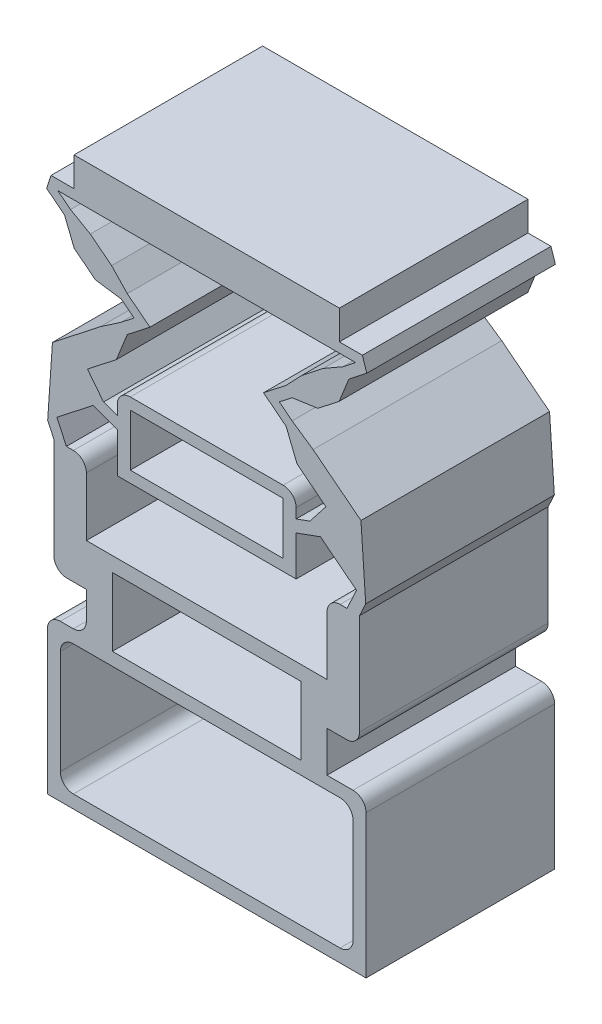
ISO-10303-21;
HEADER;
FILE_DESCRIPTION(('STEP AP214'),'2;1');
FILE_NAME('part.step','',(''),(''),'','','');
FILE_SCHEMA(('AUTOMOTIVE_DESIGN { 1 0 10303 214 1 1 1 1 }'));
ENDSEC;
DATA;
#1=APPLICATION_CONTEXT('core data for automotive mechanical design processes');
#2=APPLICATION_PROTOCOL_DEFINITION('international standard','automotive_design',2000,#1);
#3=PRODUCT_CONTEXT('',#1,'mechanical');
#4=PRODUCT('Part','Part','',(#3));
#5=PRODUCT_RELATED_PRODUCT_CATEGORY('part','',(#4));
#6=PRODUCT_DEFINITION_FORMATION('','',#4);
#7=PRODUCT_DEFINITION_CONTEXT('part definition',#1,'design');
#8=PRODUCT_DEFINITION('design','',#6,#7);
#9=PRODUCT_DEFINITION_SHAPE('','',#8);
#10=(LENGTH_UNIT() NAMED_UNIT(*) SI_UNIT(.MILLI.,.METRE.));
#11=(NAMED_UNIT(*) PLANE_ANGLE_UNIT() SI_UNIT($,.RADIAN.));
#12=(NAMED_UNIT(*) SI_UNIT($,.STERADIAN.) SOLID_ANGLE_UNIT());
#13=UNCERTAINTY_MEASURE_WITH_UNIT(LENGTH_MEASURE(1.E-05),#10,'distance_accuracy_value','');
#14=(GEOMETRIC_REPRESENTATION_CONTEXT(3) GLOBAL_UNCERTAINTY_ASSIGNED_CONTEXT((#13)) GLOBAL_UNIT_ASSIGNED_CONTEXT((#10,
#11,#12)) REPRESENTATION_CONTEXT('',''));
#15=CARTESIAN_POINT('',(0.,0.,0.));
#16=DIRECTION('',(0.,0.,1.));
#17=DIRECTION('',(1.,0.,0.));
#18=AXIS2_PLACEMENT_3D('',#15,#16,#17);
#19=CARTESIAN_POINT('',(-4.5,-5.55,-10.912378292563));
#20=DIRECTION('',(-1.,0.,0.));
#21=DIRECTION('',(0.,-1.,0.));
#22=AXIS2_PLACEMENT_3D('',#19,#20,#21);
#23=PLANE('',#22);
#24=DIRECTION('',(0.,-1.,0.));
#25=VECTOR('',#24,1.);
#26=CARTESIAN_POINT('',(-4.5,-5.55,0.3));
#27=LINE('',#26,#25);
#28=CARTESIAN_POINT('',(-4.5,-1.95,0.3));
#29=VERTEX_POINT('',#28);
#30=CARTESIAN_POINT('',(-4.5,-5.15,0.3));
#31=VERTEX_POINT('',#30);
#32=EDGE_CURVE('E53',#29,#31,#27,.T.);
#33=ORIENTED_EDGE('',*,*,#32,.F.);
#34=DIRECTION('',(0.,0.,1.));
#35=VECTOR('',#34,1.);
#36=CARTESIAN_POINT('',(-4.5,-1.95,5.8));
#37=LINE('',#36,#35);
#38=CARTESIAN_POINT('',(-4.5,-1.95,5.8));
#39=VERTEX_POINT('',#38);
#40=EDGE_CURVE('E1401',#29,#39,#37,.T.);
#41=ORIENTED_EDGE('',*,*,#40,.T.);
#42=DIRECTION('',(0.,-1.,0.));
#43=VECTOR('',#42,1.);
#44=CARTESIAN_POINT('',(-4.5,-5.55,5.8));
#45=LINE('',#44,#43);
#46=CARTESIAN_POINT('',(-4.5,-5.15,5.8));
#47=VERTEX_POINT('',#46);
#48=EDGE_CURVE('E714',#39,#47,#45,.T.);
#49=ORIENTED_EDGE('',*,*,#48,.T.);
#50=DIRECTION('',(0.,0.,1.));
#51=VECTOR('',#50,1.);
#52=CARTESIAN_POINT('',(-4.5,-5.15,0.));
#53=LINE('',#52,#51);
#54=EDGE_CURVE('E1399',#47,#31,#53,.F.);
#55=ORIENTED_EDGE('',*,*,#54,.T.);
#56=EDGE_LOOP('',(#33,#41,#49,#55));
#57=FACE_BOUND('',#56,.T.);
#58=ADVANCED_FACE('F38',(#57),#23,.F.);
#59=CARTESIAN_POINT('',(-4.5,-1.55,-10.912378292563));
#60=DIRECTION('',(0.,1.,0.));
#61=DIRECTION('',(0.,0.,1.));
#62=AXIS2_PLACEMENT_3D('',#59,#60,#61);
#63=PLANE('',#62);
#64=DIRECTION('',(-1.,0.,0.));
#65=VECTOR('',#64,1.);
#66=CARTESIAN_POINT('',(-4.5,-1.55,0.3));
#67=LINE('',#66,#65);
#68=CARTESIAN_POINT('',(4.1,-1.55,0.3));
#69=VERTEX_POINT('',#68);
#70=CARTESIAN_POINT('',(-4.1,-1.55,0.3));
#71=VERTEX_POINT('',#70);
#72=EDGE_CURVE('E691',#69,#71,#67,.T.);
#73=ORIENTED_EDGE('',*,*,#72,.F.);
#74=DIRECTION('',(0.,0.,1.));
#75=VECTOR('',#74,1.);
#76=CARTESIAN_POINT('',(4.1,-1.55,5.8));
#77=LINE('',#76,#75);
#78=CARTESIAN_POINT('',(4.1,-1.55,5.8));
#79=VERTEX_POINT('',#78);
#80=EDGE_CURVE('E1403',#69,#79,#77,.T.);
#81=ORIENTED_EDGE('',*,*,#80,.T.);
#82=DIRECTION('',(-1.,0.,0.));
#83=VECTOR('',#82,1.);
#84=CARTESIAN_POINT('',(-4.5,-1.55,5.8));
#85=LINE('',#84,#83);
#86=CARTESIAN_POINT('',(-4.1,-1.55,5.8));
#87=VERTEX_POINT('',#86);
#88=EDGE_CURVE('E710',#79,#87,#85,.T.);
#89=ORIENTED_EDGE('',*,*,#88,.T.);
#90=DIRECTION('',(0.,0.,1.));
#91=VECTOR('',#90,1.);
#92=CARTESIAN_POINT('',(-4.1,-1.55,0.));
#93=LINE('',#92,#91);
#94=EDGE_CURVE('E1405',#87,#71,#93,.F.);
#95=ORIENTED_EDGE('',*,*,#94,.T.);
#96=EDGE_LOOP('',(#73,#81,#89,#95));
#97=FACE_BOUND('',#96,.T.);
#98=ADVANCED_FACE('F1523',(#97),#63,.F.);
#99=CARTESIAN_POINT('',(4.5,-1.55,-10.912378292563));
#100=DIRECTION('',(1.,0.,0.));
#101=DIRECTION('',(0.,1.,0.));
#102=AXIS2_PLACEMENT_3D('',#99,#100,#101);
#103=PLANE('',#102);
#104=DIRECTION('',(0.,1.,0.));
#105=VECTOR('',#104,1.);
#106=CARTESIAN_POINT('',(4.5,-1.55,0.3));
#107=LINE('',#106,#105);
#108=CARTESIAN_POINT('',(4.5,-5.15,0.3));
#109=VERTEX_POINT('',#108);
#110=CARTESIAN_POINT('',(4.5,-1.95,0.3));
#111=VERTEX_POINT('',#110);
#112=EDGE_CURVE('E689',#109,#111,#107,.T.);
#113=ORIENTED_EDGE('',*,*,#112,.F.);
#114=DIRECTION('',(0.,0.,1.));
#115=VECTOR('',#114,1.);
#116=CARTESIAN_POINT('',(4.5,-5.15,5.8));
#117=LINE('',#116,#115);
#118=CARTESIAN_POINT('',(4.5,-5.15,5.8));
#119=VERTEX_POINT('',#118);
#120=EDGE_CURVE('E1407',#109,#119,#117,.T.);
#121=ORIENTED_EDGE('',*,*,#120,.T.);
#122=DIRECTION('',(0.,1.,0.));
#123=VECTOR('',#122,1.);
#124=CARTESIAN_POINT('',(4.5,-1.55,5.8));
#125=LINE('',#124,#123);
#126=CARTESIAN_POINT('',(4.5,-1.95,5.8));
#127=VERTEX_POINT('',#126);
#128=EDGE_CURVE('E713',#119,#127,#125,.T.);
#129=ORIENTED_EDGE('',*,*,#128,.T.);
#130=DIRECTION('',(0.,0.,1.));
#131=VECTOR('',#130,1.);
#132=CARTESIAN_POINT('',(4.5,-1.95,0.));
#133=LINE('',#132,#131);
#134=EDGE_CURVE('E671',#127,#111,#133,.F.);
#135=ORIENTED_EDGE('',*,*,#134,.T.);
#136=EDGE_LOOP('',(#113,#121,#129,#135));
#137=FACE_BOUND('',#136,.T.);
#138=ADVANCED_FACE('F1528',(#137),#103,.F.);
#139=CARTESIAN_POINT('',(4.5,-5.55,-10.912378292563));
#140=DIRECTION('',(0.,-1.,0.));
#141=DIRECTION('',(1.,0.,0.));
#142=AXIS2_PLACEMENT_3D('',#139,#140,#141);
#143=PLANE('',#142);
#144=DIRECTION('',(1.,0.,0.));
#145=VECTOR('',#144,1.);
#146=CARTESIAN_POINT('',(4.5,-5.55,0.3));
#147=LINE('',#146,#145);
#148=CARTESIAN_POINT('',(-4.1,-5.55,0.3));
#149=VERTEX_POINT('',#148);
#150=CARTESIAN_POINT('',(4.1,-5.55,0.3));
#151=VERTEX_POINT('',#150);
#152=EDGE_CURVE('E675',#149,#151,#147,.T.);
#153=ORIENTED_EDGE('',*,*,#152,.F.);
#154=DIRECTION('',(0.,0.,1.));
#155=VECTOR('',#154,1.);
#156=CARTESIAN_POINT('',(-4.1,-5.55,5.8));
#157=LINE('',#156,#155);
#158=CARTESIAN_POINT('',(-4.1,-5.55,5.8));
#159=VERTEX_POINT('',#158);
#160=EDGE_CURVE('E662',#149,#159,#157,.T.);
#161=ORIENTED_EDGE('',*,*,#160,.T.);
#162=DIRECTION('',(1.,0.,0.));
#163=VECTOR('',#162,1.);
#164=CARTESIAN_POINT('',(4.5,-5.55,5.8));
#165=LINE('',#164,#163);
#166=CARTESIAN_POINT('',(4.1,-5.55,5.8));
#167=VERTEX_POINT('',#166);
#168=EDGE_CURVE('E709',#159,#167,#165,.T.);
#169=ORIENTED_EDGE('',*,*,#168,.T.);
#170=DIRECTION('',(0.,0.,1.));
#171=VECTOR('',#170,1.);
#172=CARTESIAN_POINT('',(4.1,-5.55,0.));
#173=LINE('',#172,#171);
#174=EDGE_CURVE('E670',#167,#151,#173,.F.);
#175=ORIENTED_EDGE('',*,*,#174,.T.);
#176=EDGE_LOOP('',(#153,#161,#169,#175));
#177=FACE_BOUND('',#176,.T.);
#178=ADVANCED_FACE('F676',(#177),#143,.F.);
#179=CARTESIAN_POINT('',(-4.1,-1.95,-10.912378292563));
#180=DIRECTION('',(0.,0.,-1.));
#181=DIRECTION('',(-1.,0.,0.));
#182=AXIS2_PLACEMENT_3D('',#179,#180,#181);
#183=CYLINDRICAL_SURFACE('',#182,0.4);
#184=CARTESIAN_POINT('',(-4.1,-1.95,0.3));
#185=DIRECTION('',(0.,0.,-1.));
#186=DIRECTION('',(-1.,0.,0.));
#187=AXIS2_PLACEMENT_3D('',#184,#185,#186);
#188=CIRCLE('',#187,0.4);
#189=EDGE_CURVE('E60',#71,#29,#188,.F.);
#190=ORIENTED_EDGE('',*,*,#189,.F.);
#191=ORIENTED_EDGE('',*,*,#94,.F.);
#192=CARTESIAN_POINT('',(-4.1,-1.95,5.8));
#193=DIRECTION('',(0.,0.,-1.));
#194=DIRECTION('',(-1.,0.,0.));
#195=AXIS2_PLACEMENT_3D('',#192,#193,#194);
#196=CIRCLE('',#195,0.4);
#197=EDGE_CURVE('E1416',#39,#87,#196,.T.);
#198=ORIENTED_EDGE('',*,*,#197,.F.);
#199=ORIENTED_EDGE('',*,*,#40,.F.);
#200=EDGE_LOOP('',(#190,#191,#198,#199));
#201=FACE_BOUND('',#200,.T.);
#202=ADVANCED_FACE('F1898',(#201),#183,.F.);
#203=CARTESIAN_POINT('',(4.1,-1.95,-10.912378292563));
#204=DIRECTION('',(0.,0.,-1.));
#205=DIRECTION('',(-1.,0.,0.));
#206=AXIS2_PLACEMENT_3D('',#203,#204,#205);
#207=CYLINDRICAL_SURFACE('',#206,0.4);
#208=CARTESIAN_POINT('',(4.1,-1.95,0.3));
#209=DIRECTION('',(0.,0.,-1.));
#210=DIRECTION('',(-1.,0.,0.));
#211=AXIS2_PLACEMENT_3D('',#208,#209,#210);
#212=CIRCLE('',#211,0.4);
#213=EDGE_CURVE('E693',#111,#69,#212,.F.);
#214=ORIENTED_EDGE('',*,*,#213,.F.);
#215=ORIENTED_EDGE('',*,*,#134,.F.);
#216=CARTESIAN_POINT('',(4.1,-1.95,5.8));
#217=DIRECTION('',(0.,0.,-1.));
#218=DIRECTION('',(-1.,0.,0.));
#219=AXIS2_PLACEMENT_3D('',#216,#217,#218);
#220=CIRCLE('',#219,0.4);
#221=EDGE_CURVE('E1418',#79,#127,#220,.T.);
#222=ORIENTED_EDGE('',*,*,#221,.F.);
#223=ORIENTED_EDGE('',*,*,#80,.F.);
#224=EDGE_LOOP('',(#214,#215,#222,#223));
#225=FACE_BOUND('',#224,.T.);
#226=ADVANCED_FACE('F1901',(#225),#207,.F.);
#227=CARTESIAN_POINT('',(4.1,-5.15,-10.912378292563));
#228=DIRECTION('',(0.,0.,-1.));
#229=DIRECTION('',(-1.,0.,0.));
#230=AXIS2_PLACEMENT_3D('',#227,#228,#229);
#231=CYLINDRICAL_SURFACE('',#230,0.4);
#232=CARTESIAN_POINT('',(4.1,-5.15,0.3));
#233=DIRECTION('',(0.,0.,-1.));
#234=DIRECTION('',(-1.,0.,0.));
#235=AXIS2_PLACEMENT_3D('',#232,#233,#234);
#236=CIRCLE('',#235,0.4);
#237=EDGE_CURVE('E684',#151,#109,#236,.F.);
#238=ORIENTED_EDGE('',*,*,#237,.F.);
#239=ORIENTED_EDGE('',*,*,#174,.F.);
#240=CARTESIAN_POINT('',(4.1,-5.15,5.8));
#241=DIRECTION('',(0.,0.,-1.));
#242=DIRECTION('',(-1.,0.,0.));
#243=AXIS2_PLACEMENT_3D('',#240,#241,#242);
#244=CIRCLE('',#243,0.4);
#245=EDGE_CURVE('E1420',#119,#167,#244,.T.);
#246=ORIENTED_EDGE('',*,*,#245,.F.);
#247=ORIENTED_EDGE('',*,*,#120,.F.);
#248=EDGE_LOOP('',(#238,#239,#246,#247));
#249=FACE_BOUND('',#248,.T.);
#250=ADVANCED_FACE('F1904',(#249),#231,.F.);
#251=CARTESIAN_POINT('',(-4.1,-5.15,-10.912378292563));
#252=DIRECTION('',(0.,0.,-1.));
#253=DIRECTION('',(-1.,0.,0.));
#254=AXIS2_PLACEMENT_3D('',#251,#252,#253);
#255=CYLINDRICAL_SURFACE('',#254,0.4);
#256=CARTESIAN_POINT('',(-4.1,-5.15,0.3));
#257=DIRECTION('',(0.,0.,-1.));
#258=DIRECTION('',(-1.,0.,0.));
#259=AXIS2_PLACEMENT_3D('',#256,#257,#258);
#260=CIRCLE('',#259,0.4);
#261=EDGE_CURVE('E11',#31,#149,#260,.F.);
#262=ORIENTED_EDGE('',*,*,#261,.F.);
#263=ORIENTED_EDGE('',*,*,#54,.F.);
#264=CARTESIAN_POINT('',(-4.1,-5.15,5.8));
#265=DIRECTION('',(0.,0.,-1.));
#266=DIRECTION('',(-1.,0.,0.));
#267=AXIS2_PLACEMENT_3D('',#264,#265,#266);
#268=CIRCLE('',#267,0.4);
#269=EDGE_CURVE('E666',#159,#47,#268,.T.);
#270=ORIENTED_EDGE('',*,*,#269,.F.);
#271=ORIENTED_EDGE('',*,*,#160,.F.);
#272=EDGE_LOOP('',(#262,#263,#270,#271));
#273=FACE_BOUND('',#272,.T.);
#274=ADVANCED_FACE('F664',(#273),#255,.F.);
#275=CARTESIAN_POINT('',(3.7,1.4,5.8));
#276=DIRECTION('',(1.,0.,0.));
#277=DIRECTION('',(0.,0.,-1.));
#278=AXIS2_PLACEMENT_3D('',#275,#276,#277);
#279=PLANE('',#278);
#280=DIRECTION('',(0.,-1.,0.));
#281=VECTOR('',#280,1.);
#282=CARTESIAN_POINT('',(3.7,1.4,5.8));
#283=LINE('',#282,#281);
#284=CARTESIAN_POINT('',(3.7,3.2,5.8));
#285=VERTEX_POINT('',#284);
#286=CARTESIAN_POINT('',(3.7,1.4,5.8));
#287=VERTEX_POINT('',#286);
#288=EDGE_CURVE('E1224',#285,#287,#283,.T.);
#289=ORIENTED_EDGE('',*,*,#288,.F.);
#290=DIRECTION('',(0.,0.,-1.));
#291=VECTOR('',#290,1.);
#292=CARTESIAN_POINT('',(3.7,3.2,5.8));
#293=LINE('',#292,#291);
#294=CARTESIAN_POINT('',(3.7,3.2,0.));
#295=VERTEX_POINT('',#294);
#296=EDGE_CURVE('E1436',#285,#295,#293,.T.);
#297=ORIENTED_EDGE('',*,*,#296,.T.);
#298=DIRECTION('',(0.,-1.,0.));
#299=VECTOR('',#298,1.);
#300=CARTESIAN_POINT('',(3.7,1.4,0.));
#301=LINE('',#300,#299);
#302=CARTESIAN_POINT('',(3.7,1.4,0.));
#303=VERTEX_POINT('',#302);
#304=EDGE_CURVE('E1223',#295,#303,#301,.T.);
#305=ORIENTED_EDGE('',*,*,#304,.T.);
#306=DIRECTION('',(0.,0.,-1.));
#307=VECTOR('',#306,1.);
#308=CARTESIAN_POINT('',(3.7,1.4,5.8));
#309=LINE('',#308,#307);
#310=EDGE_CURVE('E1335',#287,#303,#309,.T.);
#311=ORIENTED_EDGE('',*,*,#310,.F.);
#312=EDGE_LOOP('',(#289,#297,#305,#311));
#313=FACE_BOUND('',#312,.T.);
#314=ADVANCED_FACE('F1455',(#313),#279,.F.);
#315=CARTESIAN_POINT('',(-3.7,1.4,5.8));
#316=DIRECTION('',(0.,-1.,0.));
#317=DIRECTION('',(1.,0.,0.));
#318=AXIS2_PLACEMENT_3D('',#315,#316,#317);
#319=PLANE('',#318);
#320=DIRECTION('',(-1.,0.,0.));
#321=VECTOR('',#320,1.);
#322=CARTESIAN_POINT('',(-3.7,1.4,0.));
#323=LINE('',#322,#321);
#324=CARTESIAN_POINT('',(-3.7,1.4,0.));
#325=VERTEX_POINT('',#324);
#326=EDGE_CURVE('E1264',#303,#325,#323,.T.);
#327=ORIENTED_EDGE('',*,*,#326,.T.);
#328=DIRECTION('',(0.,0.,-1.));
#329=VECTOR('',#328,1.);
#330=CARTESIAN_POINT('',(-3.7,1.4,5.8));
#331=LINE('',#330,#329);
#332=CARTESIAN_POINT('',(-3.7,1.4,5.8));
#333=VERTEX_POINT('',#332);
#334=EDGE_CURVE('E1332',#333,#325,#331,.T.);
#335=ORIENTED_EDGE('',*,*,#334,.F.);
#336=DIRECTION('',(-1.,0.,0.));
#337=VECTOR('',#336,1.);
#338=CARTESIAN_POINT('',(-3.7,1.4,5.8));
#339=LINE('',#338,#337);
#340=EDGE_CURVE('E1226',#287,#333,#339,.T.);
#341=ORIENTED_EDGE('',*,*,#340,.F.);
#342=ORIENTED_EDGE('',*,*,#310,.T.);
#343=EDGE_LOOP('',(#327,#335,#341,#342));
#344=FACE_BOUND('',#343,.T.);
#345=ADVANCED_FACE('F1464',(#344),#319,.F.);
#346=CARTESIAN_POINT('',(-3.7,-1.4,5.8));
#347=DIRECTION('',(1.,0.,0.));
#348=DIRECTION('',(0.,0.,-1.));
#349=AXIS2_PLACEMENT_3D('',#346,#347,#348);
#350=PLANE('',#349);
#351=DIRECTION('',(0.,-1.,0.));
#352=VECTOR('',#351,1.);
#353=CARTESIAN_POINT('',(-3.7,-1.4,0.));
#354=LINE('',#353,#352);
#355=CARTESIAN_POINT('',(-3.7,0.100000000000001,0.));
#356=VERTEX_POINT('',#355);
#357=CARTESIAN_POINT('',(-3.7,-0.75,0.));
#358=VERTEX_POINT('',#357);
#359=EDGE_CURVE('E1267',#356,#358,#354,.T.);
#360=ORIENTED_EDGE('',*,*,#359,.T.);
#361=DIRECTION('',(0.,0.,1.));
#362=VECTOR('',#361,1.);
#363=CARTESIAN_POINT('',(-3.7,-0.75,5.8));
#364=LINE('',#363,#362);
#365=CARTESIAN_POINT('',(-3.7,-0.75,5.8));
#366=VERTEX_POINT('',#365);
#367=EDGE_CURVE('E1384',#358,#366,#364,.T.);
#368=ORIENTED_EDGE('',*,*,#367,.T.);
#369=DIRECTION('',(0.,-1.,0.));
#370=VECTOR('',#369,1.);
#371=CARTESIAN_POINT('',(-3.7,-1.4,5.8));
#372=LINE('',#371,#370);
#373=CARTESIAN_POINT('',(-3.7,0.100000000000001,5.8));
#374=VERTEX_POINT('',#373);
#375=EDGE_CURVE('E1230',#374,#366,#372,.T.);
#376=ORIENTED_EDGE('',*,*,#375,.F.);
#377=DIRECTION('',(0.,0.,-1.));
#378=VECTOR('',#377,1.);
#379=CARTESIAN_POINT('',(-3.7,0.100000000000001,5.8));
#380=LINE('',#379,#378);
#381=EDGE_CURVE('E1177',#374,#356,#380,.T.);
#382=ORIENTED_EDGE('',*,*,#381,.T.);
#383=EDGE_LOOP('',(#360,#368,#376,#382));
#384=FACE_BOUND('',#383,.T.);
#385=ADVANCED_FACE('F1985',(#384),#350,.F.);
#386=CARTESIAN_POINT('',(3.7,-1.4,5.8));
#387=DIRECTION('',(-1.,0.,0.));
#388=DIRECTION('',(0.,0.,1.));
#389=AXIS2_PLACEMENT_3D('',#386,#387,#388);
#390=PLANE('',#389);
#391=DIRECTION('',(0.,1.,0.));
#392=VECTOR('',#391,1.);
#393=CARTESIAN_POINT('',(3.7,-1.4,5.8));
#394=LINE('',#393,#392);
#395=CARTESIAN_POINT('',(3.7,-1.15,5.8));
#396=VERTEX_POINT('',#395);
#397=CARTESIAN_POINT('',(3.7,0.100000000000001,5.8));
#398=VERTEX_POINT('',#397);
#399=EDGE_CURVE('E1233',#396,#398,#394,.T.);
#400=ORIENTED_EDGE('',*,*,#399,.F.);
#401=DIRECTION('',(0.,0.,-1.));
#402=VECTOR('',#401,1.);
#403=CARTESIAN_POINT('',(3.7,-1.15,5.8));
#404=LINE('',#403,#402);
#405=CARTESIAN_POINT('',(3.7,-1.15,0.));
#406=VERTEX_POINT('',#405);
#407=EDGE_CURVE('E699',#396,#406,#404,.T.);
#408=ORIENTED_EDGE('',*,*,#407,.T.);
#409=DIRECTION('',(0.,1.,0.));
#410=VECTOR('',#409,1.);
#411=CARTESIAN_POINT('',(3.7,-1.4,0.));
#412=LINE('',#411,#410);
#413=CARTESIAN_POINT('',(3.7,0.100000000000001,0.));
#414=VERTEX_POINT('',#413);
#415=EDGE_CURVE('E1270',#406,#414,#412,.T.);
#416=ORIENTED_EDGE('',*,*,#415,.T.);
#417=DIRECTION('',(0.,0.,-1.));
#418=VECTOR('',#417,1.);
#419=CARTESIAN_POINT('',(3.7,0.100000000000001,5.8));
#420=LINE('',#419,#418);
#421=EDGE_CURVE('E1329',#398,#414,#420,.T.);
#422=ORIENTED_EDGE('',*,*,#421,.F.);
#423=EDGE_LOOP('',(#400,#408,#416,#422));
#424=FACE_BOUND('',#423,.T.);
#425=ADVANCED_FACE('F1993',(#424),#390,.F.);
#426=CARTESIAN_POINT('',(3.7,0.100000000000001,5.8));
#427=DIRECTION('',(0.,1.,0.));
#428=DIRECTION('',(0.,0.,1.));
#429=AXIS2_PLACEMENT_3D('',#426,#427,#428);
#430=PLANE('',#429);
#431=DIRECTION('',(1.,0.,0.));
#432=VECTOR('',#431,1.);
#433=CARTESIAN_POINT('',(3.7,0.100000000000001,0.));
#434=LINE('',#433,#432);
#435=CARTESIAN_POINT('',(4.3,0.100000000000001,0.));
#436=VERTEX_POINT('',#435);
#437=EDGE_CURVE('E1272',#414,#436,#434,.T.);
#438=ORIENTED_EDGE('',*,*,#437,.T.);
#439=DIRECTION('',(0.,0.,-1.));
#440=VECTOR('',#439,1.);
#441=CARTESIAN_POINT('',(4.3,0.100000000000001,5.8));
#442=LINE('',#441,#440);
#443=CARTESIAN_POINT('',(4.3,0.100000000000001,5.8));
#444=VERTEX_POINT('',#443);
#445=EDGE_CURVE('E1369',#436,#444,#442,.F.);
#446=ORIENTED_EDGE('',*,*,#445,.T.);
#447=DIRECTION('',(1.,0.,0.));
#448=VECTOR('',#447,1.);
#449=CARTESIAN_POINT('',(3.7,0.100000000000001,5.8));
#450=LINE('',#449,#448);
#451=EDGE_CURVE('E1235',#398,#444,#450,.T.);
#452=ORIENTED_EDGE('',*,*,#451,.F.);
#453=ORIENTED_EDGE('',*,*,#421,.T.);
#454=EDGE_LOOP('',(#438,#446,#452,#453));
#455=FACE_BOUND('',#454,.T.);
#456=ADVANCED_FACE('F2003',(#455),#430,.F.);
#457=CARTESIAN_POINT('',(4.7,3.6,5.8));
#458=DIRECTION('',(-1.,0.,0.));
#459=DIRECTION('',(0.,0.,1.));
#460=AXIS2_PLACEMENT_3D('',#457,#458,#459);
#461=PLANE('',#460);
#462=DIRECTION('',(0.,1.,0.));
#463=VECTOR('',#462,1.);
#464=CARTESIAN_POINT('',(4.7,3.6,5.8));
#465=LINE('',#464,#463);
#466=CARTESIAN_POINT('',(4.7,0.500000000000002,5.8));
#467=VERTEX_POINT('',#466);
#468=CARTESIAN_POINT('',(4.7,3.6,5.8));
#469=VERTEX_POINT('',#468);
#470=EDGE_CURVE('E1238',#467,#469,#465,.T.);
#471=ORIENTED_EDGE('',*,*,#470,.F.);
#472=DIRECTION('',(0.,0.,-1.));
#473=VECTOR('',#472,1.);
#474=CARTESIAN_POINT('',(4.7,0.500000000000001,5.8));
#475=LINE('',#474,#473);
#476=CARTESIAN_POINT('',(4.7,0.500000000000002,0.));
#477=VERTEX_POINT('',#476);
#478=EDGE_CURVE('E1358',#467,#477,#475,.T.);
#479=ORIENTED_EDGE('',*,*,#478,.T.);
#480=DIRECTION('',(0.,1.,0.));
#481=VECTOR('',#480,1.);
#482=CARTESIAN_POINT('',(4.7,3.6,0.));
#483=LINE('',#482,#481);
#484=CARTESIAN_POINT('',(4.7,3.6,0.));
#485=VERTEX_POINT('',#484);
#486=EDGE_CURVE('E1275',#477,#485,#483,.T.);
#487=ORIENTED_EDGE('',*,*,#486,.T.);
#488=DIRECTION('',(0.,0.,-1.));
#489=VECTOR('',#488,1.);
#490=CARTESIAN_POINT('',(4.7,3.6,5.8));
#491=LINE('',#490,#489);
#492=EDGE_CURVE('E1326',#469,#485,#491,.T.);
#493=ORIENTED_EDGE('',*,*,#492,.F.);
#494=EDGE_LOOP('',(#471,#479,#487,#493));
#495=FACE_BOUND('',#494,.T.);
#496=ADVANCED_FACE('F2011',(#495),#461,.F.);
#497=CARTESIAN_POINT('',(4.7,3.6,5.8));
#498=DIRECTION('',(-0.906307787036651,0.422618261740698,0.));
#499=DIRECTION('',(-0.422618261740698,-0.906307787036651,0.));
#500=AXIS2_PLACEMENT_3D('',#497,#498,#499);
#501=PLANE('',#500);
#502=DIRECTION('',(0.422618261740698,0.906307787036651,0.));
#503=VECTOR('',#502,1.);
#504=CARTESIAN_POINT('',(4.7,3.6,0.));
#505=LINE('',#504,#503);
#506=CARTESIAN_POINT('',(4.89017821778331,4.00783850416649,0.));
#507=VERTEX_POINT('',#506);
#508=EDGE_CURVE('E1277',#485,#507,#505,.T.);
#509=ORIENTED_EDGE('',*,*,#508,.T.);
#510=DIRECTION('',(0.,0.,-1.));
#511=VECTOR('',#510,1.);
#512=CARTESIAN_POINT('',(4.89017821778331,4.00783850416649,5.8));
#513=LINE('',#512,#511);
#514=CARTESIAN_POINT('',(4.89017821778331,4.00783850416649,5.8));
#515=VERTEX_POINT('',#514);
#516=EDGE_CURVE('E1324',#515,#507,#513,.T.);
#517=ORIENTED_EDGE('',*,*,#516,.F.);
#518=DIRECTION('',(0.422618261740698,0.906307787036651,0.));
#519=VECTOR('',#518,1.);
#520=CARTESIAN_POINT('',(4.7,3.6,5.8));
#521=LINE('',#520,#519);
#522=EDGE_CURVE('E1240',#469,#515,#521,.T.);
#523=ORIENTED_EDGE('',*,*,#522,.F.);
#524=ORIENTED_EDGE('',*,*,#492,.T.);
#525=EDGE_LOOP('',(#509,#517,#523,#524));
#526=FACE_BOUND('',#525,.T.);
#527=ADVANCED_FACE('F2019',(#526),#501,.F.);
#528=CARTESIAN_POINT('',(4.03652212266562,6.45576687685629,5.8));
#529=DIRECTION('',(0.787041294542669,-0.616900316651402,0.));
#530=DIRECTION('',(0.616900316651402,0.787041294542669,0.));
#531=AXIS2_PLACEMENT_3D('',#528,#529,#530);
#532=PLANE('',#531);
#533=DIRECTION('',(-0.616900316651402,-0.787041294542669,0.));
#534=VECTOR('',#533,1.);
#535=CARTESIAN_POINT('',(4.03652212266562,6.45576687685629,5.8));
#536=LINE('',#535,#534);
#537=CARTESIAN_POINT('',(3.66638193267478,5.98354210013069,5.8));
#538=VERTEX_POINT('',#537);
#539=CARTESIAN_POINT('',(3.17286167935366,5.35390906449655,5.8));
#540=VERTEX_POINT('',#539);
#541=EDGE_CURVE('E1243',#538,#540,#536,.T.);
#542=ORIENTED_EDGE('',*,*,#541,.F.);
#543=DIRECTION('',(0.,0.,1.));
#544=VECTOR('',#543,1.);
#545=CARTESIAN_POINT('',(3.66638193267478,5.98354210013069,-11.3235771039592));
#546=LINE('',#545,#544);
#547=CARTESIAN_POINT('',(3.66638193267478,5.98354210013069,0.));
#548=VERTEX_POINT('',#547);
#549=EDGE_CURVE('E956',#548,#538,#546,.T.);
#550=ORIENTED_EDGE('',*,*,#549,.F.);
#551=DIRECTION('',(-0.616900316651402,-0.787041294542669,0.));
#552=VECTOR('',#551,1.);
#553=CARTESIAN_POINT('',(4.03652212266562,6.45576687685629,0.));
#554=LINE('',#553,#552);
#555=CARTESIAN_POINT('',(3.17286167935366,5.35390906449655,0.));
#556=VERTEX_POINT('',#555);
#557=EDGE_CURVE('E1280',#548,#556,#554,.T.);
#558=ORIENTED_EDGE('',*,*,#557,.T.);
#559=DIRECTION('',(0.,0.,-1.));
#560=VECTOR('',#559,1.);
#561=CARTESIAN_POINT('',(3.17286167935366,5.35390906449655,5.8));
#562=LINE('',#561,#560);
#563=EDGE_CURVE('E1321',#540,#556,#562,.T.);
#564=ORIENTED_EDGE('',*,*,#563,.F.);
#565=EDGE_LOOP('',(#542,#550,#558,#564));
#566=FACE_BOUND('',#565,.T.);
#567=ADVANCED_FACE('F1811',(#566),#532,.F.);
#568=CARTESIAN_POINT('',(2.75,5.2,5.8));
#569=DIRECTION('',(0.342020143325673,-0.939692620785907,0.));
#570=DIRECTION('',(0.939692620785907,0.342020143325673,0.));
#571=AXIS2_PLACEMENT_3D('',#568,#569,#570);
#572=PLANE('',#571);
#573=DIRECTION('',(-0.939692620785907,-0.342020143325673,0.));
#574=VECTOR('',#573,1.);
#575=CARTESIAN_POINT('',(2.75,5.2,0.));
#576=LINE('',#575,#574);
#577=CARTESIAN_POINT('',(2.75,5.2,0.));
#578=VERTEX_POINT('',#577);
#579=EDGE_CURVE('E1282',#556,#578,#576,.T.);
#580=ORIENTED_EDGE('',*,*,#579,.T.);
#581=DIRECTION('',(0.,0.,-1.));
#582=VECTOR('',#581,1.);
#583=CARTESIAN_POINT('',(2.75,5.2,5.8));
#584=LINE('',#583,#582);
#585=CARTESIAN_POINT('',(2.75,5.2,5.8));
#586=VERTEX_POINT('',#585);
#587=EDGE_CURVE('E1318',#586,#578,#584,.T.);
#588=ORIENTED_EDGE('',*,*,#587,.F.);
#589=DIRECTION('',(-0.939692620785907,-0.342020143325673,0.));
#590=VECTOR('',#589,1.);
#591=CARTESIAN_POINT('',(2.75,5.2,5.8));
#592=LINE('',#591,#590);
#593=EDGE_CURVE('E1245',#540,#586,#592,.T.);
#594=ORIENTED_EDGE('',*,*,#593,.F.);
#595=ORIENTED_EDGE('',*,*,#563,.T.);
#596=EDGE_LOOP('',(#580,#588,#594,#595));
#597=FACE_BOUND('',#596,.T.);
#598=ADVANCED_FACE('F1814',(#597),#572,.F.);
#599=CARTESIAN_POINT('',(-2.75,5.2,5.8));
#600=DIRECTION('',(1.,0.,0.));
#601=DIRECTION('',(0.,1.,0.));
#602=AXIS2_PLACEMENT_3D('',#599,#600,#601);
#603=PLANE('',#602);
#604=DIRECTION('',(0.,-1.,0.));
#605=VECTOR('',#604,1.);
#606=CARTESIAN_POINT('',(-2.75,5.2,5.8));
#607=LINE('',#606,#605);
#608=CARTESIAN_POINT('',(-2.75,4.82753777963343,5.8));
#609=VERTEX_POINT('',#608);
#610=CARTESIAN_POINT('',(-2.75,3.6,5.8));
#611=VERTEX_POINT('',#610);
#612=EDGE_CURVE('E1247',#609,#611,#607,.T.);
#613=ORIENTED_EDGE('',*,*,#612,.F.);
#614=DIRECTION('',(0.,0.,-1.));
#615=VECTOR('',#614,1.);
#616=CARTESIAN_POINT('',(-2.75,4.82753777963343,5.8));
#617=LINE('',#616,#615);
#618=CARTESIAN_POINT('',(-2.75,4.82753777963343,0.));
#619=VERTEX_POINT('',#618);
#620=EDGE_CURVE('E1214',#609,#619,#617,.T.);
#621=ORIENTED_EDGE('',*,*,#620,.T.);
#622=DIRECTION('',(0.,-1.,0.));
#623=VECTOR('',#622,1.);
#624=CARTESIAN_POINT('',(-2.75,5.2,0.));
#625=LINE('',#624,#623);
#626=CARTESIAN_POINT('',(-2.75,3.6,0.));
#627=VERTEX_POINT('',#626);
#628=EDGE_CURVE('E1284',#619,#627,#625,.T.);
#629=ORIENTED_EDGE('',*,*,#628,.T.);
#630=DIRECTION('',(0.,0.,-1.));
#631=VECTOR('',#630,1.);
#632=CARTESIAN_POINT('',(-2.75,3.6,5.8));
#633=LINE('',#632,#631);
#634=EDGE_CURVE('E1312',#611,#627,#633,.T.);
#635=ORIENTED_EDGE('',*,*,#634,.F.);
#636=EDGE_LOOP('',(#613,#621,#629,#635));
#637=FACE_BOUND('',#636,.T.);
#638=ADVANCED_FACE('F1492',(#637),#603,.F.);
#639=CARTESIAN_POINT('',(-2.75,3.6,5.8));
#640=DIRECTION('',(0.,1.,0.));
#641=DIRECTION('',(0.,0.,1.));
#642=AXIS2_PLACEMENT_3D('',#639,#640,#641);
#643=PLANE('',#642);
#644=DIRECTION('',(1.,0.,0.));
#645=VECTOR('',#644,1.);
#646=CARTESIAN_POINT('',(-2.75,3.6,0.));
#647=LINE('',#646,#645);
#648=CARTESIAN_POINT('',(2.75,3.6,0.));
#649=VERTEX_POINT('',#648);
#650=EDGE_CURVE('E1286',#627,#649,#647,.T.);
#651=ORIENTED_EDGE('',*,*,#650,.T.);
#652=DIRECTION('',(0.,0.,-1.));
#653=VECTOR('',#652,1.);
#654=CARTESIAN_POINT('',(2.75,3.6,5.8));
#655=LINE('',#654,#653);
#656=CARTESIAN_POINT('',(2.75,3.6,5.8));
#657=VERTEX_POINT('',#656);
#658=EDGE_CURVE('E1309',#657,#649,#655,.T.);
#659=ORIENTED_EDGE('',*,*,#658,.F.);
#660=DIRECTION('',(1.,0.,0.));
#661=VECTOR('',#660,1.);
#662=CARTESIAN_POINT('',(-2.75,3.6,5.8));
#663=LINE('',#662,#661);
#664=EDGE_CURVE('E1249',#611,#657,#663,.T.);
#665=ORIENTED_EDGE('',*,*,#664,.F.);
#666=ORIENTED_EDGE('',*,*,#634,.T.);
#667=EDGE_LOOP('',(#651,#659,#665,#666));
#668=FACE_BOUND('',#667,.T.);
#669=ADVANCED_FACE('F1495',(#668),#643,.F.);
#670=CARTESIAN_POINT('',(2.75,4.82753777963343,5.8));
#671=DIRECTION('',(-1.,0.,0.));
#672=DIRECTION('',(0.,0.,1.));
#673=AXIS2_PLACEMENT_3D('',#670,#671,#672);
#674=PLANE('',#673);
#675=DIRECTION('',(0.,1.,0.));
#676=VECTOR('',#675,1.);
#677=CARTESIAN_POINT('',(2.75,4.82753777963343,0.));
#678=LINE('',#677,#676);
#679=CARTESIAN_POINT('',(2.75,4.82753777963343,0.));
#680=VERTEX_POINT('',#679);
#681=EDGE_CURVE('E1288',#649,#680,#678,.T.);
#682=ORIENTED_EDGE('',*,*,#681,.T.);
#683=DIRECTION('',(0.,0.,-1.));
#684=VECTOR('',#683,1.);
#685=CARTESIAN_POINT('',(2.75,4.82753777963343,5.8));
#686=LINE('',#685,#684);
#687=CARTESIAN_POINT('',(2.75,4.82753777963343,5.8));
#688=VERTEX_POINT('',#687);
#689=EDGE_CURVE('E1306',#688,#680,#686,.T.);
#690=ORIENTED_EDGE('',*,*,#689,.F.);
#691=DIRECTION('',(0.,1.,0.));
#692=VECTOR('',#691,1.);
#693=CARTESIAN_POINT('',(2.75,4.82753777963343,5.8));
#694=LINE('',#693,#692);
#695=EDGE_CURVE('E1251',#657,#688,#694,.T.);
#696=ORIENTED_EDGE('',*,*,#695,.F.);
#697=ORIENTED_EDGE('',*,*,#658,.T.);
#698=EDGE_LOOP('',(#682,#690,#696,#697));
#699=FACE_BOUND('',#698,.T.);
#700=ADVANCED_FACE('F1500',(#699),#674,.F.);
#701=CARTESIAN_POINT('',(2.75,4.82753777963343,5.8));
#702=DIRECTION('',(-0.342020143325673,0.939692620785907,0.));
#703=DIRECTION('',(-0.939692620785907,-0.342020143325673,0.));
#704=AXIS2_PLACEMENT_3D('',#701,#702,#703);
#705=PLANE('',#704);
#706=DIRECTION('',(0.939692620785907,0.342020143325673,0.));
#707=VECTOR('',#706,1.);
#708=CARTESIAN_POINT('',(2.75,4.82753777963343,0.));
#709=LINE('',#708,#707);
#710=CARTESIAN_POINT('',(3.49736483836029,5.09955633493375,0.));
#711=VERTEX_POINT('',#710);
#712=EDGE_CURVE('E1290',#680,#711,#709,.T.);
#713=ORIENTED_EDGE('',*,*,#712,.T.);
#714=DIRECTION('',(0.,0.,-1.));
#715=VECTOR('',#714,1.);
#716=CARTESIAN_POINT('',(3.49736483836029,5.09955633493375,5.8));
#717=LINE('',#716,#715);
#718=CARTESIAN_POINT('',(3.49736483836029,5.09955633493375,5.8));
#719=VERTEX_POINT('',#718);
#720=EDGE_CURVE('E1303',#719,#711,#717,.T.);
#721=ORIENTED_EDGE('',*,*,#720,.F.);
#722=DIRECTION('',(0.939692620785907,0.342020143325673,0.));
#723=VECTOR('',#722,1.);
#724=CARTESIAN_POINT('',(2.75,4.82753777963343,5.8));
#725=LINE('',#724,#723);
#726=EDGE_CURVE('E1253',#688,#719,#725,.T.);
#727=ORIENTED_EDGE('',*,*,#726,.F.);
#728=ORIENTED_EDGE('',*,*,#689,.T.);
#729=EDGE_LOOP('',(#713,#721,#727,#728));
#730=FACE_BOUND('',#729,.T.);
#731=ADVANCED_FACE('F1506',(#730),#705,.F.);
#732=CARTESIAN_POINT('',(3.49736483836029,5.09955633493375,5.8));
#733=DIRECTION('',(0.616900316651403,0.787041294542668,0.));
#734=DIRECTION('',(-0.787041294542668,0.616900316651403,0.));
#735=AXIS2_PLACEMENT_3D('',#732,#733,#734);
#736=PLANE('',#735);
#737=DIRECTION('',(0.787041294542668,-0.616900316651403,0.));
#738=VECTOR('',#737,1.);
#739=CARTESIAN_POINT('',(3.49736483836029,5.09955633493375,0.));
#740=LINE('',#739,#738);
#741=CARTESIAN_POINT('',(4.60736485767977,4.22951385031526,0.));
#742=VERTEX_POINT('',#741);
#743=EDGE_CURVE('E1292',#711,#742,#740,.T.);
#744=ORIENTED_EDGE('',*,*,#743,.T.);
#745=DIRECTION('',(0.,0.,-1.));
#746=VECTOR('',#745,1.);
#747=CARTESIAN_POINT('',(4.60736485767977,4.22951385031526,5.8));
#748=LINE('',#747,#746);
#749=CARTESIAN_POINT('',(4.60736485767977,4.22951385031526,5.8));
#750=VERTEX_POINT('',#749);
#751=EDGE_CURVE('E1300',#750,#742,#748,.T.);
#752=ORIENTED_EDGE('',*,*,#751,.F.);
#753=DIRECTION('',(0.787041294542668,-0.616900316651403,0.));
#754=VECTOR('',#753,1.);
#755=CARTESIAN_POINT('',(3.49736483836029,5.09955633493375,5.8));
#756=LINE('',#755,#754);
#757=EDGE_CURVE('E1255',#719,#750,#756,.T.);
#758=ORIENTED_EDGE('',*,*,#757,.F.);
#759=ORIENTED_EDGE('',*,*,#720,.T.);
#760=EDGE_LOOP('',(#744,#752,#758,#759));
#761=FACE_BOUND('',#760,.T.);
#762=ADVANCED_FACE('F1510',(#761),#736,.F.);
#763=CARTESIAN_POINT('',(4.31381772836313,3.6,5.8));
#764=DIRECTION('',(0.906307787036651,-0.422618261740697,0.));
#765=DIRECTION('',(0.422618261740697,0.906307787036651,0.));
#766=AXIS2_PLACEMENT_3D('',#763,#764,#765);
#767=PLANE('',#766);
#768=DIRECTION('',(-0.422618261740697,-0.906307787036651,0.));
#769=VECTOR('',#768,1.);
#770=CARTESIAN_POINT('',(4.31381772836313,3.6,0.));
#771=LINE('',#770,#769);
#772=CARTESIAN_POINT('',(4.31381772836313,3.6,0.));
#773=VERTEX_POINT('',#772);
#774=EDGE_CURVE('E1294',#742,#773,#771,.T.);
#775=ORIENTED_EDGE('',*,*,#774,.T.);
#776=DIRECTION('',(0.,0.,-1.));
#777=VECTOR('',#776,1.);
#778=CARTESIAN_POINT('',(4.31381772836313,3.6,5.8));
#779=LINE('',#778,#777);
#780=CARTESIAN_POINT('',(4.31381772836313,3.6,5.8));
#781=VERTEX_POINT('',#780);
#782=EDGE_CURVE('E1262',#781,#773,#779,.T.);
#783=ORIENTED_EDGE('',*,*,#782,.F.);
#784=DIRECTION('',(-0.422618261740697,-0.906307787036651,0.));
#785=VECTOR('',#784,1.);
#786=CARTESIAN_POINT('',(4.31381772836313,3.6,5.8));
#787=LINE('',#786,#785);
#788=EDGE_CURVE('E1257',#750,#781,#787,.T.);
#789=ORIENTED_EDGE('',*,*,#788,.F.);
#790=ORIENTED_EDGE('',*,*,#751,.T.);
#791=EDGE_LOOP('',(#775,#783,#789,#790));
#792=FACE_BOUND('',#791,.T.);
#793=ADVANCED_FACE('F1513',(#792),#767,.F.);
#794=CARTESIAN_POINT('',(3.7,3.6,5.8));
#795=DIRECTION('',(0.,-1.,0.));
#796=DIRECTION('',(0.,0.,-1.));
#797=AXIS2_PLACEMENT_3D('',#794,#795,#796);
#798=PLANE('',#797);
#799=DIRECTION('',(-1.,0.,0.));
#800=VECTOR('',#799,1.);
#801=CARTESIAN_POINT('',(3.7,3.6,0.));
#802=LINE('',#801,#800);
#803=CARTESIAN_POINT('',(4.1,3.6,0.));
#804=VERTEX_POINT('',#803);
#805=EDGE_CURVE('E1227',#773,#804,#802,.T.);
#806=ORIENTED_EDGE('',*,*,#805,.T.);
#807=DIRECTION('',(0.,0.,-1.));
#808=VECTOR('',#807,1.);
#809=CARTESIAN_POINT('',(4.1,3.6,5.8));
#810=LINE('',#809,#808);
#811=CARTESIAN_POINT('',(4.1,3.6,5.8));
#812=VERTEX_POINT('',#811);
#813=EDGE_CURVE('E46',#804,#812,#810,.F.);
#814=ORIENTED_EDGE('',*,*,#813,.T.);
#815=DIRECTION('',(-1.,0.,0.));
#816=VECTOR('',#815,1.);
#817=CARTESIAN_POINT('',(3.7,3.6,5.8));
#818=LINE('',#817,#816);
#819=EDGE_CURVE('E1259',#781,#812,#818,.T.);
#820=ORIENTED_EDGE('',*,*,#819,.F.);
#821=ORIENTED_EDGE('',*,*,#782,.T.);
#822=EDGE_LOOP('',(#806,#814,#820,#821));
#823=FACE_BOUND('',#822,.T.);
#824=ADVANCED_FACE('F1441',(#823),#798,.F.);
#825=CARTESIAN_POINT('',(0.,0.,5.8));
#826=DIRECTION('',(0.,0.,-1.));
#827=DIRECTION('',(-1.,0.,0.));
#828=AXIS2_PLACEMENT_3D('',#825,#826,#827);
#829=PLANE('',#828);
#830=ORIENTED_EDGE('',*,*,#451,.T.);
#831=CARTESIAN_POINT('',(4.3,0.500000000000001,5.8));
#832=DIRECTION('',(0.,0.,-1.));
#833=DIRECTION('',(-1.,0.,0.));
#834=AXIS2_PLACEMENT_3D('',#831,#832,#833);
#835=CIRCLE('',#834,0.4);
#836=EDGE_CURVE('E1377',#444,#467,#835,.F.);
#837=ORIENTED_EDGE('',*,*,#836,.T.);
#838=ORIENTED_EDGE('',*,*,#470,.T.);
#839=ORIENTED_EDGE('',*,*,#522,.T.);
#840=DIRECTION('',(0.0681871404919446,-0.997672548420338,0.));
#841=VECTOR('',#840,1.);
#842=CARTESIAN_POINT('',(4.76172143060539,5.88733967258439,5.8));
#843=LINE('',#842,#841);
#844=CARTESIAN_POINT('',(4.74337046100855,6.15583983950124,5.8));
#845=VERTEX_POINT('',#844);
#846=EDGE_CURVE('E1085',#845,#515,#843,.T.);
#847=ORIENTED_EDGE('',*,*,#846,.F.);
#848=DIRECTION('',(-0.787041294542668,0.616900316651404,0.));
#849=VECTOR('',#848,1.);
#850=CARTESIAN_POINT('',(4.74337046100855,6.15583983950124,5.8));
#851=LINE('',#850,#849);
#852=CARTESIAN_POINT('',(3.27116951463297,7.30978339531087,5.8));
#853=VERTEX_POINT('',#852);
#854=EDGE_CURVE('E805',#845,#853,#851,.T.);
#855=ORIENTED_EDGE('',*,*,#854,.T.);
#856=DIRECTION('',(-0.824919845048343,0.565249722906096,0.));
#857=VECTOR('',#856,1.);
#858=CARTESIAN_POINT('',(3.27116951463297,7.30978339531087,5.8));
#859=LINE('',#858,#857);
#860=CARTESIAN_POINT('',(2.6268865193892,7.75125754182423,5.8));
#861=VERTEX_POINT('',#860);
#862=EDGE_CURVE('E802',#853,#861,#859,.T.);
#863=ORIENTED_EDGE('',*,*,#862,.T.);
#864=DIRECTION('',(-0.787041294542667,0.616900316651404,0.));
#865=VECTOR('',#864,1.);
#866=CARTESIAN_POINT('',(2.6268865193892,7.75125754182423,5.8));
#867=LINE('',#866,#865);
#868=CARTESIAN_POINT('',(2.23336587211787,8.05970770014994,5.8));
#869=VERTEX_POINT('',#868);
#870=EDGE_CURVE('E799',#861,#869,#867,.T.);
#871=ORIENTED_EDGE('',*,*,#870,.T.);
#872=DIRECTION('',(0.787041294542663,0.616900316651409,0.));
#873=VECTOR('',#872,1.);
#874=CARTESIAN_POINT('',(2.23336587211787,8.05970770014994,5.8));
#875=LINE('',#874,#873);
#876=CARTESIAN_POINT('',(2.6268865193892,8.36815785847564,5.8));
#877=VERTEX_POINT('',#876);
#878=EDGE_CURVE('E796',#869,#877,#875,.T.);
#879=ORIENTED_EDGE('',*,*,#878,.T.);
#880=DIRECTION('',(0.990047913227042,0.14073069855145,0.));
#881=VECTOR('',#880,1.);
#882=CARTESIAN_POINT('',(2.6268865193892,8.36815785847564,5.8));
#883=LINE('',#882,#881);
#884=CARTESIAN_POINT('',(3.41892484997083,8.4807424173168,5.8));
#885=VERTEX_POINT('',#884);
#886=EDGE_CURVE('E793',#877,#885,#883,.T.);
#887=ORIENTED_EDGE('',*,*,#886,.T.);
#888=DIRECTION('',(0.787041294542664,0.616900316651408,0.));
#889=VECTOR('',#888,1.);
#890=CARTESIAN_POINT('',(3.41892484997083,8.4807424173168,5.8));
#891=LINE('',#890,#889);
#892=CARTESIAN_POINT('',(4.07344367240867,8.99376869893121,5.8));
#893=VERTEX_POINT('',#892);
#894=EDGE_CURVE('E790',#885,#893,#891,.T.);
#895=ORIENTED_EDGE('',*,*,#894,.T.);
#896=DIRECTION('',(0.373147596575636,0.927771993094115,0.));
#897=VECTOR('',#896,1.);
#898=CARTESIAN_POINT('',(4.07344367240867,8.99376869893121,5.8));
#899=LINE('',#898,#897);
#900=CARTESIAN_POINT('',(4.37196174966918,9.7359862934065,5.8));
#901=VERTEX_POINT('',#900);
#902=EDGE_CURVE('E787',#893,#901,#899,.T.);
#903=ORIENTED_EDGE('',*,*,#902,.T.);
#904=DIRECTION('',(0.787041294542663,0.616900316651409,0.));
#905=VECTOR('',#904,1.);
#906=CARTESIAN_POINT('',(4.37196174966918,9.7359862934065,5.8));
#907=LINE('',#906,#905);
#908=CARTESIAN_POINT('',(4.92289065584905,10.1678165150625,5.8));
#909=VERTEX_POINT('',#908);
#910=EDGE_CURVE('E784',#901,#909,#907,.T.);
#911=ORIENTED_EDGE('',*,*,#910,.T.);
#912=DIRECTION('',(-0.310512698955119,0.950569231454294,0.));
#913=VECTOR('',#912,1.);
#914=CARTESIAN_POINT('',(4.92289065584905,10.1678165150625,5.8));
#915=LINE('',#914,#913);
#916=CARTESIAN_POINT('',(4.78806762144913,10.580548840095,5.8));
#917=VERTEX_POINT('',#916);
#918=EDGE_CURVE('E781',#909,#917,#915,.T.);
#919=ORIENTED_EDGE('',*,*,#918,.T.);
#920=DIRECTION('',(-1.,0.,0.));
#921=VECTOR('',#920,1.);
#922=CARTESIAN_POINT('',(4.78806762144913,10.580548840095,5.8));
#923=LINE('',#922,#921);
#924=CARTESIAN_POINT('',(4.08041230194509,10.580548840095,5.8));
#925=VERTEX_POINT('',#924);
#926=EDGE_CURVE('E778',#917,#925,#923,.T.);
#927=ORIENTED_EDGE('',*,*,#926,.T.);
#928=DIRECTION('',(0.,1.,0.));
#929=VECTOR('',#928,1.);
#930=CARTESIAN_POINT('',(4.08041230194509,10.580548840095,5.8));
#931=LINE('',#930,#929);
#932=CARTESIAN_POINT('',(4.08041230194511,11.480548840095,5.8));
#933=VERTEX_POINT('',#932);
#934=EDGE_CURVE('E775',#925,#933,#931,.T.);
#935=ORIENTED_EDGE('',*,*,#934,.T.);
#936=DIRECTION('',(-1.,0.,0.));
#937=VECTOR('',#936,1.);
#938=CARTESIAN_POINT('',(-4.08041230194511,11.480548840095,5.8));
#939=LINE('',#938,#937);
#940=CARTESIAN_POINT('',(-4.08041230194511,11.480548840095,5.8));
#941=VERTEX_POINT('',#940);
#942=EDGE_CURVE('E772',#933,#941,#939,.T.);
#943=ORIENTED_EDGE('',*,*,#942,.T.);
#944=DIRECTION('',(0.,-1.,0.));
#945=VECTOR('',#944,1.);
#946=CARTESIAN_POINT('',(-4.08041230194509,10.580548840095,5.8));
#947=LINE('',#946,#945);
#948=CARTESIAN_POINT('',(-4.08041230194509,10.580548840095,5.8));
#949=VERTEX_POINT('',#948);
#950=EDGE_CURVE('E769',#941,#949,#947,.T.);
#951=ORIENTED_EDGE('',*,*,#950,.T.);
#952=DIRECTION('',(-1.,0.,0.));
#953=VECTOR('',#952,1.);
#954=CARTESIAN_POINT('',(-4.78806762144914,10.580548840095,5.8));
#955=LINE('',#954,#953);
#956=CARTESIAN_POINT('',(-4.78806762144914,10.580548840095,5.8));
#957=VERTEX_POINT('',#956);
#958=EDGE_CURVE('E766',#949,#957,#955,.T.);
#959=ORIENTED_EDGE('',*,*,#958,.T.);
#960=DIRECTION('',(-0.31051269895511,-0.950569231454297,0.));
#961=VECTOR('',#960,1.);
#962=CARTESIAN_POINT('',(-4.92289065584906,10.1678165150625,5.8));
#963=LINE('',#962,#961);
#964=CARTESIAN_POINT('',(-4.92289065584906,10.1678165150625,5.8));
#965=VERTEX_POINT('',#964);
#966=EDGE_CURVE('E763',#957,#965,#963,.T.);
#967=ORIENTED_EDGE('',*,*,#966,.T.);
#968=DIRECTION('',(0.787041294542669,-0.616900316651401,0.));
#969=VECTOR('',#968,1.);
#970=CARTESIAN_POINT('',(-4.37196174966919,9.73598629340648,5.8));
#971=LINE('',#970,#969);
#972=CARTESIAN_POINT('',(-4.37196174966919,9.73598629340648,5.8));
#973=VERTEX_POINT('',#972);
#974=EDGE_CURVE('E760',#965,#973,#971,.T.);
#975=ORIENTED_EDGE('',*,*,#974,.T.);
#976=DIRECTION('',(0.373147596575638,-0.927771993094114,0.));
#977=VECTOR('',#976,1.);
#978=CARTESIAN_POINT('',(-4.07344367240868,8.99376869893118,5.8));
#979=LINE('',#978,#977);
#980=CARTESIAN_POINT('',(-4.07344367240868,8.99376869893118,5.8));
#981=VERTEX_POINT('',#980);
#982=EDGE_CURVE('E757',#973,#981,#979,.T.);
#983=ORIENTED_EDGE('',*,*,#982,.T.);
#984=DIRECTION('',(0.787041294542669,-0.616900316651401,0.));
#985=VECTOR('',#984,1.);
#986=CARTESIAN_POINT('',(-3.41892484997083,8.48074241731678,5.8));
#987=LINE('',#986,#985);
#988=CARTESIAN_POINT('',(-3.41892484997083,8.48074241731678,5.8));
#989=VERTEX_POINT('',#988);
#990=EDGE_CURVE('E754',#981,#989,#987,.T.);
#991=ORIENTED_EDGE('',*,*,#990,.T.);
#992=DIRECTION('',(0.990047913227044,-0.140730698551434,0.));
#993=VECTOR('',#992,1.);
#994=CARTESIAN_POINT('',(-2.6268865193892,8.36815785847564,5.8));
#995=LINE('',#994,#993);
#996=CARTESIAN_POINT('',(-2.6268865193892,8.36815785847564,5.8));
#997=VERTEX_POINT('',#996);
#998=EDGE_CURVE('E751',#989,#997,#995,.T.);
#999=ORIENTED_EDGE('',*,*,#998,.T.);
#1000=DIRECTION('',(0.78704129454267,-0.6169003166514,0.));
#1001=VECTOR('',#1000,1.);
#1002=CARTESIAN_POINT('',(-2.23336587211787,8.05970770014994,5.8));
#1003=LINE('',#1002,#1001);
#1004=CARTESIAN_POINT('',(-2.23336587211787,8.05970770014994,5.8));
#1005=VERTEX_POINT('',#1004);
#1006=EDGE_CURVE('E748',#997,#1005,#1003,.T.);
#1007=ORIENTED_EDGE('',*,*,#1006,.T.);
#1008=DIRECTION('',(-0.787041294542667,-0.616900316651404,0.));
#1009=VECTOR('',#1008,1.);
#1010=CARTESIAN_POINT('',(-2.6268865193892,7.75125754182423,5.8));
#1011=LINE('',#1010,#1009);
#1012=CARTESIAN_POINT('',(-2.6268865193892,7.75125754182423,5.8));
#1013=VERTEX_POINT('',#1012);
#1014=EDGE_CURVE('E745',#1005,#1013,#1011,.T.);
#1015=ORIENTED_EDGE('',*,*,#1014,.T.);
#1016=DIRECTION('',(-0.824919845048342,-0.565249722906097,0.));
#1017=VECTOR('',#1016,1.);
#1018=CARTESIAN_POINT('',(-3.27116951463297,7.30978339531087,5.8));
#1019=LINE('',#1018,#1017);
#1020=CARTESIAN_POINT('',(-3.27116951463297,7.30978339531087,5.8));
#1021=VERTEX_POINT('',#1020);
#1022=EDGE_CURVE('E742',#1013,#1021,#1019,.T.);
#1023=ORIENTED_EDGE('',*,*,#1022,.T.);
#1024=DIRECTION('',(-0.787041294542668,-0.616900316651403,0.));
#1025=VECTOR('',#1024,1.);
#1026=CARTESIAN_POINT('',(-4.74337046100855,6.15583983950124,5.8));
#1027=LINE('',#1026,#1025);
#1028=CARTESIAN_POINT('',(-4.74337046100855,6.15583983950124,5.8));
#1029=VERTEX_POINT('',#1028);
#1030=EDGE_CURVE('E738',#1021,#1029,#1027,.T.);
#1031=ORIENTED_EDGE('',*,*,#1030,.T.);
#1032=DIRECTION('',(0.0681871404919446,0.997672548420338,0.));
#1033=VECTOR('',#1032,1.);
#1034=CARTESIAN_POINT('',(-4.89017821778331,4.00783850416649,5.8));
#1035=LINE('',#1034,#1033);
#1036=CARTESIAN_POINT('',(-4.89017821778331,4.00783850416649,5.8));
#1037=VERTEX_POINT('',#1036);
#1038=EDGE_CURVE('E1089',#1037,#1029,#1035,.T.);
#1039=ORIENTED_EDGE('',*,*,#1038,.F.);
#1040=DIRECTION('',(-0.422618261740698,0.906307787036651,0.));
#1041=VECTOR('',#1040,1.);
#1042=CARTESIAN_POINT('',(-4.7,3.6,5.8));
#1043=LINE('',#1042,#1041);
#1044=CARTESIAN_POINT('',(-4.7,3.6,5.8));
#1045=VERTEX_POINT('',#1044);
#1046=EDGE_CURVE('E1169',#1045,#1037,#1043,.T.);
#1047=ORIENTED_EDGE('',*,*,#1046,.F.);
#1048=DIRECTION('',(0.,1.,0.));
#1049=VECTOR('',#1048,1.);
#1050=CARTESIAN_POINT('',(-4.7,3.6,5.8));
#1051=LINE('',#1050,#1049);
#1052=CARTESIAN_POINT('',(-4.7,0.500000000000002,5.8));
#1053=VERTEX_POINT('',#1052);
#1054=EDGE_CURVE('E1172',#1053,#1045,#1051,.T.);
#1055=ORIENTED_EDGE('',*,*,#1054,.F.);
#1056=CARTESIAN_POINT('',(-4.3,0.500000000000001,5.8));
#1057=DIRECTION('',(0.,0.,-1.));
#1058=DIRECTION('',(-1.,0.,0.));
#1059=AXIS2_PLACEMENT_3D('',#1056,#1057,#1058);
#1060=CIRCLE('',#1059,0.4);
#1061=CARTESIAN_POINT('',(-4.3,0.100000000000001,5.8));
#1062=VERTEX_POINT('',#1061);
#1063=EDGE_CURVE('E1375',#1053,#1062,#1060,.F.);
#1064=ORIENTED_EDGE('',*,*,#1063,.T.);
#1065=DIRECTION('',(-1.,0.,0.));
#1066=VECTOR('',#1065,1.);
#1067=CARTESIAN_POINT('',(-3.7,0.100000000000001,5.8));
#1068=LINE('',#1067,#1066);
#1069=EDGE_CURVE('E1174',#374,#1062,#1068,.T.);
#1070=ORIENTED_EDGE('',*,*,#1069,.F.);
#1071=ORIENTED_EDGE('',*,*,#375,.T.);
#1072=CARTESIAN_POINT('',(-4.1,-0.75,5.8));
#1073=DIRECTION('',(0.,0.,-1.));
#1074=DIRECTION('',(-1.,0.,0.));
#1075=AXIS2_PLACEMENT_3D('',#1072,#1073,#1074);
#1076=CIRCLE('',#1075,0.4);
#1077=CARTESIAN_POINT('',(-4.1,-1.15,5.8));
#1078=VERTEX_POINT('',#1077);
#1079=EDGE_CURVE('E1412',#366,#1078,#1076,.T.);
#1080=ORIENTED_EDGE('',*,*,#1079,.T.);
#1081=DIRECTION('',(-1.,0.,0.));
#1082=VECTOR('',#1081,1.);
#1083=CARTESIAN_POINT('',(-4.9,-1.15,5.8));
#1084=LINE('',#1083,#1082);
#1085=CARTESIAN_POINT('',(-4.5,-1.15,5.8));
#1086=VERTEX_POINT('',#1085);
#1087=EDGE_CURVE('E700',#1078,#1086,#1084,.T.);
#1088=ORIENTED_EDGE('',*,*,#1087,.T.);
#1089=CARTESIAN_POINT('',(-4.5,-1.55,5.8));
#1090=DIRECTION('',(0.,0.,-1.));
#1091=DIRECTION('',(-1.,0.,0.));
#1092=AXIS2_PLACEMENT_3D('',#1089,#1090,#1091);
#1093=CIRCLE('',#1092,0.4);
#1094=CARTESIAN_POINT('',(-4.9,-1.55,5.8));
#1095=VERTEX_POINT('',#1094);
#1096=EDGE_CURVE('E1371',#1086,#1095,#1093,.F.);
#1097=ORIENTED_EDGE('',*,*,#1096,.T.);
#1098=DIRECTION('',(0.,-1.,0.));
#1099=VECTOR('',#1098,1.);
#1100=CARTESIAN_POINT('',(-4.9,-5.95,5.8));
#1101=LINE('',#1100,#1099);
#1102=CARTESIAN_POINT('',(-4.9,-5.95,5.8));
#1103=VERTEX_POINT('',#1102);
#1104=EDGE_CURVE('E707',#1095,#1103,#1101,.T.);
#1105=ORIENTED_EDGE('',*,*,#1104,.T.);
#1106=DIRECTION('',(1.,0.,0.));
#1107=VECTOR('',#1106,1.);
#1108=CARTESIAN_POINT('',(4.9,-5.95,5.8));
#1109=LINE('',#1108,#1107);
#1110=CARTESIAN_POINT('',(4.9,-5.95,5.8));
#1111=VERTEX_POINT('',#1110);
#1112=EDGE_CURVE('E704',#1103,#1111,#1109,.T.);
#1113=ORIENTED_EDGE('',*,*,#1112,.T.);
#1114=DIRECTION('',(0.,1.,0.));
#1115=VECTOR('',#1114,1.);
#1116=CARTESIAN_POINT('',(4.9,-1.15,5.8));
#1117=LINE('',#1116,#1115);
#1118=CARTESIAN_POINT('',(4.9,-1.55,5.8));
#1119=VERTEX_POINT('',#1118);
#1120=EDGE_CURVE('E701',#1111,#1119,#1117,.T.);
#1121=ORIENTED_EDGE('',*,*,#1120,.T.);
#1122=CARTESIAN_POINT('',(4.5,-1.55,5.8));
#1123=DIRECTION('',(0.,0.,-1.));
#1124=DIRECTION('',(-1.,0.,0.));
#1125=AXIS2_PLACEMENT_3D('',#1122,#1123,#1124);
#1126=CIRCLE('',#1125,0.4);
#1127=CARTESIAN_POINT('',(4.5,-1.15,5.8));
#1128=VERTEX_POINT('',#1127);
#1129=EDGE_CURVE('E1373',#1119,#1128,#1126,.F.);
#1130=ORIENTED_EDGE('',*,*,#1129,.T.);
#1131=EDGE_CURVE('E697',#1128,#396,#1084,.T.);
#1132=ORIENTED_EDGE('',*,*,#1131,.T.);
#1133=ORIENTED_EDGE('',*,*,#399,.T.);
#1134=EDGE_LOOP('',(#830,#837,#838,#839,#847,#855,#863,#871,#879,#887,#895,#903,#911,#919,#927,
#935,#943,#951,#959,#967,#975,#983,#991,#999,#1007,#1015,#1023,#1031,#1039,#1047,#1055,#1064,
#1070,#1071,#1080,#1088,#1097,#1105,#1113,#1121,#1130,#1132,#1133));
#1135=FACE_BOUND('',#1134,.T.);
#1136=DIRECTION('',(1.,0.,0.));
#1137=VECTOR('',#1136,1.);
#1138=CARTESIAN_POINT('',(-2.9,-1.15,5.8));
#1139=LINE('',#1138,#1137);
#1140=CARTESIAN_POINT('',(-2.9,-1.15,5.8));
#1141=VERTEX_POINT('',#1140);
#1142=CARTESIAN_POINT('',(2.9,-1.15,5.8));
#1143=VERTEX_POINT('',#1142);
#1144=EDGE_CURVE('E1062',#1141,#1143,#1139,.T.);
#1145=ORIENTED_EDGE('',*,*,#1144,.F.);
#1146=DIRECTION('',(0.,-1.,0.));
#1147=VECTOR('',#1146,1.);
#1148=CARTESIAN_POINT('',(-2.9,-1.05,5.8));
#1149=LINE('',#1148,#1147);
#1150=CARTESIAN_POINT('',(-2.9,0.95,5.8));
#1151=VERTEX_POINT('',#1150);
#1152=EDGE_CURVE('E1127',#1151,#1141,#1149,.T.);
#1153=ORIENTED_EDGE('',*,*,#1152,.F.);
#1154=DIRECTION('',(1.,0.,0.));
#1155=VECTOR('',#1154,1.);
#1156=CARTESIAN_POINT('',(-2.9,0.95,5.8));
#1157=LINE('',#1156,#1155);
#1158=CARTESIAN_POINT('',(2.9,0.95,5.8));
#1159=VERTEX_POINT('',#1158);
#1160=EDGE_CURVE('E1072',#1151,#1159,#1157,.T.);
#1161=ORIENTED_EDGE('',*,*,#1160,.T.);
#1162=DIRECTION('',(0.,1.,0.));
#1163=VECTOR('',#1162,1.);
#1164=CARTESIAN_POINT('',(2.9,-1.05,5.8));
#1165=LINE('',#1164,#1163);
#1166=EDGE_CURVE('E1130',#1143,#1159,#1165,.T.);
#1167=ORIENTED_EDGE('',*,*,#1166,.F.);
#1168=EDGE_LOOP('',(#1145,#1153,#1161,#1167));
#1169=FACE_BOUND('',#1168,.T.);
#1170=DIRECTION('',(0.787041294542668,-0.616900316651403,0.));
#1171=VECTOR('',#1170,1.);
#1172=CARTESIAN_POINT('',(3.66638193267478,5.98354210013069,5.8));
#1173=LINE('',#1172,#1171);
#1174=CARTESIAN_POINT('',(2.77764926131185,6.68015035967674,5.8));
#1175=VERTEX_POINT('',#1174);
#1176=EDGE_CURVE('E808',#1175,#538,#1173,.T.);
#1177=ORIENTED_EDGE('',*,*,#1176,.T.);
#1178=ORIENTED_EDGE('',*,*,#541,.T.);
#1179=ORIENTED_EDGE('',*,*,#593,.T.);
#1180=DIRECTION('',(0.,1.,0.));
#1181=VECTOR('',#1180,1.);
#1182=CARTESIAN_POINT('',(2.75,5.9,5.8));
#1183=LINE('',#1182,#1181);
#1184=CARTESIAN_POINT('',(2.75,5.5,5.8));
#1185=VERTEX_POINT('',#1184);
#1186=EDGE_CURVE('E1101',#586,#1185,#1183,.T.);
#1187=ORIENTED_EDGE('',*,*,#1186,.T.);
#1188=CARTESIAN_POINT('',(2.35,5.5,5.8));
#1189=DIRECTION('',(0.,0.,-1.));
#1190=DIRECTION('',(-1.,0.,0.));
#1191=AXIS2_PLACEMENT_3D('',#1188,#1189,#1190);
#1192=CIRCLE('',#1191,0.4);
#1193=CARTESIAN_POINT('',(2.35,5.9,5.8));
#1194=VERTEX_POINT('',#1193);
#1195=EDGE_CURVE('E1345',#1185,#1194,#1192,.F.);
#1196=ORIENTED_EDGE('',*,*,#1195,.T.);
#1197=DIRECTION('',(-1.,0.,0.));
#1198=VECTOR('',#1197,1.);
#1199=CARTESIAN_POINT('',(-2.75,5.9,5.8));
#1200=LINE('',#1199,#1198);
#1201=CARTESIAN_POINT('',(-2.35,5.9,5.8));
#1202=VERTEX_POINT('',#1201);
#1203=EDGE_CURVE('E1098',#1194,#1202,#1200,.T.);
#1204=ORIENTED_EDGE('',*,*,#1203,.T.);
#1205=CARTESIAN_POINT('',(-2.35,5.5,5.8));
#1206=DIRECTION('',(0.,0.,-1.));
#1207=DIRECTION('',(-1.,0.,0.));
#1208=AXIS2_PLACEMENT_3D('',#1205,#1206,#1207);
#1209=CIRCLE('',#1208,0.4);
#1210=CARTESIAN_POINT('',(-2.75,5.5,5.8));
#1211=VERTEX_POINT('',#1210);
#1212=EDGE_CURVE('E1347',#1202,#1211,#1209,.F.);
#1213=ORIENTED_EDGE('',*,*,#1212,.T.);
#1214=DIRECTION('',(0.,-1.,0.));
#1215=VECTOR('',#1214,1.);
#1216=CARTESIAN_POINT('',(-2.75,5.2,5.8));
#1217=LINE('',#1216,#1215);
#1218=CARTESIAN_POINT('',(-2.75,5.2,5.8));
#1219=VERTEX_POINT('',#1218);
#1220=EDGE_CURVE('E1095',#1211,#1219,#1217,.T.);
#1221=ORIENTED_EDGE('',*,*,#1220,.T.);
#1222=DIRECTION('',(0.939692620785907,-0.342020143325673,0.));
#1223=VECTOR('',#1222,1.);
#1224=CARTESIAN_POINT('',(-2.75,5.2,5.8));
#1225=LINE('',#1224,#1223);
#1226=CARTESIAN_POINT('',(-3.17286167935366,5.35390906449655,5.8));
#1227=VERTEX_POINT('',#1226);
#1228=EDGE_CURVE('E1164',#1227,#1219,#1225,.T.);
#1229=ORIENTED_EDGE('',*,*,#1228,.F.);
#1230=DIRECTION('',(0.616900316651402,-0.787041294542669,0.));
#1231=VECTOR('',#1230,1.);
#1232=CARTESIAN_POINT('',(-4.03652212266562,6.45576687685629,5.8));
#1233=LINE('',#1232,#1231);
#1234=CARTESIAN_POINT('',(-3.66638193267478,5.98354210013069,5.8));
#1235=VERTEX_POINT('',#1234);
#1236=EDGE_CURVE('E1167',#1235,#1227,#1233,.T.);
#1237=ORIENTED_EDGE('',*,*,#1236,.F.);
#1238=DIRECTION('',(0.787041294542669,0.616900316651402,0.));
#1239=VECTOR('',#1238,1.);
#1240=CARTESIAN_POINT('',(-3.66638193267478,5.98354210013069,5.8));
#1241=LINE('',#1240,#1239);
#1242=CARTESIAN_POINT('',(-2.77764926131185,6.68015035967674,5.8));
#1243=VERTEX_POINT('',#1242);
#1244=EDGE_CURVE('E737',#1235,#1243,#1241,.T.);
#1245=ORIENTED_EDGE('',*,*,#1244,.T.);
#1246=DIRECTION('',(0.373147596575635,0.927771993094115,0.));
#1247=VECTOR('',#1246,1.);
#1248=CARTESIAN_POINT('',(-2.77764926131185,6.68015035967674,5.8));
#1249=LINE('',#1248,#1247);
#1250=CARTESIAN_POINT('',(-2.44181642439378,7.51514515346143,5.8));
#1251=VERTEX_POINT('',#1250);
#1252=EDGE_CURVE('E853',#1243,#1251,#1249,.T.);
#1253=ORIENTED_EDGE('',*,*,#1252,.T.);
#1254=DIRECTION('',(0.787041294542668,0.616900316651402,0.));
#1255=VECTOR('',#1254,1.);
#1256=CARTESIAN_POINT('',(-2.44181642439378,7.51514515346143,5.8));
#1257=LINE('',#1256,#1255);
#1258=CARTESIAN_POINT('',(-1.7470636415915,8.05970770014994,5.8));
#1259=VERTEX_POINT('',#1258);
#1260=EDGE_CURVE('E850',#1251,#1259,#1257,.T.);
#1261=ORIENTED_EDGE('',*,*,#1260,.T.);
#1262=DIRECTION('',(-0.78704129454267,0.616900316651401,0.));
#1263=VECTOR('',#1262,1.);
#1264=CARTESIAN_POINT('',(-1.7470636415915,8.05970770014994,5.8));
#1265=LINE('',#1264,#1263);
#1266=CARTESIAN_POINT('',(-2.44181642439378,8.60427024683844,5.8));
#1267=VERTEX_POINT('',#1266);
#1268=EDGE_CURVE('E847',#1259,#1267,#1265,.T.);
#1269=ORIENTED_EDGE('',*,*,#1268,.T.);
#1270=DIRECTION('',(-0.690840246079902,0.723007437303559,0.));
#1271=VECTOR('',#1270,1.);
#1272=CARTESIAN_POINT('',(-2.44181642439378,8.60427024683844,5.8));
#1273=LINE('',#1272,#1271);
#1274=CARTESIAN_POINT('',(-2.92540459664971,9.11037545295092,5.8));
#1275=VERTEX_POINT('',#1274);
#1276=EDGE_CURVE('E844',#1267,#1275,#1273,.T.);
#1277=ORIENTED_EDGE('',*,*,#1276,.T.);
#1278=DIRECTION('',(-0.78704129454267,0.616900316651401,0.));
#1279=VECTOR('',#1278,1.);
#1280=CARTESIAN_POINT('',(-2.92540459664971,9.11037545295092,5.8));
#1281=LINE('',#1280,#1279);
#1282=CARTESIAN_POINT('',(-3.57992341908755,9.62340173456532,5.8));
#1283=VERTEX_POINT('',#1282);
#1284=EDGE_CURVE('E841',#1275,#1283,#1281,.T.);
#1285=ORIENTED_EDGE('',*,*,#1284,.T.);
#1286=DIRECTION('',(-0.867097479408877,0.498138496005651,0.));
#1287=VECTOR('',#1286,1.);
#1288=CARTESIAN_POINT('',(-3.57992341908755,9.62340173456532,5.8));
#1289=LINE('',#1288,#1287);
#1290=CARTESIAN_POINT('',(-4.18689165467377,9.97209868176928,5.8));
#1291=VERTEX_POINT('',#1290);
#1292=EDGE_CURVE('E838',#1283,#1291,#1289,.T.);
#1293=ORIENTED_EDGE('',*,*,#1292,.T.);
#1294=DIRECTION('',(-0.787041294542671,0.6169003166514,0.));
#1295=VECTOR('',#1294,1.);
#1296=CARTESIAN_POINT('',(-4.18689165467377,9.97209868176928,5.8));
#1297=LINE('',#1296,#1295);
#1298=CARTESIAN_POINT('',(-4.58041230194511,10.280548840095,5.8));
#1299=VERTEX_POINT('',#1298);
#1300=EDGE_CURVE('E835',#1291,#1299,#1297,.T.);
#1301=ORIENTED_EDGE('',*,*,#1300,.T.);
#1302=DIRECTION('',(1.,0.,0.));
#1303=VECTOR('',#1302,1.);
#1304=CARTESIAN_POINT('',(4.58041230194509,10.280548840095,5.8));
#1305=LINE('',#1304,#1303);
#1306=CARTESIAN_POINT('',(4.58041230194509,10.280548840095,5.8));
#1307=VERTEX_POINT('',#1306);
#1308=EDGE_CURVE('E832',#1299,#1307,#1305,.T.);
#1309=ORIENTED_EDGE('',*,*,#1308,.T.);
#1310=DIRECTION('',(-0.787041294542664,-0.616900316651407,0.));
#1311=VECTOR('',#1310,1.);
#1312=CARTESIAN_POINT('',(4.18689165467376,9.9720986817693,5.8));
#1313=LINE('',#1312,#1311);
#1314=CARTESIAN_POINT('',(4.18689165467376,9.9720986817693,5.8));
#1315=VERTEX_POINT('',#1314);
#1316=EDGE_CURVE('E829',#1307,#1315,#1313,.T.);
#1317=ORIENTED_EDGE('',*,*,#1316,.T.);
#1318=DIRECTION('',(-0.867097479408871,-0.498138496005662,0.));
#1319=VECTOR('',#1318,1.);
#1320=CARTESIAN_POINT('',(3.57992341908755,9.62340173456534,5.8));
#1321=LINE('',#1320,#1319);
#1322=CARTESIAN_POINT('',(3.57992341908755,9.62340173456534,5.8));
#1323=VERTEX_POINT('',#1322);
#1324=EDGE_CURVE('E826',#1315,#1323,#1321,.T.);
#1325=ORIENTED_EDGE('',*,*,#1324,.T.);
#1326=DIRECTION('',(-0.787041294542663,-0.616900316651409,0.));
#1327=VECTOR('',#1326,1.);
#1328=CARTESIAN_POINT('',(2.92540459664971,9.11037545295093,5.8));
#1329=LINE('',#1328,#1327);
#1330=CARTESIAN_POINT('',(2.92540459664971,9.11037545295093,5.8));
#1331=VERTEX_POINT('',#1330);
#1332=EDGE_CURVE('E823',#1323,#1331,#1329,.T.);
#1333=ORIENTED_EDGE('',*,*,#1332,.T.);
#1334=DIRECTION('',(-0.690840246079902,-0.723007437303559,0.));
#1335=VECTOR('',#1334,1.);
#1336=CARTESIAN_POINT('',(2.44181642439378,8.60427024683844,5.8));
#1337=LINE('',#1336,#1335);
#1338=CARTESIAN_POINT('',(2.44181642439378,8.60427024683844,5.8));
#1339=VERTEX_POINT('',#1338);
#1340=EDGE_CURVE('E820',#1331,#1339,#1337,.T.);
#1341=ORIENTED_EDGE('',*,*,#1340,.T.);
#1342=DIRECTION('',(-0.787041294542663,-0.616900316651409,0.));
#1343=VECTOR('',#1342,1.);
#1344=CARTESIAN_POINT('',(1.7470636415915,8.05970770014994,5.8));
#1345=LINE('',#1344,#1343);
#1346=CARTESIAN_POINT('',(1.7470636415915,8.05970770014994,5.8));
#1347=VERTEX_POINT('',#1346);
#1348=EDGE_CURVE('E817',#1339,#1347,#1345,.T.);
#1349=ORIENTED_EDGE('',*,*,#1348,.T.);
#1350=DIRECTION('',(0.787041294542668,-0.616900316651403,0.));
#1351=VECTOR('',#1350,1.);
#1352=CARTESIAN_POINT('',(2.44181642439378,7.51514515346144,5.8));
#1353=LINE('',#1352,#1351);
#1354=CARTESIAN_POINT('',(2.44181642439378,7.51514515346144,5.8));
#1355=VERTEX_POINT('',#1354);
#1356=EDGE_CURVE('E814',#1347,#1355,#1353,.T.);
#1357=ORIENTED_EDGE('',*,*,#1356,.T.);
#1358=DIRECTION('',(0.373147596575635,-0.927771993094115,0.));
#1359=VECTOR('',#1358,1.);
#1360=CARTESIAN_POINT('',(2.77764926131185,6.68015035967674,5.8));
#1361=LINE('',#1360,#1359);
#1362=EDGE_CURVE('E811',#1355,#1175,#1361,.T.);
#1363=ORIENTED_EDGE('',*,*,#1362,.T.);
#1364=EDGE_LOOP('',(#1177,#1178,#1179,#1187,#1196,#1204,#1213,#1221,#1229,#1237,#1245,#1253,
#1261,#1269,#1277,#1285,#1293,#1301,#1309,#1317,#1325,#1333,#1341,#1349,#1357,#1363));
#1365=FACE_BOUND('',#1364,.T.);
#1366=DIRECTION('',(1.,0.,0.));
#1367=VECTOR('',#1366,1.);
#1368=CARTESIAN_POINT('',(2.35,5.55,5.8));
#1369=LINE('',#1368,#1367);
#1370=CARTESIAN_POINT('',(-2.35,5.55,5.8));
#1371=VERTEX_POINT('',#1370);
#1372=CARTESIAN_POINT('',(2.35,5.55,5.8));
#1373=VERTEX_POINT('',#1372);
#1374=EDGE_CURVE('E1088',#1371,#1373,#1369,.T.);
#1375=ORIENTED_EDGE('',*,*,#1374,.T.);
#1376=DIRECTION('',(0.,1.,0.));
#1377=VECTOR('',#1376,1.);
#1378=CARTESIAN_POINT('',(2.35,5.55,5.8));
#1379=LINE('',#1378,#1377);
#1380=CARTESIAN_POINT('',(2.35,3.95,5.8));
#1381=VERTEX_POINT('',#1380);
#1382=EDGE_CURVE('E1138',#1381,#1373,#1379,.T.);
#1383=ORIENTED_EDGE('',*,*,#1382,.F.);
#1384=DIRECTION('',(1.,0.,0.));
#1385=VECTOR('',#1384,1.);
#1386=CARTESIAN_POINT('',(-2.35,3.95,5.8));
#1387=LINE('',#1386,#1385);
#1388=CARTESIAN_POINT('',(-2.35,3.95,5.8));
#1389=VERTEX_POINT('',#1388);
#1390=EDGE_CURVE('E1142',#1389,#1381,#1387,.T.);
#1391=ORIENTED_EDGE('',*,*,#1390,.F.);
#1392=DIRECTION('',(0.,-1.,0.));
#1393=VECTOR('',#1392,1.);
#1394=CARTESIAN_POINT('',(-2.35,5.55,5.8));
#1395=LINE('',#1394,#1393);
#1396=EDGE_CURVE('E1122',#1371,#1389,#1395,.T.);
#1397=ORIENTED_EDGE('',*,*,#1396,.F.);
#1398=EDGE_LOOP('',(#1375,#1383,#1391,#1397));
#1399=FACE_BOUND('',#1398,.T.);
#1400=DIRECTION('',(0.,-1.,0.));
#1401=VECTOR('',#1400,1.);
#1402=CARTESIAN_POINT('',(-3.7,1.4,5.8));
#1403=LINE('',#1402,#1401);
#1404=CARTESIAN_POINT('',(-3.7,3.2,5.8));
#1405=VERTEX_POINT('',#1404);
#1406=EDGE_CURVE('E1149',#1405,#333,#1403,.T.);
#1407=ORIENTED_EDGE('',*,*,#1406,.F.);
#1408=CARTESIAN_POINT('',(-4.1,3.2,5.8));
#1409=DIRECTION('',(0.,0.,-1.));
#1410=DIRECTION('',(-1.,0.,0.));
#1411=AXIS2_PLACEMENT_3D('',#1408,#1409,#1410);
#1412=CIRCLE('',#1411,0.4);
#1413=CARTESIAN_POINT('',(-4.1,3.6,5.8));
#1414=VERTEX_POINT('',#1413);
#1415=EDGE_CURVE('E1434',#1405,#1414,#1412,.F.);
#1416=ORIENTED_EDGE('',*,*,#1415,.T.);
#1417=DIRECTION('',(1.,0.,0.));
#1418=VECTOR('',#1417,1.);
#1419=CARTESIAN_POINT('',(-3.7,3.6,5.8));
#1420=LINE('',#1419,#1418);
#1421=CARTESIAN_POINT('',(-4.31381772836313,3.6,5.8));
#1422=VERTEX_POINT('',#1421);
#1423=EDGE_CURVE('E1151',#1422,#1414,#1420,.T.);
#1424=ORIENTED_EDGE('',*,*,#1423,.F.);
#1425=DIRECTION('',(0.422618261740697,-0.906307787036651,0.));
#1426=VECTOR('',#1425,1.);
#1427=CARTESIAN_POINT('',(-4.31381772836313,3.6,5.8));
#1428=LINE('',#1427,#1426);
#1429=CARTESIAN_POINT('',(-4.60736485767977,4.22951385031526,5.8));
#1430=VERTEX_POINT('',#1429);
#1431=EDGE_CURVE('E1155',#1430,#1422,#1428,.T.);
#1432=ORIENTED_EDGE('',*,*,#1431,.F.);
#1433=DIRECTION('',(-0.787041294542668,-0.616900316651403,0.));
#1434=VECTOR('',#1433,1.);
#1435=CARTESIAN_POINT('',(-3.49736483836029,5.09955633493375,5.8));
#1436=LINE('',#1435,#1434);
#1437=CARTESIAN_POINT('',(-3.49736483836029,5.09955633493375,5.8));
#1438=VERTEX_POINT('',#1437);
#1439=EDGE_CURVE('E1158',#1438,#1430,#1436,.T.);
#1440=ORIENTED_EDGE('',*,*,#1439,.F.);
#1441=DIRECTION('',(-0.939692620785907,0.342020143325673,0.));
#1442=VECTOR('',#1441,1.);
#1443=CARTESIAN_POINT('',(-2.75,4.82753777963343,5.8));
#1444=LINE('',#1443,#1442);
#1445=EDGE_CURVE('E1161',#609,#1438,#1444,.T.);
#1446=ORIENTED_EDGE('',*,*,#1445,.F.);
#1447=ORIENTED_EDGE('',*,*,#612,.T.);
#1448=ORIENTED_EDGE('',*,*,#664,.T.);
#1449=ORIENTED_EDGE('',*,*,#695,.T.);
#1450=ORIENTED_EDGE('',*,*,#726,.T.);
#1451=ORIENTED_EDGE('',*,*,#757,.T.);
#1452=ORIENTED_EDGE('',*,*,#788,.T.);
#1453=ORIENTED_EDGE('',*,*,#819,.T.);
#1454=CARTESIAN_POINT('',(4.1,3.2,5.8));
#1455=DIRECTION('',(0.,0.,-1.));
#1456=DIRECTION('',(-1.,0.,0.));
#1457=AXIS2_PLACEMENT_3D('',#1454,#1455,#1456);
#1458=CIRCLE('',#1457,0.4);
#1459=EDGE_CURVE('E1432',#812,#285,#1458,.F.);
#1460=ORIENTED_EDGE('',*,*,#1459,.T.);
#1461=ORIENTED_EDGE('',*,*,#288,.T.);
#1462=ORIENTED_EDGE('',*,*,#340,.T.);
#1463=EDGE_LOOP('',(#1407,#1416,#1424,#1432,#1440,#1446,#1447,#1448,#1449,#1450,#1451,#1452,
#1453,#1460,#1461,#1462));
#1464=FACE_BOUND('',#1463,.T.);
#1465=ORIENTED_EDGE('',*,*,#168,.F.);
#1466=ORIENTED_EDGE('',*,*,#269,.T.);
#1467=ORIENTED_EDGE('',*,*,#48,.F.);
#1468=ORIENTED_EDGE('',*,*,#197,.T.);
#1469=ORIENTED_EDGE('',*,*,#88,.F.);
#1470=ORIENTED_EDGE('',*,*,#221,.T.);
#1471=ORIENTED_EDGE('',*,*,#128,.F.);
#1472=ORIENTED_EDGE('',*,*,#245,.T.);
#1473=EDGE_LOOP('',(#1465,#1466,#1467,#1468,#1469,#1470,#1471,#1472));
#1474=FACE_BOUND('',#1473,.T.);
#1475=ADVANCED_FACE('F1447',(#1135,#1169,#1365,#1399,#1464,#1474),#829,.F.);
#1476=CARTESIAN_POINT('',(0.,0.,0.));
#1477=DIRECTION('',(0.,0.,-1.));
#1478=DIRECTION('',(-1.,0.,0.));
#1479=AXIS2_PLACEMENT_3D('',#1476,#1477,#1478);
#1480=PLANE('',#1479);
#1481=ORIENTED_EDGE('',*,*,#486,.F.);
#1482=CARTESIAN_POINT('',(4.3,0.500000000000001,0.));
#1483=DIRECTION('',(0.,0.,-1.));
#1484=DIRECTION('',(-1.,0.,0.));
#1485=AXIS2_PLACEMENT_3D('',#1482,#1483,#1484);
#1486=CIRCLE('',#1485,0.4);
#1487=EDGE_CURVE('E1367',#477,#436,#1486,.T.);
#1488=ORIENTED_EDGE('',*,*,#1487,.T.);
#1489=ORIENTED_EDGE('',*,*,#437,.F.);
#1490=ORIENTED_EDGE('',*,*,#415,.F.);
#1491=DIRECTION('',(-1.,0.,0.));
#1492=VECTOR('',#1491,1.);
#1493=CARTESIAN_POINT('',(-4.9,-1.15,0.));
#1494=LINE('',#1493,#1492);
#1495=CARTESIAN_POINT('',(4.5,-1.15,0.));
#1496=VERTEX_POINT('',#1495);
#1497=EDGE_CURVE('E727',#1496,#406,#1494,.T.);
#1498=ORIENTED_EDGE('',*,*,#1497,.F.);
#1499=CARTESIAN_POINT('',(4.5,-1.55,0.));
#1500=DIRECTION('',(0.,0.,-1.));
#1501=DIRECTION('',(-1.,0.,0.));
#1502=AXIS2_PLACEMENT_3D('',#1499,#1500,#1501);
#1503=CIRCLE('',#1502,0.4);
#1504=CARTESIAN_POINT('',(4.9,-1.55,0.));
#1505=VERTEX_POINT('',#1504);
#1506=EDGE_CURVE('E1363',#1496,#1505,#1503,.T.);
#1507=ORIENTED_EDGE('',*,*,#1506,.T.);
#1508=DIRECTION('',(0.,1.,0.));
#1509=VECTOR('',#1508,1.);
#1510=CARTESIAN_POINT('',(4.9,-1.15,0.));
#1511=LINE('',#1510,#1509);
#1512=CARTESIAN_POINT('',(4.9,-5.95,0.));
#1513=VERTEX_POINT('',#1512);
#1514=EDGE_CURVE('E724',#1513,#1505,#1511,.T.);
#1515=ORIENTED_EDGE('',*,*,#1514,.F.);
#1516=DIRECTION('',(1.,0.,0.));
#1517=VECTOR('',#1516,1.);
#1518=CARTESIAN_POINT('',(4.9,-5.95,0.));
#1519=LINE('',#1518,#1517);
#1520=CARTESIAN_POINT('',(-4.9,-5.95,0.));
#1521=VERTEX_POINT('',#1520);
#1522=EDGE_CURVE('E721',#1521,#1513,#1519,.T.);
#1523=ORIENTED_EDGE('',*,*,#1522,.F.);
#1524=DIRECTION('',(0.,-1.,0.));
#1525=VECTOR('',#1524,1.);
#1526=CARTESIAN_POINT('',(-4.9,-5.95,0.));
#1527=LINE('',#1526,#1525);
#1528=CARTESIAN_POINT('',(-4.9,-1.55,0.));
#1529=VERTEX_POINT('',#1528);
#1530=EDGE_CURVE('E696',#1529,#1521,#1527,.T.);
#1531=ORIENTED_EDGE('',*,*,#1530,.F.);
#1532=CARTESIAN_POINT('',(-4.5,-1.55,0.));
#1533=DIRECTION('',(0.,0.,-1.));
#1534=DIRECTION('',(-1.,0.,0.));
#1535=AXIS2_PLACEMENT_3D('',#1532,#1533,#1534);
#1536=CIRCLE('',#1535,0.4);
#1537=CARTESIAN_POINT('',(-4.5,-1.15,0.));
#1538=VERTEX_POINT('',#1537);
#1539=EDGE_CURVE('E1361',#1529,#1538,#1536,.T.);
#1540=ORIENTED_EDGE('',*,*,#1539,.T.);
#1541=CARTESIAN_POINT('',(-4.1,-1.15,0.));
#1542=VERTEX_POINT('',#1541);
#1543=EDGE_CURVE('E729',#1542,#1538,#1494,.T.);
#1544=ORIENTED_EDGE('',*,*,#1543,.F.);
#1545=CARTESIAN_POINT('',(-4.1,-0.75,0.));
#1546=DIRECTION('',(0.,0.,-1.));
#1547=DIRECTION('',(-1.,0.,0.));
#1548=AXIS2_PLACEMENT_3D('',#1545,#1546,#1547);
#1549=CIRCLE('',#1548,0.4);
#1550=EDGE_CURVE('E1414',#1542,#358,#1549,.F.);
#1551=ORIENTED_EDGE('',*,*,#1550,.T.);
#1552=ORIENTED_EDGE('',*,*,#359,.F.);
#1553=DIRECTION('',(-1.,0.,0.));
#1554=VECTOR('',#1553,1.);
#1555=CARTESIAN_POINT('',(-3.7,0.100000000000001,0.));
#1556=LINE('',#1555,#1554);
#1557=CARTESIAN_POINT('',(-4.3,0.100000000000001,0.));
#1558=VERTEX_POINT('',#1557);
#1559=EDGE_CURVE('E1152',#356,#1558,#1556,.T.);
#1560=ORIENTED_EDGE('',*,*,#1559,.T.);
#1561=CARTESIAN_POINT('',(-4.3,0.500000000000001,0.));
#1562=DIRECTION('',(0.,0.,-1.));
#1563=DIRECTION('',(-1.,0.,0.));
#1564=AXIS2_PLACEMENT_3D('',#1561,#1562,#1563);
#1565=CIRCLE('',#1564,0.4);
#1566=CARTESIAN_POINT('',(-4.7,0.500000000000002,0.));
#1567=VERTEX_POINT('',#1566);
#1568=EDGE_CURVE('E1365',#1558,#1567,#1565,.T.);
#1569=ORIENTED_EDGE('',*,*,#1568,.T.);
#1570=DIRECTION('',(0.,1.,0.));
#1571=VECTOR('',#1570,1.);
#1572=CARTESIAN_POINT('',(-4.7,3.6,0.));
#1573=LINE('',#1572,#1571);
#1574=CARTESIAN_POINT('',(-4.7,3.6,0.));
#1575=VERTEX_POINT('',#1574);
#1576=EDGE_CURVE('E1199',#1567,#1575,#1573,.T.);
#1577=ORIENTED_EDGE('',*,*,#1576,.T.);
#1578=DIRECTION('',(-0.422618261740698,0.906307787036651,0.));
#1579=VECTOR('',#1578,1.);
#1580=CARTESIAN_POINT('',(-4.7,3.6,0.));
#1581=LINE('',#1580,#1579);
#1582=CARTESIAN_POINT('',(-4.89017821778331,4.00783850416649,0.));
#1583=VERTEX_POINT('',#1582);
#1584=EDGE_CURVE('E1196',#1575,#1583,#1581,.T.);
#1585=ORIENTED_EDGE('',*,*,#1584,.T.);
#1586=DIRECTION('',(0.0681871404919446,0.997672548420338,0.));
#1587=VECTOR('',#1586,1.);
#1588=CARTESIAN_POINT('',(-4.89017821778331,4.00783850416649,0.));
#1589=LINE('',#1588,#1587);
#1590=CARTESIAN_POINT('',(-4.74337046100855,6.15583983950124,0.));
#1591=VERTEX_POINT('',#1590);
#1592=EDGE_CURVE('E1086',#1583,#1591,#1589,.T.);
#1593=ORIENTED_EDGE('',*,*,#1592,.T.);
#1594=DIRECTION('',(-0.787041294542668,-0.616900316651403,0.));
#1595=VECTOR('',#1594,1.);
#1596=CARTESIAN_POINT('',(-4.74337046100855,6.15583983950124,0.));
#1597=LINE('',#1596,#1595);
#1598=CARTESIAN_POINT('',(-3.27116951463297,7.30978339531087,0.));
#1599=VERTEX_POINT('',#1598);
#1600=EDGE_CURVE('E861',#1599,#1591,#1597,.T.);
#1601=ORIENTED_EDGE('',*,*,#1600,.F.);
#1602=DIRECTION('',(-0.824919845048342,-0.565249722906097,0.));
#1603=VECTOR('',#1602,1.);
#1604=CARTESIAN_POINT('',(-3.27116951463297,7.30978339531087,0.));
#1605=LINE('',#1604,#1603);
#1606=CARTESIAN_POINT('',(-2.6268865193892,7.75125754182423,0.));
#1607=VERTEX_POINT('',#1606);
#1608=EDGE_CURVE('E866',#1607,#1599,#1605,.T.);
#1609=ORIENTED_EDGE('',*,*,#1608,.F.);
#1610=DIRECTION('',(-0.787041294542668,-0.616900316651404,0.));
#1611=VECTOR('',#1610,1.);
#1612=CARTESIAN_POINT('',(-2.6268865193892,7.75125754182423,0.));
#1613=LINE('',#1612,#1611);
#1614=CARTESIAN_POINT('',(-2.23336587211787,8.05970770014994,0.));
#1615=VERTEX_POINT('',#1614);
#1616=EDGE_CURVE('E870',#1615,#1607,#1613,.T.);
#1617=ORIENTED_EDGE('',*,*,#1616,.F.);
#1618=DIRECTION('',(0.78704129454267,-0.6169003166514,0.));
#1619=VECTOR('',#1618,1.);
#1620=CARTESIAN_POINT('',(-2.23336587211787,8.05970770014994,0.));
#1621=LINE('',#1620,#1619);
#1622=CARTESIAN_POINT('',(-2.6268865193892,8.36815785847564,0.));
#1623=VERTEX_POINT('',#1622);
#1624=EDGE_CURVE('E874',#1623,#1615,#1621,.T.);
#1625=ORIENTED_EDGE('',*,*,#1624,.F.);
#1626=DIRECTION('',(0.990047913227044,-0.140730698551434,0.));
#1627=VECTOR('',#1626,1.);
#1628=CARTESIAN_POINT('',(-2.6268865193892,8.36815785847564,0.));
#1629=LINE('',#1628,#1627);
#1630=CARTESIAN_POINT('',(-3.41892484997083,8.48074241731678,0.));
#1631=VERTEX_POINT('',#1630);
#1632=EDGE_CURVE('E878',#1631,#1623,#1629,.T.);
#1633=ORIENTED_EDGE('',*,*,#1632,.F.);
#1634=DIRECTION('',(0.787041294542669,-0.616900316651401,0.));
#1635=VECTOR('',#1634,1.);
#1636=CARTESIAN_POINT('',(-3.41892484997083,8.48074241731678,0.));
#1637=LINE('',#1636,#1635);
#1638=CARTESIAN_POINT('',(-4.07344367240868,8.99376869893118,0.));
#1639=VERTEX_POINT('',#1638);
#1640=EDGE_CURVE('E882',#1639,#1631,#1637,.T.);
#1641=ORIENTED_EDGE('',*,*,#1640,.F.);
#1642=DIRECTION('',(0.373147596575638,-0.927771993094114,0.));
#1643=VECTOR('',#1642,1.);
#1644=CARTESIAN_POINT('',(-4.07344367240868,8.99376869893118,0.));
#1645=LINE('',#1644,#1643);
#1646=CARTESIAN_POINT('',(-4.37196174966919,9.73598629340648,0.));
#1647=VERTEX_POINT('',#1646);
#1648=EDGE_CURVE('E886',#1647,#1639,#1645,.T.);
#1649=ORIENTED_EDGE('',*,*,#1648,.F.);
#1650=DIRECTION('',(0.787041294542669,-0.616900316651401,0.));
#1651=VECTOR('',#1650,1.);
#1652=CARTESIAN_POINT('',(-4.37196174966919,9.73598629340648,0.));
#1653=LINE('',#1652,#1651);
#1654=CARTESIAN_POINT('',(-4.92289065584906,10.1678165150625,0.));
#1655=VERTEX_POINT('',#1654);
#1656=EDGE_CURVE('E890',#1655,#1647,#1653,.T.);
#1657=ORIENTED_EDGE('',*,*,#1656,.F.);
#1658=DIRECTION('',(-0.31051269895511,-0.950569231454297,0.));
#1659=VECTOR('',#1658,1.);
#1660=CARTESIAN_POINT('',(-4.92289065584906,10.1678165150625,0.));
#1661=LINE('',#1660,#1659);
#1662=CARTESIAN_POINT('',(-4.78806762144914,10.580548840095,0.));
#1663=VERTEX_POINT('',#1662);
#1664=EDGE_CURVE('E894',#1663,#1655,#1661,.T.);
#1665=ORIENTED_EDGE('',*,*,#1664,.F.);
#1666=DIRECTION('',(-1.,0.,0.));
#1667=VECTOR('',#1666,1.);
#1668=CARTESIAN_POINT('',(-4.78806762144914,10.580548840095,0.));
#1669=LINE('',#1668,#1667);
#1670=CARTESIAN_POINT('',(-4.08041230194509,10.580548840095,0.));
#1671=VERTEX_POINT('',#1670);
#1672=EDGE_CURVE('E898',#1671,#1663,#1669,.T.);
#1673=ORIENTED_EDGE('',*,*,#1672,.F.);
#1674=DIRECTION('',(0.,-1.,0.));
#1675=VECTOR('',#1674,1.);
#1676=CARTESIAN_POINT('',(-4.08041230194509,10.580548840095,0.));
#1677=LINE('',#1676,#1675);
#1678=CARTESIAN_POINT('',(-4.08041230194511,11.480548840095,0.));
#1679=VERTEX_POINT('',#1678);
#1680=EDGE_CURVE('E902',#1679,#1671,#1677,.T.);
#1681=ORIENTED_EDGE('',*,*,#1680,.F.);
#1682=DIRECTION('',(-1.,0.,0.));
#1683=VECTOR('',#1682,1.);
#1684=CARTESIAN_POINT('',(-4.08041230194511,11.480548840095,0.));
#1685=LINE('',#1684,#1683);
#1686=CARTESIAN_POINT('',(4.08041230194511,11.480548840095,0.));
#1687=VERTEX_POINT('',#1686);
#1688=EDGE_CURVE('E906',#1687,#1679,#1685,.T.);
#1689=ORIENTED_EDGE('',*,*,#1688,.F.);
#1690=DIRECTION('',(0.,1.,0.));
#1691=VECTOR('',#1690,1.);
#1692=CARTESIAN_POINT('',(4.08041230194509,10.580548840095,0.));
#1693=LINE('',#1692,#1691);
#1694=CARTESIAN_POINT('',(4.08041230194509,10.580548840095,0.));
#1695=VERTEX_POINT('',#1694);
#1696=EDGE_CURVE('E910',#1695,#1687,#1693,.T.);
#1697=ORIENTED_EDGE('',*,*,#1696,.F.);
#1698=DIRECTION('',(-1.,0.,0.));
#1699=VECTOR('',#1698,1.);
#1700=CARTESIAN_POINT('',(4.78806762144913,10.580548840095,0.));
#1701=LINE('',#1700,#1699);
#1702=CARTESIAN_POINT('',(4.78806762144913,10.580548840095,0.));
#1703=VERTEX_POINT('',#1702);
#1704=EDGE_CURVE('E914',#1703,#1695,#1701,.T.);
#1705=ORIENTED_EDGE('',*,*,#1704,.F.);
#1706=DIRECTION('',(-0.310512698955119,0.950569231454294,0.));
#1707=VECTOR('',#1706,1.);
#1708=CARTESIAN_POINT('',(4.92289065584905,10.1678165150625,0.));
#1709=LINE('',#1708,#1707);
#1710=CARTESIAN_POINT('',(4.92289065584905,10.1678165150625,0.));
#1711=VERTEX_POINT('',#1710);
#1712=EDGE_CURVE('E918',#1711,#1703,#1709,.T.);
#1713=ORIENTED_EDGE('',*,*,#1712,.F.);
#1714=DIRECTION('',(0.787041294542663,0.616900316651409,0.));
#1715=VECTOR('',#1714,1.);
#1716=CARTESIAN_POINT('',(4.37196174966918,9.7359862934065,0.));
#1717=LINE('',#1716,#1715);
#1718=CARTESIAN_POINT('',(4.37196174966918,9.7359862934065,0.));
#1719=VERTEX_POINT('',#1718);
#1720=EDGE_CURVE('E922',#1719,#1711,#1717,.T.);
#1721=ORIENTED_EDGE('',*,*,#1720,.F.);
#1722=DIRECTION('',(0.373147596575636,0.927771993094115,0.));
#1723=VECTOR('',#1722,1.);
#1724=CARTESIAN_POINT('',(4.07344367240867,8.99376869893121,0.));
#1725=LINE('',#1724,#1723);
#1726=CARTESIAN_POINT('',(4.07344367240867,8.99376869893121,0.));
#1727=VERTEX_POINT('',#1726);
#1728=EDGE_CURVE('E926',#1727,#1719,#1725,.T.);
#1729=ORIENTED_EDGE('',*,*,#1728,.F.);
#1730=DIRECTION('',(0.787041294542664,0.616900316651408,0.));
#1731=VECTOR('',#1730,1.);
#1732=CARTESIAN_POINT('',(3.41892484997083,8.4807424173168,0.));
#1733=LINE('',#1732,#1731);
#1734=CARTESIAN_POINT('',(3.41892484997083,8.4807424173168,0.));
#1735=VERTEX_POINT('',#1734);
#1736=EDGE_CURVE('E930',#1735,#1727,#1733,.T.);
#1737=ORIENTED_EDGE('',*,*,#1736,.F.);
#1738=DIRECTION('',(0.990047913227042,0.14073069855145,0.));
#1739=VECTOR('',#1738,1.);
#1740=CARTESIAN_POINT('',(2.6268865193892,8.36815785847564,0.));
#1741=LINE('',#1740,#1739);
#1742=CARTESIAN_POINT('',(2.6268865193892,8.36815785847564,0.));
#1743=VERTEX_POINT('',#1742);
#1744=EDGE_CURVE('E934',#1743,#1735,#1741,.T.);
#1745=ORIENTED_EDGE('',*,*,#1744,.F.);
#1746=DIRECTION('',(0.787041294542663,0.616900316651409,0.));
#1747=VECTOR('',#1746,1.);
#1748=CARTESIAN_POINT('',(2.23336587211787,8.05970770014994,0.));
#1749=LINE('',#1748,#1747);
#1750=CARTESIAN_POINT('',(2.23336587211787,8.05970770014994,0.));
#1751=VERTEX_POINT('',#1750);
#1752=EDGE_CURVE('E938',#1751,#1743,#1749,.T.);
#1753=ORIENTED_EDGE('',*,*,#1752,.F.);
#1754=DIRECTION('',(-0.787041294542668,0.616900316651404,0.));
#1755=VECTOR('',#1754,1.);
#1756=CARTESIAN_POINT('',(2.6268865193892,7.75125754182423,0.));
#1757=LINE('',#1756,#1755);
#1758=CARTESIAN_POINT('',(2.6268865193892,7.75125754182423,0.));
#1759=VERTEX_POINT('',#1758);
#1760=EDGE_CURVE('E942',#1759,#1751,#1757,.T.);
#1761=ORIENTED_EDGE('',*,*,#1760,.F.);
#1762=DIRECTION('',(-0.824919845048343,0.565249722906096,0.));
#1763=VECTOR('',#1762,1.);
#1764=CARTESIAN_POINT('',(3.27116951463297,7.30978339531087,0.));
#1765=LINE('',#1764,#1763);
#1766=CARTESIAN_POINT('',(3.27116951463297,7.30978339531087,0.));
#1767=VERTEX_POINT('',#1766);
#1768=EDGE_CURVE('E946',#1767,#1759,#1765,.T.);
#1769=ORIENTED_EDGE('',*,*,#1768,.F.);
#1770=DIRECTION('',(-0.787041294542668,0.616900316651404,0.));
#1771=VECTOR('',#1770,1.);
#1772=CARTESIAN_POINT('',(4.74337046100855,6.15583983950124,0.));
#1773=LINE('',#1772,#1771);
#1774=CARTESIAN_POINT('',(4.74337046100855,6.15583983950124,0.));
#1775=VERTEX_POINT('',#1774);
#1776=EDGE_CURVE('E950',#1775,#1767,#1773,.T.);
#1777=ORIENTED_EDGE('',*,*,#1776,.F.);
#1778=DIRECTION('',(0.0681871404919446,-0.997672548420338,0.));
#1779=VECTOR('',#1778,1.);
#1780=CARTESIAN_POINT('',(4.76172143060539,5.88733967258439,0.));
#1781=LINE('',#1780,#1779);
#1782=EDGE_CURVE('E1091',#1775,#507,#1781,.T.);
#1783=ORIENTED_EDGE('',*,*,#1782,.T.);
#1784=ORIENTED_EDGE('',*,*,#508,.F.);
#1785=EDGE_LOOP('',(#1481,#1488,#1489,#1490,#1498,#1507,#1515,#1523,#1531,#1540,#1544,#1551,
#1552,#1560,#1569,#1577,#1585,#1593,#1601,#1609,#1617,#1625,#1633,#1641,#1649,#1657,#1665,#1673,
#1681,#1689,#1697,#1705,#1713,#1721,#1729,#1737,#1745,#1753,#1761,#1769,#1777,#1783,#1784));
#1786=FACE_BOUND('',#1785,.T.);
#1787=DIRECTION('',(0.,-1.,0.));
#1788=VECTOR('',#1787,1.);
#1789=CARTESIAN_POINT('',(-2.9,-1.05,0.));
#1790=LINE('',#1789,#1788);
#1791=CARTESIAN_POINT('',(-2.9,0.95,0.));
#1792=VERTEX_POINT('',#1791);
#1793=CARTESIAN_POINT('',(-2.9,-1.15,0.));
#1794=VERTEX_POINT('',#1793);
#1795=EDGE_CURVE('E1126',#1792,#1794,#1790,.T.);
#1796=ORIENTED_EDGE('',*,*,#1795,.T.);
#1797=DIRECTION('',(1.,0.,0.));
#1798=VECTOR('',#1797,1.);
#1799=CARTESIAN_POINT('',(-2.9,-1.15,0.));
#1800=LINE('',#1799,#1798);
#1801=CARTESIAN_POINT('',(2.9,-1.15,0.));
#1802=VERTEX_POINT('',#1801);
#1803=EDGE_CURVE('E1063',#1794,#1802,#1800,.T.);
#1804=ORIENTED_EDGE('',*,*,#1803,.T.);
#1805=DIRECTION('',(0.,1.,0.));
#1806=VECTOR('',#1805,1.);
#1807=CARTESIAN_POINT('',(2.9,-1.05,0.));
#1808=LINE('',#1807,#1806);
#1809=CARTESIAN_POINT('',(2.9,0.95,0.));
#1810=VERTEX_POINT('',#1809);
#1811=EDGE_CURVE('E1123',#1802,#1810,#1808,.T.);
#1812=ORIENTED_EDGE('',*,*,#1811,.T.);
#1813=DIRECTION('',(1.,0.,0.));
#1814=VECTOR('',#1813,1.);
#1815=CARTESIAN_POINT('',(-2.9,0.95,0.));
#1816=LINE('',#1815,#1814);
#1817=EDGE_CURVE('E1077',#1792,#1810,#1816,.T.);
#1818=ORIENTED_EDGE('',*,*,#1817,.F.);
#1819=EDGE_LOOP('',(#1796,#1804,#1812,#1818));
#1820=FACE_BOUND('',#1819,.T.);
#1821=ORIENTED_EDGE('',*,*,#557,.F.);
#1822=DIRECTION('',(0.787041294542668,-0.616900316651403,0.));
#1823=VECTOR('',#1822,1.);
#1824=CARTESIAN_POINT('',(3.66638193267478,5.98354210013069,0.));
#1825=LINE('',#1824,#1823);
#1826=CARTESIAN_POINT('',(2.77764926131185,6.68015035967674,0.));
#1827=VERTEX_POINT('',#1826);
#1828=EDGE_CURVE('E954',#1827,#548,#1825,.T.);
#1829=ORIENTED_EDGE('',*,*,#1828,.F.);
#1830=DIRECTION('',(0.373147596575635,-0.927771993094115,0.));
#1831=VECTOR('',#1830,1.);
#1832=CARTESIAN_POINT('',(2.77764926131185,6.68015035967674,0.));
#1833=LINE('',#1832,#1831);
#1834=CARTESIAN_POINT('',(2.44181642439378,7.51514515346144,0.));
#1835=VERTEX_POINT('',#1834);
#1836=EDGE_CURVE('E958',#1835,#1827,#1833,.T.);
#1837=ORIENTED_EDGE('',*,*,#1836,.F.);
#1838=DIRECTION('',(0.787041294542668,-0.616900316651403,0.));
#1839=VECTOR('',#1838,1.);
#1840=CARTESIAN_POINT('',(2.44181642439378,7.51514515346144,0.));
#1841=LINE('',#1840,#1839);
#1842=CARTESIAN_POINT('',(1.7470636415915,8.05970770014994,0.));
#1843=VERTEX_POINT('',#1842);
#1844=EDGE_CURVE('E962',#1843,#1835,#1841,.T.);
#1845=ORIENTED_EDGE('',*,*,#1844,.F.);
#1846=DIRECTION('',(-0.787041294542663,-0.616900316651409,0.));
#1847=VECTOR('',#1846,1.);
#1848=CARTESIAN_POINT('',(1.7470636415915,8.05970770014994,0.));
#1849=LINE('',#1848,#1847);
#1850=CARTESIAN_POINT('',(2.44181642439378,8.60427024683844,0.));
#1851=VERTEX_POINT('',#1850);
#1852=EDGE_CURVE('E966',#1851,#1843,#1849,.T.);
#1853=ORIENTED_EDGE('',*,*,#1852,.F.);
#1854=DIRECTION('',(-0.690840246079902,-0.723007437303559,0.));
#1855=VECTOR('',#1854,1.);
#1856=CARTESIAN_POINT('',(2.44181642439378,8.60427024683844,0.));
#1857=LINE('',#1856,#1855);
#1858=CARTESIAN_POINT('',(2.92540459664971,9.11037545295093,0.));
#1859=VERTEX_POINT('',#1858);
#1860=EDGE_CURVE('E970',#1859,#1851,#1857,.T.);
#1861=ORIENTED_EDGE('',*,*,#1860,.F.);
#1862=DIRECTION('',(-0.787041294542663,-0.61690031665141,0.));
#1863=VECTOR('',#1862,1.);
#1864=CARTESIAN_POINT('',(2.92540459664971,9.11037545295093,0.));
#1865=LINE('',#1864,#1863);
#1866=CARTESIAN_POINT('',(3.57992341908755,9.62340173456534,0.));
#1867=VERTEX_POINT('',#1866);
#1868=EDGE_CURVE('E974',#1867,#1859,#1865,.T.);
#1869=ORIENTED_EDGE('',*,*,#1868,.F.);
#1870=DIRECTION('',(-0.867097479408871,-0.498138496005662,0.));
#1871=VECTOR('',#1870,1.);
#1872=CARTESIAN_POINT('',(3.57992341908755,9.62340173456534,0.));
#1873=LINE('',#1872,#1871);
#1874=CARTESIAN_POINT('',(4.18689165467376,9.9720986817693,0.));
#1875=VERTEX_POINT('',#1874);
#1876=EDGE_CURVE('E978',#1875,#1867,#1873,.T.);
#1877=ORIENTED_EDGE('',*,*,#1876,.F.);
#1878=DIRECTION('',(-0.787041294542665,-0.616900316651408,0.));
#1879=VECTOR('',#1878,1.);
#1880=CARTESIAN_POINT('',(4.18689165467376,9.9720986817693,0.));
#1881=LINE('',#1880,#1879);
#1882=CARTESIAN_POINT('',(4.58041230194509,10.280548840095,0.));
#1883=VERTEX_POINT('',#1882);
#1884=EDGE_CURVE('E982',#1883,#1875,#1881,.T.);
#1885=ORIENTED_EDGE('',*,*,#1884,.F.);
#1886=DIRECTION('',(1.,0.,0.));
#1887=VECTOR('',#1886,1.);
#1888=CARTESIAN_POINT('',(4.58041230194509,10.280548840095,0.));
#1889=LINE('',#1888,#1887);
#1890=CARTESIAN_POINT('',(-4.58041230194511,10.280548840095,0.));
#1891=VERTEX_POINT('',#1890);
#1892=EDGE_CURVE('E986',#1891,#1883,#1889,.T.);
#1893=ORIENTED_EDGE('',*,*,#1892,.F.);
#1894=DIRECTION('',(-0.787041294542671,0.6169003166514,0.));
#1895=VECTOR('',#1894,1.);
#1896=CARTESIAN_POINT('',(-4.18689165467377,9.97209868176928,0.));
#1897=LINE('',#1896,#1895);
#1898=CARTESIAN_POINT('',(-4.18689165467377,9.97209868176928,0.));
#1899=VERTEX_POINT('',#1898);
#1900=EDGE_CURVE('E990',#1899,#1891,#1897,.T.);
#1901=ORIENTED_EDGE('',*,*,#1900,.F.);
#1902=DIRECTION('',(-0.867097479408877,0.498138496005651,0.));
#1903=VECTOR('',#1902,1.);
#1904=CARTESIAN_POINT('',(-3.57992341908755,9.62340173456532,0.));
#1905=LINE('',#1904,#1903);
#1906=CARTESIAN_POINT('',(-3.57992341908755,9.62340173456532,0.));
#1907=VERTEX_POINT('',#1906);
#1908=EDGE_CURVE('E994',#1907,#1899,#1905,.T.);
#1909=ORIENTED_EDGE('',*,*,#1908,.F.);
#1910=DIRECTION('',(-0.78704129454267,0.616900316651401,0.));
#1911=VECTOR('',#1910,1.);
#1912=CARTESIAN_POINT('',(-2.92540459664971,9.11037545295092,0.));
#1913=LINE('',#1912,#1911);
#1914=CARTESIAN_POINT('',(-2.92540459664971,9.11037545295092,0.));
#1915=VERTEX_POINT('',#1914);
#1916=EDGE_CURVE('E998',#1915,#1907,#1913,.T.);
#1917=ORIENTED_EDGE('',*,*,#1916,.F.);
#1918=DIRECTION('',(-0.690840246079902,0.723007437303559,0.));
#1919=VECTOR('',#1918,1.);
#1920=CARTESIAN_POINT('',(-2.44181642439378,8.60427024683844,0.));
#1921=LINE('',#1920,#1919);
#1922=CARTESIAN_POINT('',(-2.44181642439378,8.60427024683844,0.));
#1923=VERTEX_POINT('',#1922);
#1924=EDGE_CURVE('E1002',#1923,#1915,#1921,.T.);
#1925=ORIENTED_EDGE('',*,*,#1924,.F.);
#1926=DIRECTION('',(-0.78704129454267,0.616900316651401,0.));
#1927=VECTOR('',#1926,1.);
#1928=CARTESIAN_POINT('',(-1.7470636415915,8.05970770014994,0.));
#1929=LINE('',#1928,#1927);
#1930=CARTESIAN_POINT('',(-1.7470636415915,8.05970770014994,0.));
#1931=VERTEX_POINT('',#1930);
#1932=EDGE_CURVE('E1006',#1931,#1923,#1929,.T.);
#1933=ORIENTED_EDGE('',*,*,#1932,.F.);
#1934=DIRECTION('',(0.787041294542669,0.616900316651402,0.));
#1935=VECTOR('',#1934,1.);
#1936=CARTESIAN_POINT('',(-2.44181642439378,7.51514515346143,0.));
#1937=LINE('',#1936,#1935);
#1938=CARTESIAN_POINT('',(-2.44181642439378,7.51514515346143,0.));
#1939=VERTEX_POINT('',#1938);
#1940=EDGE_CURVE('E1010',#1939,#1931,#1937,.T.);
#1941=ORIENTED_EDGE('',*,*,#1940,.F.);
#1942=DIRECTION('',(0.373147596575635,0.927771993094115,0.));
#1943=VECTOR('',#1942,1.);
#1944=CARTESIAN_POINT('',(-2.77764926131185,6.68015035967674,0.));
#1945=LINE('',#1944,#1943);
#1946=CARTESIAN_POINT('',(-2.77764926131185,6.68015035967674,0.));
#1947=VERTEX_POINT('',#1946);
#1948=EDGE_CURVE('E1014',#1947,#1939,#1945,.T.);
#1949=ORIENTED_EDGE('',*,*,#1948,.F.);
#1950=DIRECTION('',(0.787041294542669,0.616900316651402,0.));
#1951=VECTOR('',#1950,1.);
#1952=CARTESIAN_POINT('',(-3.66638193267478,5.98354210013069,0.));
#1953=LINE('',#1952,#1951);
#1954=CARTESIAN_POINT('',(-3.66638193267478,5.98354210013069,0.));
#1955=VERTEX_POINT('',#1954);
#1956=EDGE_CURVE('E741',#1955,#1947,#1953,.T.);
#1957=ORIENTED_EDGE('',*,*,#1956,.F.);
#1958=DIRECTION('',(0.616900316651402,-0.787041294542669,0.));
#1959=VECTOR('',#1958,1.);
#1960=CARTESIAN_POINT('',(-4.03652212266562,6.45576687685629,0.));
#1961=LINE('',#1960,#1959);
#1962=CARTESIAN_POINT('',(-3.17286167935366,5.35390906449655,0.));
#1963=VERTEX_POINT('',#1962);
#1964=EDGE_CURVE('E1194',#1955,#1963,#1961,.T.);
#1965=ORIENTED_EDGE('',*,*,#1964,.T.);
#1966=DIRECTION('',(0.939692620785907,-0.342020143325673,0.));
#1967=VECTOR('',#1966,1.);
#1968=CARTESIAN_POINT('',(-2.75,5.2,0.));
#1969=LINE('',#1968,#1967);
#1970=CARTESIAN_POINT('',(-2.75,5.2,0.));
#1971=VERTEX_POINT('',#1970);
#1972=EDGE_CURVE('E1191',#1963,#1971,#1969,.T.);
#1973=ORIENTED_EDGE('',*,*,#1972,.T.);
#1974=DIRECTION('',(0.,-1.,0.));
#1975=VECTOR('',#1974,1.);
#1976=CARTESIAN_POINT('',(-2.75,5.2,0.));
#1977=LINE('',#1976,#1975);
#1978=CARTESIAN_POINT('',(-2.75,5.5,0.));
#1979=VERTEX_POINT('',#1978);
#1980=EDGE_CURVE('E1109',#1979,#1971,#1977,.T.);
#1981=ORIENTED_EDGE('',*,*,#1980,.F.);
#1982=CARTESIAN_POINT('',(-2.35,5.5,0.));
#1983=DIRECTION('',(0.,0.,-1.));
#1984=DIRECTION('',(-1.,0.,0.));
#1985=AXIS2_PLACEMENT_3D('',#1982,#1983,#1984);
#1986=CIRCLE('',#1985,0.4);
#1987=CARTESIAN_POINT('',(-2.35,5.9,0.));
#1988=VERTEX_POINT('',#1987);
#1989=EDGE_CURVE('E1353',#1979,#1988,#1986,.T.);
#1990=ORIENTED_EDGE('',*,*,#1989,.T.);
#1991=DIRECTION('',(-1.,0.,0.));
#1992=VECTOR('',#1991,1.);
#1993=CARTESIAN_POINT('',(-2.75,5.9,0.));
#1994=LINE('',#1993,#1992);
#1995=CARTESIAN_POINT('',(2.35,5.9,0.));
#1996=VERTEX_POINT('',#1995);
#1997=EDGE_CURVE('E1112',#1996,#1988,#1994,.T.);
#1998=ORIENTED_EDGE('',*,*,#1997,.F.);
#1999=CARTESIAN_POINT('',(2.35,5.5,0.));
#2000=DIRECTION('',(0.,0.,-1.));
#2001=DIRECTION('',(-1.,0.,0.));
#2002=AXIS2_PLACEMENT_3D('',#1999,#2000,#2001);
#2003=CIRCLE('',#2002,0.4);
#2004=CARTESIAN_POINT('',(2.75,5.5,0.));
#2005=VERTEX_POINT('',#2004);
#2006=EDGE_CURVE('E1351',#1996,#2005,#2003,.T.);
#2007=ORIENTED_EDGE('',*,*,#2006,.T.);
#2008=DIRECTION('',(0.,1.,0.));
#2009=VECTOR('',#2008,1.);
#2010=CARTESIAN_POINT('',(2.75,5.9,0.));
#2011=LINE('',#2010,#2009);
#2012=EDGE_CURVE('E1115',#578,#2005,#2011,.T.);
#2013=ORIENTED_EDGE('',*,*,#2012,.F.);
#2014=ORIENTED_EDGE('',*,*,#579,.F.);
#2015=EDGE_LOOP('',(#1821,#1829,#1837,#1845,#1853,#1861,#1869,#1877,#1885,#1893,#1901,#1909,
#1917,#1925,#1933,#1941,#1949,#1957,#1965,#1973,#1981,#1990,#1998,#2007,#2013,#2014));
#2016=FACE_BOUND('',#2015,.T.);
#2017=DIRECTION('',(0.,1.,0.));
#2018=VECTOR('',#2017,1.);
#2019=CARTESIAN_POINT('',(2.35,5.55,0.));
#2020=LINE('',#2019,#2018);
#2021=CARTESIAN_POINT('',(2.35,3.95,0.));
#2022=VERTEX_POINT('',#2021);
#2023=CARTESIAN_POINT('',(2.35,5.55,0.));
#2024=VERTEX_POINT('',#2023);
#2025=EDGE_CURVE('E1137',#2022,#2024,#2020,.T.);
#2026=ORIENTED_EDGE('',*,*,#2025,.T.);
#2027=DIRECTION('',(1.,0.,0.));
#2028=VECTOR('',#2027,1.);
#2029=CARTESIAN_POINT('',(2.35,5.55,0.));
#2030=LINE('',#2029,#2028);
#2031=CARTESIAN_POINT('',(-2.35,5.55,0.));
#2032=VERTEX_POINT('',#2031);
#2033=EDGE_CURVE('E1097',#2032,#2024,#2030,.T.);
#2034=ORIENTED_EDGE('',*,*,#2033,.F.);
#2035=DIRECTION('',(0.,1.,0.));
#2036=VECTOR('',#2035,1.);
#2037=CARTESIAN_POINT('',(-2.35,0.,0.));
#2038=LINE('',#2037,#2036);
#2039=CARTESIAN_POINT('',(-2.35,3.95,0.));
#2040=VERTEX_POINT('',#2039);
#2041=EDGE_CURVE('E1338',#2040,#2032,#2038,.T.);
#2042=ORIENTED_EDGE('',*,*,#2041,.F.);
#2043=DIRECTION('',(1.,0.,0.));
#2044=VECTOR('',#2043,1.);
#2045=CARTESIAN_POINT('',(-2.35,3.95,0.));
#2046=LINE('',#2045,#2044);
#2047=EDGE_CURVE('E1134',#2040,#2022,#2046,.T.);
#2048=ORIENTED_EDGE('',*,*,#2047,.T.);
#2049=EDGE_LOOP('',(#2026,#2034,#2042,#2048));
#2050=FACE_BOUND('',#2049,.T.);
#2051=DIRECTION('',(1.,0.,0.));
#2052=VECTOR('',#2051,1.);
#2053=CARTESIAN_POINT('',(-3.7,3.6,0.));
#2054=LINE('',#2053,#2052);
#2055=CARTESIAN_POINT('',(-4.31381772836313,3.6,0.));
#2056=VERTEX_POINT('',#2055);
#2057=CARTESIAN_POINT('',(-4.1,3.6,0.));
#2058=VERTEX_POINT('',#2057);
#2059=EDGE_CURVE('E1179',#2056,#2058,#2054,.T.);
#2060=ORIENTED_EDGE('',*,*,#2059,.T.);
#2061=CARTESIAN_POINT('',(-4.1,3.2,0.));
#2062=DIRECTION('',(0.,0.,-1.));
#2063=DIRECTION('',(-1.,0.,0.));
#2064=AXIS2_PLACEMENT_3D('',#2061,#2062,#2063);
#2065=CIRCLE('',#2064,0.4);
#2066=CARTESIAN_POINT('',(-3.7,3.2,0.));
#2067=VERTEX_POINT('',#2066);
#2068=EDGE_CURVE('E1428',#2058,#2067,#2065,.T.);
#2069=ORIENTED_EDGE('',*,*,#2068,.T.);
#2070=DIRECTION('',(0.,-1.,0.));
#2071=VECTOR('',#2070,1.);
#2072=CARTESIAN_POINT('',(-3.7,1.4,0.));
#2073=LINE('',#2072,#2071);
#2074=EDGE_CURVE('E1129',#2067,#325,#2073,.T.);
#2075=ORIENTED_EDGE('',*,*,#2074,.T.);
#2076=ORIENTED_EDGE('',*,*,#326,.F.);
#2077=ORIENTED_EDGE('',*,*,#304,.F.);
#2078=CARTESIAN_POINT('',(4.1,3.2,0.));
#2079=DIRECTION('',(0.,0.,-1.));
#2080=DIRECTION('',(-1.,0.,0.));
#2081=AXIS2_PLACEMENT_3D('',#2078,#2079,#2080);
#2082=CIRCLE('',#2081,0.4);
#2083=EDGE_CURVE('E1426',#295,#804,#2082,.T.);
#2084=ORIENTED_EDGE('',*,*,#2083,.T.);
#2085=ORIENTED_EDGE('',*,*,#805,.F.);
#2086=ORIENTED_EDGE('',*,*,#774,.F.);
#2087=ORIENTED_EDGE('',*,*,#743,.F.);
#2088=ORIENTED_EDGE('',*,*,#712,.F.);
#2089=ORIENTED_EDGE('',*,*,#681,.F.);
#2090=ORIENTED_EDGE('',*,*,#650,.F.);
#2091=ORIENTED_EDGE('',*,*,#628,.F.);
#2092=DIRECTION('',(-0.939692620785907,0.342020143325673,0.));
#2093=VECTOR('',#2092,1.);
#2094=CARTESIAN_POINT('',(-2.75,4.82753777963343,0.));
#2095=LINE('',#2094,#2093);
#2096=CARTESIAN_POINT('',(-3.49736483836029,5.09955633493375,0.));
#2097=VERTEX_POINT('',#2096);
#2098=EDGE_CURVE('E1188',#619,#2097,#2095,.T.);
#2099=ORIENTED_EDGE('',*,*,#2098,.T.);
#2100=DIRECTION('',(-0.787041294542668,-0.616900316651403,0.));
#2101=VECTOR('',#2100,1.);
#2102=CARTESIAN_POINT('',(-3.49736483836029,5.09955633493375,0.));
#2103=LINE('',#2102,#2101);
#2104=CARTESIAN_POINT('',(-4.60736485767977,4.22951385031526,0.));
#2105=VERTEX_POINT('',#2104);
#2106=EDGE_CURVE('E1185',#2097,#2105,#2103,.T.);
#2107=ORIENTED_EDGE('',*,*,#2106,.T.);
#2108=DIRECTION('',(0.422618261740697,-0.906307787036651,0.));
#2109=VECTOR('',#2108,1.);
#2110=CARTESIAN_POINT('',(-4.31381772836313,3.6,0.));
#2111=LINE('',#2110,#2109);
#2112=EDGE_CURVE('E1182',#2105,#2056,#2111,.T.);
#2113=ORIENTED_EDGE('',*,*,#2112,.T.);
#2114=EDGE_LOOP('',(#2060,#2069,#2075,#2076,#2077,#2084,#2085,#2086,#2087,#2088,#2089,#2090,
#2091,#2099,#2107,#2113));
#2115=FACE_BOUND('',#2114,.T.);
#2116=ADVANCED_FACE('F1459',(#1786,#1820,#2016,#2050,#2115),#1480,.T.);
#2117=CARTESIAN_POINT('',(-3.7,1.4,5.8));
#2118=DIRECTION('',(1.,0.,0.));
#2119=DIRECTION('',(0.,0.,-1.));
#2120=AXIS2_PLACEMENT_3D('',#2117,#2118,#2119);
#2121=PLANE('',#2120);
#2122=ORIENTED_EDGE('',*,*,#2074,.F.);
#2123=DIRECTION('',(0.,0.,-1.));
#2124=VECTOR('',#2123,1.);
#2125=CARTESIAN_POINT('',(-3.7,3.2,5.8));
#2126=LINE('',#2125,#2124);
#2127=EDGE_CURVE('E1430',#2067,#1405,#2126,.F.);
#2128=ORIENTED_EDGE('',*,*,#2127,.T.);
#2129=ORIENTED_EDGE('',*,*,#1406,.T.);
#2130=ORIENTED_EDGE('',*,*,#334,.T.);
#2131=EDGE_LOOP('',(#2122,#2128,#2129,#2130));
#2132=FACE_BOUND('',#2131,.T.);
#2133=ADVANCED_FACE('F1776',(#2132),#2121,.T.);
#2134=CARTESIAN_POINT('',(-3.7,3.6,5.8));
#2135=DIRECTION('',(0.,1.,0.));
#2136=DIRECTION('',(0.,0.,1.));
#2137=AXIS2_PLACEMENT_3D('',#2134,#2135,#2136);
#2138=PLANE('',#2137);
#2139=ORIENTED_EDGE('',*,*,#1423,.T.);
#2140=DIRECTION('',(0.,0.,-1.));
#2141=VECTOR('',#2140,1.);
#2142=CARTESIAN_POINT('',(-4.1,3.6,5.8));
#2143=LINE('',#2142,#2141);
#2144=EDGE_CURVE('E1423',#1414,#2058,#2143,.T.);
#2145=ORIENTED_EDGE('',*,*,#2144,.T.);
#2146=ORIENTED_EDGE('',*,*,#2059,.F.);
#2147=DIRECTION('',(0.,0.,-1.));
#2148=VECTOR('',#2147,1.);
#2149=CARTESIAN_POINT('',(-4.31381772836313,3.6,5.8));
#2150=LINE('',#2149,#2148);
#2151=EDGE_CURVE('E1221',#1422,#2056,#2150,.T.);
#2152=ORIENTED_EDGE('',*,*,#2151,.F.);
#2153=EDGE_LOOP('',(#2139,#2145,#2146,#2152));
#2154=FACE_BOUND('',#2153,.T.);
#2155=ADVANCED_FACE('F1474',(#2154),#2138,.T.);
#2156=CARTESIAN_POINT('',(-4.31381772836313,3.6,5.8));
#2157=DIRECTION('',(0.906307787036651,0.422618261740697,0.));
#2158=DIRECTION('',(-0.422618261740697,0.906307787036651,0.));
#2159=AXIS2_PLACEMENT_3D('',#2156,#2157,#2158);
#2160=PLANE('',#2159);
#2161=ORIENTED_EDGE('',*,*,#2112,.F.);
#2162=DIRECTION('',(0.,0.,-1.));
#2163=VECTOR('',#2162,1.);
#2164=CARTESIAN_POINT('',(-4.60736485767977,4.22951385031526,5.8));
#2165=LINE('',#2164,#2163);
#2166=EDGE_CURVE('E1219',#1430,#2105,#2165,.T.);
#2167=ORIENTED_EDGE('',*,*,#2166,.F.);
#2168=ORIENTED_EDGE('',*,*,#1431,.T.);
#2169=ORIENTED_EDGE('',*,*,#2151,.T.);
#2170=EDGE_LOOP('',(#2161,#2167,#2168,#2169));
#2171=FACE_BOUND('',#2170,.T.);
#2172=ADVANCED_FACE('F1478',(#2171),#2160,.T.);
#2173=CARTESIAN_POINT('',(-3.49736483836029,5.09955633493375,5.8));
#2174=DIRECTION('',(0.616900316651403,-0.787041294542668,0.));
#2175=DIRECTION('',(0.787041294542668,0.616900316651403,0.));
#2176=AXIS2_PLACEMENT_3D('',#2173,#2174,#2175);
#2177=PLANE('',#2176);
#2178=ORIENTED_EDGE('',*,*,#2106,.F.);
#2179=DIRECTION('',(0.,0.,-1.));
#2180=VECTOR('',#2179,1.);
#2181=CARTESIAN_POINT('',(-3.49736483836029,5.09955633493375,5.8));
#2182=LINE('',#2181,#2180);
#2183=EDGE_CURVE('E1217',#1438,#2097,#2182,.T.);
#2184=ORIENTED_EDGE('',*,*,#2183,.F.);
#2185=ORIENTED_EDGE('',*,*,#1439,.T.);
#2186=ORIENTED_EDGE('',*,*,#2166,.T.);
#2187=EDGE_LOOP('',(#2178,#2184,#2185,#2186));
#2188=FACE_BOUND('',#2187,.T.);
#2189=ADVANCED_FACE('F1483',(#2188),#2177,.T.);
#2190=CARTESIAN_POINT('',(-2.75,4.82753777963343,5.8));
#2191=DIRECTION('',(-0.342020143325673,-0.939692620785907,0.));
#2192=DIRECTION('',(0.939692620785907,-0.342020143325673,0.));
#2193=AXIS2_PLACEMENT_3D('',#2190,#2191,#2192);
#2194=PLANE('',#2193);
#2195=ORIENTED_EDGE('',*,*,#2098,.F.);
#2196=ORIENTED_EDGE('',*,*,#620,.F.);
#2197=ORIENTED_EDGE('',*,*,#1445,.T.);
#2198=ORIENTED_EDGE('',*,*,#2183,.T.);
#2199=EDGE_LOOP('',(#2195,#2196,#2197,#2198));
#2200=FACE_BOUND('',#2199,.T.);
#2201=ADVANCED_FACE('F1486',(#2200),#2194,.T.);
#2202=CARTESIAN_POINT('',(-2.75,5.2,5.8));
#2203=DIRECTION('',(0.342020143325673,0.939692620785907,0.));
#2204=DIRECTION('',(-0.939692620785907,0.342020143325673,0.));
#2205=AXIS2_PLACEMENT_3D('',#2202,#2203,#2204);
#2206=PLANE('',#2205);
#2207=ORIENTED_EDGE('',*,*,#1972,.F.);
#2208=DIRECTION('',(0.,0.,-1.));
#2209=VECTOR('',#2208,1.);
#2210=CARTESIAN_POINT('',(-3.17286167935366,5.35390906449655,5.8));
#2211=LINE('',#2210,#2209);
#2212=EDGE_CURVE('E1211',#1227,#1963,#2211,.T.);
#2213=ORIENTED_EDGE('',*,*,#2212,.F.);
#2214=ORIENTED_EDGE('',*,*,#1228,.T.);
#2215=DIRECTION('',(0.,0.,-1.));
#2216=VECTOR('',#2215,1.);
#2217=CARTESIAN_POINT('',(-2.75,5.2,5.8));
#2218=LINE('',#2217,#2216);
#2219=EDGE_CURVE('E1315',#1219,#1971,#2218,.T.);
#2220=ORIENTED_EDGE('',*,*,#2219,.T.);
#2221=EDGE_LOOP('',(#2207,#2213,#2214,#2220));
#2222=FACE_BOUND('',#2221,.T.);
#2223=ADVANCED_FACE('F1763',(#2222),#2206,.T.);
#2224=CARTESIAN_POINT('',(-4.03652212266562,6.45576687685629,5.8));
#2225=DIRECTION('',(0.787041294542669,0.616900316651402,0.));
#2226=DIRECTION('',(-0.616900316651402,0.787041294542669,0.));
#2227=AXIS2_PLACEMENT_3D('',#2224,#2225,#2226);
#2228=PLANE('',#2227);
#2229=DIRECTION('',(0.,0.,1.));
#2230=VECTOR('',#2229,1.);
#2231=CARTESIAN_POINT('',(-3.66638193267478,5.98354210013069,-11.3235771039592));
#2232=LINE('',#2231,#2230);
#2233=EDGE_CURVE('E1019',#1955,#1235,#2232,.T.);
#2234=ORIENTED_EDGE('',*,*,#2233,.T.);
#2235=ORIENTED_EDGE('',*,*,#1236,.T.);
#2236=ORIENTED_EDGE('',*,*,#2212,.T.);
#2237=ORIENTED_EDGE('',*,*,#1964,.F.);
#2238=EDGE_LOOP('',(#2234,#2235,#2236,#2237));
#2239=FACE_BOUND('',#2238,.T.);
#2240=ADVANCED_FACE('F1759',(#2239),#2228,.T.);
#2241=CARTESIAN_POINT('',(-4.7,3.6,5.8));
#2242=DIRECTION('',(-0.906307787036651,-0.422618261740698,0.));
#2243=DIRECTION('',(0.422618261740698,-0.906307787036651,0.));
#2244=AXIS2_PLACEMENT_3D('',#2241,#2242,#2243);
#2245=PLANE('',#2244);
#2246=ORIENTED_EDGE('',*,*,#1584,.F.);
#2247=DIRECTION('',(0.,0.,-1.));
#2248=VECTOR('',#2247,1.);
#2249=CARTESIAN_POINT('',(-4.7,3.6,5.8));
#2250=LINE('',#2249,#2248);
#2251=EDGE_CURVE('E1205',#1045,#1575,#2250,.T.);
#2252=ORIENTED_EDGE('',*,*,#2251,.F.);
#2253=ORIENTED_EDGE('',*,*,#1046,.T.);
#2254=DIRECTION('',(0.,0.,-1.));
#2255=VECTOR('',#2254,1.);
#2256=CARTESIAN_POINT('',(-4.89017821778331,4.00783850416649,5.8));
#2257=LINE('',#2256,#2255);
#2258=EDGE_CURVE('E1208',#1037,#1583,#2257,.T.);
#2259=ORIENTED_EDGE('',*,*,#2258,.T.);
#2260=EDGE_LOOP('',(#2246,#2252,#2253,#2259));
#2261=FACE_BOUND('',#2260,.T.);
#2262=ADVANCED_FACE('F1755',(#2261),#2245,.T.);
#2263=CARTESIAN_POINT('',(-4.7,3.6,5.8));
#2264=DIRECTION('',(-1.,0.,0.));
#2265=DIRECTION('',(0.,0.,1.));
#2266=AXIS2_PLACEMENT_3D('',#2263,#2264,#2265);
#2267=PLANE('',#2266);
#2268=ORIENTED_EDGE('',*,*,#1576,.F.);
#2269=DIRECTION('',(0.,0.,-1.));
#2270=VECTOR('',#2269,1.);
#2271=CARTESIAN_POINT('',(-4.7,0.500000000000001,5.8));
#2272=LINE('',#2271,#2270);
#2273=EDGE_CURVE('E1382',#1567,#1053,#2272,.F.);
#2274=ORIENTED_EDGE('',*,*,#2273,.T.);
#2275=ORIENTED_EDGE('',*,*,#1054,.T.);
#2276=ORIENTED_EDGE('',*,*,#2251,.T.);
#2277=EDGE_LOOP('',(#2268,#2274,#2275,#2276));
#2278=FACE_BOUND('',#2277,.T.);
#2279=ADVANCED_FACE('F1751',(#2278),#2267,.T.);
#2280=CARTESIAN_POINT('',(-3.7,0.100000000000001,5.8));
#2281=DIRECTION('',(0.,-1.,0.));
#2282=DIRECTION('',(0.,0.,-1.));
#2283=AXIS2_PLACEMENT_3D('',#2280,#2281,#2282);
#2284=PLANE('',#2283);
#2285=ORIENTED_EDGE('',*,*,#1069,.T.);
#2286=DIRECTION('',(0.,0.,-1.));
#2287=VECTOR('',#2286,1.);
#2288=CARTESIAN_POINT('',(-4.3,0.100000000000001,5.8));
#2289=LINE('',#2288,#2287);
#2290=EDGE_CURVE('E1379',#1062,#1558,#2289,.T.);
#2291=ORIENTED_EDGE('',*,*,#2290,.T.);
#2292=ORIENTED_EDGE('',*,*,#1559,.F.);
#2293=ORIENTED_EDGE('',*,*,#381,.F.);
#2294=EDGE_LOOP('',(#2285,#2291,#2292,#2293));
#2295=FACE_BOUND('',#2294,.T.);
#2296=ADVANCED_FACE('F1747',(#2295),#2284,.T.);
#2297=CARTESIAN_POINT('',(-2.35,5.55,0.));
#2298=DIRECTION('',(-1.,0.,0.));
#2299=DIRECTION('',(0.,-1.,0.));
#2300=AXIS2_PLACEMENT_3D('',#2297,#2298,#2299);
#2301=PLANE('',#2300);
#2302=ORIENTED_EDGE('',*,*,#1396,.T.);
#2303=DIRECTION('',(0.,0.,1.));
#2304=VECTOR('',#2303,1.);
#2305=CARTESIAN_POINT('',(-2.35,3.95,0.));
#2306=LINE('',#2305,#2304);
#2307=EDGE_CURVE('E1140',#2040,#1389,#2306,.T.);
#2308=ORIENTED_EDGE('',*,*,#2307,.F.);
#2309=ORIENTED_EDGE('',*,*,#2041,.T.);
#2310=DIRECTION('',(0.,0.,1.));
#2311=VECTOR('',#2310,1.);
#2312=CARTESIAN_POINT('',(-2.35,5.55,-5.54436651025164));
#2313=LINE('',#2312,#2311);
#2314=EDGE_CURVE('E1111',#2032,#1371,#2313,.T.);
#2315=ORIENTED_EDGE('',*,*,#2314,.T.);
#2316=EDGE_LOOP('',(#2302,#2308,#2309,#2315));
#2317=FACE_BOUND('',#2316,.T.);
#2318=ADVANCED_FACE('F1740',(#2317),#2301,.F.);
#2319=CARTESIAN_POINT('',(2.35,5.55,0.));
#2320=DIRECTION('',(1.,0.,0.));
#2321=DIRECTION('',(0.,1.,0.));
#2322=AXIS2_PLACEMENT_3D('',#2319,#2320,#2321);
#2323=PLANE('',#2322);
#2324=ORIENTED_EDGE('',*,*,#2025,.F.);
#2325=DIRECTION('',(0.,0.,1.));
#2326=VECTOR('',#2325,1.);
#2327=CARTESIAN_POINT('',(2.35,3.95,0.));
#2328=LINE('',#2327,#2326);
#2329=EDGE_CURVE('E1132',#2022,#1381,#2328,.T.);
#2330=ORIENTED_EDGE('',*,*,#2329,.T.);
#2331=ORIENTED_EDGE('',*,*,#1382,.T.);
#2332=DIRECTION('',(0.,0.,1.));
#2333=VECTOR('',#2332,1.);
#2334=CARTESIAN_POINT('',(2.35,5.55,-5.54436651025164));
#2335=LINE('',#2334,#2333);
#2336=EDGE_CURVE('E1108',#2024,#1373,#2335,.T.);
#2337=ORIENTED_EDGE('',*,*,#2336,.F.);
#2338=EDGE_LOOP('',(#2324,#2330,#2331,#2337));
#2339=FACE_BOUND('',#2338,.T.);
#2340=ADVANCED_FACE('F1737',(#2339),#2323,.F.);
#2341=CARTESIAN_POINT('',(-2.35,3.95,0.));
#2342=DIRECTION('',(0.,-1.,0.));
#2343=DIRECTION('',(0.,0.,-1.));
#2344=AXIS2_PLACEMENT_3D('',#2341,#2342,#2343);
#2345=PLANE('',#2344);
#2346=ORIENTED_EDGE('',*,*,#1390,.T.);
#2347=ORIENTED_EDGE('',*,*,#2329,.F.);
#2348=ORIENTED_EDGE('',*,*,#2047,.F.);
#2349=ORIENTED_EDGE('',*,*,#2307,.T.);
#2350=EDGE_LOOP('',(#2346,#2347,#2348,#2349));
#2351=FACE_BOUND('',#2350,.T.);
#2352=ADVANCED_FACE('F1735',(#2351),#2345,.F.);
#2353=CARTESIAN_POINT('',(2.9,-1.05,0.));
#2354=DIRECTION('',(1.,0.,0.));
#2355=DIRECTION('',(0.,0.,-1.));
#2356=AXIS2_PLACEMENT_3D('',#2353,#2354,#2355);
#2357=PLANE('',#2356);
#2358=ORIENTED_EDGE('',*,*,#1166,.T.);
#2359=DIRECTION('',(0.,0.,1.));
#2360=VECTOR('',#2359,1.);
#2361=CARTESIAN_POINT('',(2.9,0.95,-7.40067564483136));
#2362=LINE('',#2361,#2360);
#2363=EDGE_CURVE('E1080',#1810,#1159,#2362,.T.);
#2364=ORIENTED_EDGE('',*,*,#2363,.F.);
#2365=ORIENTED_EDGE('',*,*,#1811,.F.);
#2366=DIRECTION('',(0.,0.,1.));
#2367=VECTOR('',#2366,1.);
#2368=CARTESIAN_POINT('',(2.9,-1.15,0.));
#2369=LINE('',#2368,#2367);
#2370=EDGE_CURVE('E1069',#1802,#1143,#2369,.T.);
#2371=ORIENTED_EDGE('',*,*,#2370,.T.);
#2372=EDGE_LOOP('',(#2358,#2364,#2365,#2371));
#2373=FACE_BOUND('',#2372,.T.);
#2374=ADVANCED_FACE('F1731',(#2373),#2357,.F.);
#2375=CARTESIAN_POINT('',(-2.9,-1.05,0.));
#2376=DIRECTION('',(-1.,0.,0.));
#2377=DIRECTION('',(0.,0.,1.));
#2378=AXIS2_PLACEMENT_3D('',#2375,#2376,#2377);
#2379=PLANE('',#2378);
#2380=ORIENTED_EDGE('',*,*,#1795,.F.);
#2381=DIRECTION('',(0.,0.,1.));
#2382=VECTOR('',#2381,1.);
#2383=CARTESIAN_POINT('',(-2.9,0.95,-7.40067564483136));
#2384=LINE('',#2383,#2382);
#2385=EDGE_CURVE('E1083',#1792,#1151,#2384,.T.);
#2386=ORIENTED_EDGE('',*,*,#2385,.T.);
#2387=ORIENTED_EDGE('',*,*,#1152,.T.);
#2388=DIRECTION('',(0.,0.,1.));
#2389=VECTOR('',#2388,1.);
#2390=CARTESIAN_POINT('',(-2.9,-1.15,0.));
#2391=LINE('',#2390,#2389);
#2392=EDGE_CURVE('E1066',#1794,#1141,#2391,.T.);
#2393=ORIENTED_EDGE('',*,*,#2392,.F.);
#2394=EDGE_LOOP('',(#2380,#2386,#2387,#2393));
#2395=FACE_BOUND('',#2394,.T.);
#2396=ADVANCED_FACE('F1727',(#2395),#2379,.F.);
#2397=CARTESIAN_POINT('',(2.35,5.55,-5.54436651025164));
#2398=DIRECTION('',(0.,-1.,0.));
#2399=DIRECTION('',(1.,0.,0.));
#2400=AXIS2_PLACEMENT_3D('',#2397,#2398,#2399);
#2401=PLANE('',#2400);
#2402=ORIENTED_EDGE('',*,*,#2314,.F.);
#2403=ORIENTED_EDGE('',*,*,#2033,.T.);
#2404=ORIENTED_EDGE('',*,*,#2336,.T.);
#2405=ORIENTED_EDGE('',*,*,#1374,.F.);
#2406=EDGE_LOOP('',(#2402,#2403,#2404,#2405));
#2407=FACE_BOUND('',#2406,.T.);
#2408=ADVANCED_FACE('F1723',(#2407),#2401,.T.);
#2409=CARTESIAN_POINT('',(2.75,5.9,-5.54436651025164));
#2410=DIRECTION('',(1.,0.,0.));
#2411=DIRECTION('',(0.,0.,-1.));
#2412=AXIS2_PLACEMENT_3D('',#2409,#2410,#2411);
#2413=PLANE('',#2412);
#2414=ORIENTED_EDGE('',*,*,#2012,.T.);
#2415=DIRECTION('',(0.,0.,1.));
#2416=VECTOR('',#2415,1.);
#2417=CARTESIAN_POINT('',(2.75,5.5,-5.54436651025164));
#2418=LINE('',#2417,#2416);
#2419=EDGE_CURVE('E1355',#2005,#1185,#2418,.T.);
#2420=ORIENTED_EDGE('',*,*,#2419,.T.);
#2421=ORIENTED_EDGE('',*,*,#1186,.F.);
#2422=ORIENTED_EDGE('',*,*,#587,.T.);
#2423=EDGE_LOOP('',(#2414,#2420,#2421,#2422));
#2424=FACE_BOUND('',#2423,.T.);
#2425=ADVANCED_FACE('F1719',(#2424),#2413,.T.);
#2426=CARTESIAN_POINT('',(-2.75,5.9,-5.54436651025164));
#2427=DIRECTION('',(0.,1.,0.));
#2428=DIRECTION('',(0.,0.,1.));
#2429=AXIS2_PLACEMENT_3D('',#2426,#2427,#2428);
#2430=PLANE('',#2429);
#2431=ORIENTED_EDGE('',*,*,#1997,.T.);
#2432=DIRECTION('',(0.,0.,1.));
#2433=VECTOR('',#2432,1.);
#2434=CARTESIAN_POINT('',(-2.35,5.9,-5.54436651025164));
#2435=LINE('',#2434,#2433);
#2436=EDGE_CURVE('E1342',#1988,#1202,#2435,.T.);
#2437=ORIENTED_EDGE('',*,*,#2436,.T.);
#2438=ORIENTED_EDGE('',*,*,#1203,.F.);
#2439=DIRECTION('',(0.,0.,1.));
#2440=VECTOR('',#2439,1.);
#2441=CARTESIAN_POINT('',(2.35,5.9,-5.54436651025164));
#2442=LINE('',#2441,#2440);
#2443=EDGE_CURVE('E1340',#1194,#1996,#2442,.F.);
#2444=ORIENTED_EDGE('',*,*,#2443,.T.);
#2445=EDGE_LOOP('',(#2431,#2437,#2438,#2444));
#2446=FACE_BOUND('',#2445,.T.);
#2447=ADVANCED_FACE('F1715',(#2446),#2430,.T.);
#2448=CARTESIAN_POINT('',(-2.75,5.2,-5.54436651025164));
#2449=DIRECTION('',(-1.,0.,0.));
#2450=DIRECTION('',(0.,0.,1.));
#2451=AXIS2_PLACEMENT_3D('',#2448,#2449,#2450);
#2452=PLANE('',#2451);
#2453=ORIENTED_EDGE('',*,*,#1220,.F.);
#2454=DIRECTION('',(0.,0.,1.));
#2455=VECTOR('',#2454,1.);
#2456=CARTESIAN_POINT('',(-2.75,5.5,-5.54436651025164));
#2457=LINE('',#2456,#2455);
#2458=EDGE_CURVE('E1349',#1211,#1979,#2457,.F.);
#2459=ORIENTED_EDGE('',*,*,#2458,.T.);
#2460=ORIENTED_EDGE('',*,*,#1980,.T.);
#2461=ORIENTED_EDGE('',*,*,#2219,.F.);
#2462=EDGE_LOOP('',(#2453,#2459,#2460,#2461));
#2463=FACE_BOUND('',#2462,.T.);
#2464=ADVANCED_FACE('F1711',(#2463),#2452,.T.);
#2465=CARTESIAN_POINT('',(-2.35,5.5,-5.54436651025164));
#2466=DIRECTION('',(0.,0.,1.));
#2467=DIRECTION('',(1.,0.,0.));
#2468=AXIS2_PLACEMENT_3D('',#2465,#2466,#2467);
#2469=CYLINDRICAL_SURFACE('',#2468,0.4);
#2470=ORIENTED_EDGE('',*,*,#1989,.F.);
#2471=ORIENTED_EDGE('',*,*,#2458,.F.);
#2472=ORIENTED_EDGE('',*,*,#1212,.F.);
#2473=ORIENTED_EDGE('',*,*,#2436,.F.);
#2474=EDGE_LOOP('',(#2470,#2471,#2472,#2473));
#2475=FACE_BOUND('',#2474,.T.);
#2476=ADVANCED_FACE('F1714',(#2475),#2469,.T.);
#2477=CARTESIAN_POINT('',(2.35,5.5,-5.54436651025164));
#2478=DIRECTION('',(0.,0.,1.));
#2479=DIRECTION('',(1.,0.,0.));
#2480=AXIS2_PLACEMENT_3D('',#2477,#2478,#2479);
#2481=CYLINDRICAL_SURFACE('',#2480,0.4);
#2482=ORIENTED_EDGE('',*,*,#2006,.F.);
#2483=ORIENTED_EDGE('',*,*,#2443,.F.);
#2484=ORIENTED_EDGE('',*,*,#1195,.F.);
#2485=ORIENTED_EDGE('',*,*,#2419,.F.);
#2486=EDGE_LOOP('',(#2482,#2483,#2484,#2485));
#2487=FACE_BOUND('',#2486,.T.);
#2488=ADVANCED_FACE('F1706',(#2487),#2481,.T.);
#2489=CARTESIAN_POINT('',(-4.89017821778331,4.00783850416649,0.));
#2490=DIRECTION('',(0.997672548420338,-0.0681871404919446,0.));
#2491=DIRECTION('',(0.0681871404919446,0.997672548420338,0.));
#2492=AXIS2_PLACEMENT_3D('',#2489,#2490,#2491);
#2493=PLANE('',#2492);
#2494=ORIENTED_EDGE('',*,*,#1038,.T.);
#2495=DIRECTION('',(0.,0.,1.));
#2496=VECTOR('',#2495,1.);
#2497=CARTESIAN_POINT('',(-4.74337046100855,6.15583983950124,-11.3235771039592));
#2498=LINE('',#2497,#2496);
#2499=EDGE_CURVE('E864',#1591,#1029,#2498,.T.);
#2500=ORIENTED_EDGE('',*,*,#2499,.F.);
#2501=ORIENTED_EDGE('',*,*,#1592,.F.);
#2502=ORIENTED_EDGE('',*,*,#2258,.F.);
#2503=EDGE_LOOP('',(#2494,#2500,#2501,#2502));
#2504=FACE_BOUND('',#2503,.T.);
#2505=ADVANCED_FACE('F1703',(#2504),#2493,.F.);
#2506=CARTESIAN_POINT('',(4.76172143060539,5.88733967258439,0.));
#2507=DIRECTION('',(-0.997672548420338,-0.0681871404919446,0.));
#2508=DIRECTION('',(0.0681871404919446,-0.997672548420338,0.));
#2509=AXIS2_PLACEMENT_3D('',#2506,#2507,#2508);
#2510=PLANE('',#2509);
#2511=ORIENTED_EDGE('',*,*,#846,.T.);
#2512=ORIENTED_EDGE('',*,*,#516,.T.);
#2513=ORIENTED_EDGE('',*,*,#1782,.F.);
#2514=DIRECTION('',(0.,0.,1.));
#2515=VECTOR('',#2514,1.);
#2516=CARTESIAN_POINT('',(4.74337046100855,6.15583983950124,-11.3235771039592));
#2517=LINE('',#2516,#2515);
#2518=EDGE_CURVE('E953',#1775,#845,#2517,.T.);
#2519=ORIENTED_EDGE('',*,*,#2518,.T.);
#2520=EDGE_LOOP('',(#2511,#2512,#2513,#2519));
#2521=FACE_BOUND('',#2520,.T.);
#2522=ADVANCED_FACE('F1701',(#2521),#2510,.F.);
#2523=CARTESIAN_POINT('',(-2.9,0.95,-7.40067564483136));
#2524=DIRECTION('',(0.,-1.,0.));
#2525=DIRECTION('',(1.,0.,0.));
#2526=AXIS2_PLACEMENT_3D('',#2523,#2524,#2525);
#2527=PLANE('',#2526);
#2528=ORIENTED_EDGE('',*,*,#2385,.F.);
#2529=ORIENTED_EDGE('',*,*,#1817,.T.);
#2530=ORIENTED_EDGE('',*,*,#2363,.T.);
#2531=ORIENTED_EDGE('',*,*,#1160,.F.);
#2532=EDGE_LOOP('',(#2528,#2529,#2530,#2531));
#2533=FACE_BOUND('',#2532,.T.);
#2534=ADVANCED_FACE('F1697',(#2533),#2527,.T.);
#2535=CARTESIAN_POINT('',(-2.9,-1.15,0.));
#2536=DIRECTION('',(0.,-1.,0.));
#2537=DIRECTION('',(0.,0.,-1.));
#2538=AXIS2_PLACEMENT_3D('',#2535,#2536,#2537);
#2539=PLANE('',#2538);
#2540=ORIENTED_EDGE('',*,*,#1144,.T.);
#2541=ORIENTED_EDGE('',*,*,#2370,.F.);
#2542=ORIENTED_EDGE('',*,*,#1803,.F.);
#2543=ORIENTED_EDGE('',*,*,#2392,.T.);
#2544=EDGE_LOOP('',(#2540,#2541,#2542,#2543));
#2545=FACE_BOUND('',#2544,.T.);
#2546=ADVANCED_FACE('F1693',(#2545),#2539,.F.);
#2547=CARTESIAN_POINT('',(-3.66638193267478,5.98354210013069,-11.3235771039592));
#2548=DIRECTION('',(0.616900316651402,-0.787041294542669,0.));
#2549=DIRECTION('',(0.787041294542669,0.616900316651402,0.));
#2550=AXIS2_PLACEMENT_3D('',#2547,#2548,#2549);
#2551=PLANE('',#2550);
#2552=ORIENTED_EDGE('',*,*,#2233,.F.);
#2553=ORIENTED_EDGE('',*,*,#1956,.T.);
#2554=DIRECTION('',(0.,0.,1.));
#2555=VECTOR('',#2554,1.);
#2556=CARTESIAN_POINT('',(-2.77764926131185,6.68015035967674,-11.3235771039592));
#2557=LINE('',#2556,#2555);
#2558=EDGE_CURVE('E860',#1947,#1243,#2557,.T.);
#2559=ORIENTED_EDGE('',*,*,#2558,.T.);
#2560=ORIENTED_EDGE('',*,*,#1244,.F.);
#2561=EDGE_LOOP('',(#2552,#2553,#2559,#2560));
#2562=FACE_BOUND('',#2561,.T.);
#2563=ADVANCED_FACE('F1689',(#2562),#2551,.T.);
#2564=CARTESIAN_POINT('',(-2.77764926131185,6.68015035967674,-11.3235771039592));
#2565=DIRECTION('',(0.927771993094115,-0.373147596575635,0.));
#2566=DIRECTION('',(0.373147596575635,0.927771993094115,0.));
#2567=AXIS2_PLACEMENT_3D('',#2564,#2565,#2566);
#2568=PLANE('',#2567);
#2569=ORIENTED_EDGE('',*,*,#2558,.F.);
#2570=ORIENTED_EDGE('',*,*,#1948,.T.);
#2571=DIRECTION('',(0.,0.,1.));
#2572=VECTOR('',#2571,1.);
#2573=CARTESIAN_POINT('',(-2.44181642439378,7.51514515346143,-11.3235771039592));
#2574=LINE('',#2573,#2572);
#2575=EDGE_CURVE('E1013',#1939,#1251,#2574,.T.);
#2576=ORIENTED_EDGE('',*,*,#2575,.T.);
#2577=ORIENTED_EDGE('',*,*,#1252,.F.);
#2578=EDGE_LOOP('',(#2569,#2570,#2576,#2577));
#2579=FACE_BOUND('',#2578,.T.);
#2580=ADVANCED_FACE('F1685',(#2579),#2568,.T.);
#2581=CARTESIAN_POINT('',(-2.44181642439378,7.51514515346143,-11.3235771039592));
#2582=DIRECTION('',(0.616900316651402,-0.787041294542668,0.));
#2583=DIRECTION('',(0.787041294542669,0.616900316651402,0.));
#2584=AXIS2_PLACEMENT_3D('',#2581,#2582,#2583);
#2585=PLANE('',#2584);
#2586=ORIENTED_EDGE('',*,*,#2575,.F.);
#2587=ORIENTED_EDGE('',*,*,#1940,.T.);
#2588=DIRECTION('',(0.,0.,1.));
#2589=VECTOR('',#2588,1.);
#2590=CARTESIAN_POINT('',(-1.7470636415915,8.05970770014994,-11.3235771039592));
#2591=LINE('',#2590,#2589);
#2592=EDGE_CURVE('E1009',#1931,#1259,#2591,.T.);
#2593=ORIENTED_EDGE('',*,*,#2592,.T.);
#2594=ORIENTED_EDGE('',*,*,#1260,.F.);
#2595=EDGE_LOOP('',(#2586,#2587,#2593,#2594));
#2596=FACE_BOUND('',#2595,.T.);
#2597=ADVANCED_FACE('F1681',(#2596),#2585,.T.);
#2598=CARTESIAN_POINT('',(-1.7470636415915,8.05970770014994,-11.3235771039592));
#2599=DIRECTION('',(0.616900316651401,0.78704129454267,0.));
#2600=DIRECTION('',(-0.78704129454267,0.616900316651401,0.));
#2601=AXIS2_PLACEMENT_3D('',#2598,#2599,#2600);
#2602=PLANE('',#2601);
#2603=ORIENTED_EDGE('',*,*,#2592,.F.);
#2604=ORIENTED_EDGE('',*,*,#1932,.T.);
#2605=DIRECTION('',(0.,0.,1.));
#2606=VECTOR('',#2605,1.);
#2607=CARTESIAN_POINT('',(-2.44181642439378,8.60427024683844,-11.3235771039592));
#2608=LINE('',#2607,#2606);
#2609=EDGE_CURVE('E1005',#1923,#1267,#2608,.T.);
#2610=ORIENTED_EDGE('',*,*,#2609,.T.);
#2611=ORIENTED_EDGE('',*,*,#1268,.F.);
#2612=EDGE_LOOP('',(#2603,#2604,#2610,#2611));
#2613=FACE_BOUND('',#2612,.T.);
#2614=ADVANCED_FACE('F1677',(#2613),#2602,.T.);
#2615=CARTESIAN_POINT('',(-2.44181642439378,8.60427024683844,-11.3235771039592));
#2616=DIRECTION('',(0.723007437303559,0.690840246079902,0.));
#2617=DIRECTION('',(-0.690840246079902,0.723007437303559,0.));
#2618=AXIS2_PLACEMENT_3D('',#2615,#2616,#2617);
#2619=PLANE('',#2618);
#2620=ORIENTED_EDGE('',*,*,#2609,.F.);
#2621=ORIENTED_EDGE('',*,*,#1924,.T.);
#2622=DIRECTION('',(0.,0.,1.));
#2623=VECTOR('',#2622,1.);
#2624=CARTESIAN_POINT('',(-2.92540459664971,9.11037545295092,-11.3235771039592));
#2625=LINE('',#2624,#2623);
#2626=EDGE_CURVE('E1001',#1915,#1275,#2625,.T.);
#2627=ORIENTED_EDGE('',*,*,#2626,.T.);
#2628=ORIENTED_EDGE('',*,*,#1276,.F.);
#2629=EDGE_LOOP('',(#2620,#2621,#2627,#2628));
#2630=FACE_BOUND('',#2629,.T.);
#2631=ADVANCED_FACE('F1673',(#2630),#2619,.T.);
#2632=CARTESIAN_POINT('',(-2.92540459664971,9.11037545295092,-11.3235771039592));
#2633=DIRECTION('',(0.616900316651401,0.78704129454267,0.));
#2634=DIRECTION('',(-0.78704129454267,0.616900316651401,0.));
#2635=AXIS2_PLACEMENT_3D('',#2632,#2633,#2634);
#2636=PLANE('',#2635);
#2637=ORIENTED_EDGE('',*,*,#2626,.F.);
#2638=ORIENTED_EDGE('',*,*,#1916,.T.);
#2639=DIRECTION('',(0.,0.,1.));
#2640=VECTOR('',#2639,1.);
#2641=CARTESIAN_POINT('',(-3.57992341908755,9.62340173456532,-11.3235771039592));
#2642=LINE('',#2641,#2640);
#2643=EDGE_CURVE('E997',#1907,#1283,#2642,.T.);
#2644=ORIENTED_EDGE('',*,*,#2643,.T.);
#2645=ORIENTED_EDGE('',*,*,#1284,.F.);
#2646=EDGE_LOOP('',(#2637,#2638,#2644,#2645));
#2647=FACE_BOUND('',#2646,.T.);
#2648=ADVANCED_FACE('F1669',(#2647),#2636,.T.);
#2649=CARTESIAN_POINT('',(-3.57992341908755,9.62340173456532,-11.3235771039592));
#2650=DIRECTION('',(0.498138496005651,0.867097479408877,0.));
#2651=DIRECTION('',(-0.867097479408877,0.498138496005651,0.));
#2652=AXIS2_PLACEMENT_3D('',#2649,#2650,#2651);
#2653=PLANE('',#2652);
#2654=ORIENTED_EDGE('',*,*,#2643,.F.);
#2655=ORIENTED_EDGE('',*,*,#1908,.T.);
#2656=DIRECTION('',(0.,0.,1.));
#2657=VECTOR('',#2656,1.);
#2658=CARTESIAN_POINT('',(-4.18689165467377,9.97209868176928,-11.3235771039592));
#2659=LINE('',#2658,#2657);
#2660=EDGE_CURVE('E993',#1899,#1291,#2659,.T.);
#2661=ORIENTED_EDGE('',*,*,#2660,.T.);
#2662=ORIENTED_EDGE('',*,*,#1292,.F.);
#2663=EDGE_LOOP('',(#2654,#2655,#2661,#2662));
#2664=FACE_BOUND('',#2663,.T.);
#2665=ADVANCED_FACE('F1665',(#2664),#2653,.T.);
#2666=CARTESIAN_POINT('',(-4.18689165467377,9.97209868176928,-11.3235771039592));
#2667=DIRECTION('',(0.6169003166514,0.787041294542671,0.));
#2668=DIRECTION('',(-0.787041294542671,0.6169003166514,0.));
#2669=AXIS2_PLACEMENT_3D('',#2666,#2667,#2668);
#2670=PLANE('',#2669);
#2671=ORIENTED_EDGE('',*,*,#2660,.F.);
#2672=ORIENTED_EDGE('',*,*,#1900,.T.);
#2673=DIRECTION('',(0.,0.,1.));
#2674=VECTOR('',#2673,1.);
#2675=CARTESIAN_POINT('',(-4.58041230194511,10.280548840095,-11.3235771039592));
#2676=LINE('',#2675,#2674);
#2677=EDGE_CURVE('E989',#1891,#1299,#2676,.T.);
#2678=ORIENTED_EDGE('',*,*,#2677,.T.);
#2679=ORIENTED_EDGE('',*,*,#1300,.F.);
#2680=EDGE_LOOP('',(#2671,#2672,#2678,#2679));
#2681=FACE_BOUND('',#2680,.T.);
#2682=ADVANCED_FACE('F1661',(#2681),#2670,.T.);
#2683=CARTESIAN_POINT('',(4.58041230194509,10.280548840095,-11.3235771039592));
#2684=DIRECTION('',(0.,-1.,0.));
#2685=DIRECTION('',(0.,0.,-1.));
#2686=AXIS2_PLACEMENT_3D('',#2683,#2684,#2685);
#2687=PLANE('',#2686);
#2688=ORIENTED_EDGE('',*,*,#2677,.F.);
#2689=ORIENTED_EDGE('',*,*,#1892,.T.);
#2690=DIRECTION('',(0.,0.,1.));
#2691=VECTOR('',#2690,1.);
#2692=CARTESIAN_POINT('',(4.58041230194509,10.280548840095,-11.3235771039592));
#2693=LINE('',#2692,#2691);
#2694=EDGE_CURVE('E985',#1883,#1307,#2693,.T.);
#2695=ORIENTED_EDGE('',*,*,#2694,.T.);
#2696=ORIENTED_EDGE('',*,*,#1308,.F.);
#2697=EDGE_LOOP('',(#2688,#2689,#2695,#2696));
#2698=FACE_BOUND('',#2697,.T.);
#2699=ADVANCED_FACE('F1657',(#2698),#2687,.T.);
#2700=CARTESIAN_POINT('',(4.18689165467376,9.9720986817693,-11.3235771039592));
#2701=DIRECTION('',(-0.616900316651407,0.787041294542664,0.));
#2702=DIRECTION('',(-0.787041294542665,-0.616900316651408,0.));
#2703=AXIS2_PLACEMENT_3D('',#2700,#2701,#2702);
#2704=PLANE('',#2703);
#2705=ORIENTED_EDGE('',*,*,#2694,.F.);
#2706=ORIENTED_EDGE('',*,*,#1884,.T.);
#2707=DIRECTION('',(0.,0.,1.));
#2708=VECTOR('',#2707,1.);
#2709=CARTESIAN_POINT('',(4.18689165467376,9.9720986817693,-11.3235771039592));
#2710=LINE('',#2709,#2708);
#2711=EDGE_CURVE('E981',#1875,#1315,#2710,.T.);
#2712=ORIENTED_EDGE('',*,*,#2711,.T.);
#2713=ORIENTED_EDGE('',*,*,#1316,.F.);
#2714=EDGE_LOOP('',(#2705,#2706,#2712,#2713));
#2715=FACE_BOUND('',#2714,.T.);
#2716=ADVANCED_FACE('F1653',(#2715),#2704,.T.);
#2717=CARTESIAN_POINT('',(3.57992341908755,9.62340173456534,-11.3235771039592));
#2718=DIRECTION('',(-0.498138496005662,0.867097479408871,0.));
#2719=DIRECTION('',(-0.867097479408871,-0.498138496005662,0.));
#2720=AXIS2_PLACEMENT_3D('',#2717,#2718,#2719);
#2721=PLANE('',#2720);
#2722=ORIENTED_EDGE('',*,*,#2711,.F.);
#2723=ORIENTED_EDGE('',*,*,#1876,.T.);
#2724=DIRECTION('',(0.,0.,1.));
#2725=VECTOR('',#2724,1.);
#2726=CARTESIAN_POINT('',(3.57992341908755,9.62340173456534,-11.3235771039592));
#2727=LINE('',#2726,#2725);
#2728=EDGE_CURVE('E977',#1867,#1323,#2727,.T.);
#2729=ORIENTED_EDGE('',*,*,#2728,.T.);
#2730=ORIENTED_EDGE('',*,*,#1324,.F.);
#2731=EDGE_LOOP('',(#2722,#2723,#2729,#2730));
#2732=FACE_BOUND('',#2731,.T.);
#2733=ADVANCED_FACE('F1649',(#2732),#2721,.T.);
#2734=CARTESIAN_POINT('',(2.92540459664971,9.11037545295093,-11.3235771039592));
#2735=DIRECTION('',(-0.616900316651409,0.787041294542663,0.));
#2736=DIRECTION('',(-0.787041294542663,-0.61690031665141,0.));
#2737=AXIS2_PLACEMENT_3D('',#2734,#2735,#2736);
#2738=PLANE('',#2737);
#2739=ORIENTED_EDGE('',*,*,#2728,.F.);
#2740=ORIENTED_EDGE('',*,*,#1868,.T.);
#2741=DIRECTION('',(0.,0.,1.));
#2742=VECTOR('',#2741,1.);
#2743=CARTESIAN_POINT('',(2.92540459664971,9.11037545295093,-11.3235771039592));
#2744=LINE('',#2743,#2742);
#2745=EDGE_CURVE('E973',#1859,#1331,#2744,.T.);
#2746=ORIENTED_EDGE('',*,*,#2745,.T.);
#2747=ORIENTED_EDGE('',*,*,#1332,.F.);
#2748=EDGE_LOOP('',(#2739,#2740,#2746,#2747));
#2749=FACE_BOUND('',#2748,.T.);
#2750=ADVANCED_FACE('F1645',(#2749),#2738,.T.);
#2751=CARTESIAN_POINT('',(2.44181642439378,8.60427024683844,-11.3235771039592));
#2752=DIRECTION('',(-0.723007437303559,0.690840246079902,0.));
#2753=DIRECTION('',(-0.690840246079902,-0.723007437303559,0.));
#2754=AXIS2_PLACEMENT_3D('',#2751,#2752,#2753);
#2755=PLANE('',#2754);
#2756=ORIENTED_EDGE('',*,*,#2745,.F.);
#2757=ORIENTED_EDGE('',*,*,#1860,.T.);
#2758=DIRECTION('',(0.,0.,1.));
#2759=VECTOR('',#2758,1.);
#2760=CARTESIAN_POINT('',(2.44181642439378,8.60427024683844,-11.3235771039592));
#2761=LINE('',#2760,#2759);
#2762=EDGE_CURVE('E969',#1851,#1339,#2761,.T.);
#2763=ORIENTED_EDGE('',*,*,#2762,.T.);
#2764=ORIENTED_EDGE('',*,*,#1340,.F.);
#2765=EDGE_LOOP('',(#2756,#2757,#2763,#2764));
#2766=FACE_BOUND('',#2765,.T.);
#2767=ADVANCED_FACE('F1641',(#2766),#2755,.T.);
#2768=CARTESIAN_POINT('',(1.7470636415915,8.05970770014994,-11.3235771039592));
#2769=DIRECTION('',(-0.616900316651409,0.787041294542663,0.));
#2770=DIRECTION('',(-0.787041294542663,-0.616900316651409,0.));
#2771=AXIS2_PLACEMENT_3D('',#2768,#2769,#2770);
#2772=PLANE('',#2771);
#2773=ORIENTED_EDGE('',*,*,#2762,.F.);
#2774=ORIENTED_EDGE('',*,*,#1852,.T.);
#2775=DIRECTION('',(0.,0.,1.));
#2776=VECTOR('',#2775,1.);
#2777=CARTESIAN_POINT('',(1.7470636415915,8.05970770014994,-11.3235771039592));
#2778=LINE('',#2777,#2776);
#2779=EDGE_CURVE('E965',#1843,#1347,#2778,.T.);
#2780=ORIENTED_EDGE('',*,*,#2779,.T.);
#2781=ORIENTED_EDGE('',*,*,#1348,.F.);
#2782=EDGE_LOOP('',(#2773,#2774,#2780,#2781));
#2783=FACE_BOUND('',#2782,.T.);
#2784=ADVANCED_FACE('F1637',(#2783),#2772,.T.);
#2785=CARTESIAN_POINT('',(2.44181642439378,7.51514515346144,-11.3235771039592));
#2786=DIRECTION('',(-0.616900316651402,-0.787041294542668,0.));
#2787=DIRECTION('',(0.787041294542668,-0.616900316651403,0.));
#2788=AXIS2_PLACEMENT_3D('',#2785,#2786,#2787);
#2789=PLANE('',#2788);
#2790=ORIENTED_EDGE('',*,*,#2779,.F.);
#2791=ORIENTED_EDGE('',*,*,#1844,.T.);
#2792=DIRECTION('',(0.,0.,1.));
#2793=VECTOR('',#2792,1.);
#2794=CARTESIAN_POINT('',(2.44181642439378,7.51514515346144,-11.3235771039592));
#2795=LINE('',#2794,#2793);
#2796=EDGE_CURVE('E961',#1835,#1355,#2795,.T.);
#2797=ORIENTED_EDGE('',*,*,#2796,.T.);
#2798=ORIENTED_EDGE('',*,*,#1356,.F.);
#2799=EDGE_LOOP('',(#2790,#2791,#2797,#2798));
#2800=FACE_BOUND('',#2799,.T.);
#2801=ADVANCED_FACE('F1633',(#2800),#2789,.T.);
#2802=CARTESIAN_POINT('',(2.77764926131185,6.68015035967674,-11.3235771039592));
#2803=DIRECTION('',(-0.927771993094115,-0.373147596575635,0.));
#2804=DIRECTION('',(0.373147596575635,-0.927771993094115,0.));
#2805=AXIS2_PLACEMENT_3D('',#2802,#2803,#2804);
#2806=PLANE('',#2805);
#2807=ORIENTED_EDGE('',*,*,#2796,.F.);
#2808=ORIENTED_EDGE('',*,*,#1836,.T.);
#2809=DIRECTION('',(0.,0.,1.));
#2810=VECTOR('',#2809,1.);
#2811=CARTESIAN_POINT('',(2.77764926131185,6.68015035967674,-11.3235771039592));
#2812=LINE('',#2811,#2810);
#2813=EDGE_CURVE('E957',#1827,#1175,#2812,.T.);
#2814=ORIENTED_EDGE('',*,*,#2813,.T.);
#2815=ORIENTED_EDGE('',*,*,#1362,.F.);
#2816=EDGE_LOOP('',(#2807,#2808,#2814,#2815));
#2817=FACE_BOUND('',#2816,.T.);
#2818=ADVANCED_FACE('F1629',(#2817),#2806,.T.);
#2819=CARTESIAN_POINT('',(3.66638193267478,5.98354210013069,-11.3235771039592));
#2820=DIRECTION('',(-0.616900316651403,-0.787041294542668,0.));
#2821=DIRECTION('',(0.787041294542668,-0.616900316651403,0.));
#2822=AXIS2_PLACEMENT_3D('',#2819,#2820,#2821);
#2823=PLANE('',#2822);
#2824=ORIENTED_EDGE('',*,*,#2813,.F.);
#2825=ORIENTED_EDGE('',*,*,#1828,.T.);
#2826=ORIENTED_EDGE('',*,*,#549,.T.);
#2827=ORIENTED_EDGE('',*,*,#1176,.F.);
#2828=EDGE_LOOP('',(#2824,#2825,#2826,#2827));
#2829=FACE_BOUND('',#2828,.T.);
#2830=ADVANCED_FACE('F1625',(#2829),#2823,.T.);
#2831=CARTESIAN_POINT('',(4.74337046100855,6.15583983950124,-11.3235771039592));
#2832=DIRECTION('',(0.616900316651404,0.787041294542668,0.));
#2833=DIRECTION('',(-0.787041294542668,0.616900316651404,0.));
#2834=AXIS2_PLACEMENT_3D('',#2831,#2832,#2833);
#2835=PLANE('',#2834);
#2836=ORIENTED_EDGE('',*,*,#2518,.F.);
#2837=ORIENTED_EDGE('',*,*,#1776,.T.);
#2838=DIRECTION('',(0.,0.,1.));
#2839=VECTOR('',#2838,1.);
#2840=CARTESIAN_POINT('',(3.27116951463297,7.30978339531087,-11.3235771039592));
#2841=LINE('',#2840,#2839);
#2842=EDGE_CURVE('E949',#1767,#853,#2841,.T.);
#2843=ORIENTED_EDGE('',*,*,#2842,.T.);
#2844=ORIENTED_EDGE('',*,*,#854,.F.);
#2845=EDGE_LOOP('',(#2836,#2837,#2843,#2844));
#2846=FACE_BOUND('',#2845,.T.);
#2847=ADVANCED_FACE('F1621',(#2846),#2835,.T.);
#2848=CARTESIAN_POINT('',(3.27116951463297,7.30978339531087,-11.3235771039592));
#2849=DIRECTION('',(0.565249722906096,0.824919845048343,0.));
#2850=DIRECTION('',(-0.824919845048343,0.565249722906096,0.));
#2851=AXIS2_PLACEMENT_3D('',#2848,#2849,#2850);
#2852=PLANE('',#2851);
#2853=ORIENTED_EDGE('',*,*,#2842,.F.);
#2854=ORIENTED_EDGE('',*,*,#1768,.T.);
#2855=DIRECTION('',(0.,0.,1.));
#2856=VECTOR('',#2855,1.);
#2857=CARTESIAN_POINT('',(2.6268865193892,7.75125754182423,-11.3235771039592));
#2858=LINE('',#2857,#2856);
#2859=EDGE_CURVE('E945',#1759,#861,#2858,.T.);
#2860=ORIENTED_EDGE('',*,*,#2859,.T.);
#2861=ORIENTED_EDGE('',*,*,#862,.F.);
#2862=EDGE_LOOP('',(#2853,#2854,#2860,#2861));
#2863=FACE_BOUND('',#2862,.T.);
#2864=ADVANCED_FACE('F1617',(#2863),#2852,.T.);
#2865=CARTESIAN_POINT('',(2.6268865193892,7.75125754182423,-11.3235771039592));
#2866=DIRECTION('',(0.616900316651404,0.787041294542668,0.));
#2867=DIRECTION('',(-0.787041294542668,0.616900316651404,0.));
#2868=AXIS2_PLACEMENT_3D('',#2865,#2866,#2867);
#2869=PLANE('',#2868);
#2870=ORIENTED_EDGE('',*,*,#2859,.F.);
#2871=ORIENTED_EDGE('',*,*,#1760,.T.);
#2872=DIRECTION('',(0.,0.,1.));
#2873=VECTOR('',#2872,1.);
#2874=CARTESIAN_POINT('',(2.23336587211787,8.05970770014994,-11.3235771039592));
#2875=LINE('',#2874,#2873);
#2876=EDGE_CURVE('E941',#1751,#869,#2875,.T.);
#2877=ORIENTED_EDGE('',*,*,#2876,.T.);
#2878=ORIENTED_EDGE('',*,*,#870,.F.);
#2879=EDGE_LOOP('',(#2870,#2871,#2877,#2878));
#2880=FACE_BOUND('',#2879,.T.);
#2881=ADVANCED_FACE('F1613',(#2880),#2869,.T.);
#2882=CARTESIAN_POINT('',(2.23336587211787,8.05970770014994,-11.3235771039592));
#2883=DIRECTION('',(0.616900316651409,-0.787041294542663,0.));
#2884=DIRECTION('',(0.787041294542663,0.616900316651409,0.));
#2885=AXIS2_PLACEMENT_3D('',#2882,#2883,#2884);
#2886=PLANE('',#2885);
#2887=ORIENTED_EDGE('',*,*,#2876,.F.);
#2888=ORIENTED_EDGE('',*,*,#1752,.T.);
#2889=DIRECTION('',(0.,0.,1.));
#2890=VECTOR('',#2889,1.);
#2891=CARTESIAN_POINT('',(2.6268865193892,8.36815785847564,-11.3235771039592));
#2892=LINE('',#2891,#2890);
#2893=EDGE_CURVE('E937',#1743,#877,#2892,.T.);
#2894=ORIENTED_EDGE('',*,*,#2893,.T.);
#2895=ORIENTED_EDGE('',*,*,#878,.F.);
#2896=EDGE_LOOP('',(#2887,#2888,#2894,#2895));
#2897=FACE_BOUND('',#2896,.T.);
#2898=ADVANCED_FACE('F1609',(#2897),#2886,.T.);
#2899=CARTESIAN_POINT('',(2.6268865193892,8.36815785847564,-11.3235771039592));
#2900=DIRECTION('',(0.14073069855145,-0.990047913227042,0.));
#2901=DIRECTION('',(0.990047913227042,0.14073069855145,0.));
#2902=AXIS2_PLACEMENT_3D('',#2899,#2900,#2901);
#2903=PLANE('',#2902);
#2904=ORIENTED_EDGE('',*,*,#2893,.F.);
#2905=ORIENTED_EDGE('',*,*,#1744,.T.);
#2906=DIRECTION('',(0.,0.,1.));
#2907=VECTOR('',#2906,1.);
#2908=CARTESIAN_POINT('',(3.41892484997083,8.4807424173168,-11.3235771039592));
#2909=LINE('',#2908,#2907);
#2910=EDGE_CURVE('E933',#1735,#885,#2909,.T.);
#2911=ORIENTED_EDGE('',*,*,#2910,.T.);
#2912=ORIENTED_EDGE('',*,*,#886,.F.);
#2913=EDGE_LOOP('',(#2904,#2905,#2911,#2912));
#2914=FACE_BOUND('',#2913,.T.);
#2915=ADVANCED_FACE('F1605',(#2914),#2903,.T.);
#2916=CARTESIAN_POINT('',(3.41892484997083,8.4807424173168,-11.3235771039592));
#2917=DIRECTION('',(0.616900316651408,-0.787041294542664,0.));
#2918=DIRECTION('',(0.787041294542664,0.616900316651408,0.));
#2919=AXIS2_PLACEMENT_3D('',#2916,#2917,#2918);
#2920=PLANE('',#2919);
#2921=ORIENTED_EDGE('',*,*,#2910,.F.);
#2922=ORIENTED_EDGE('',*,*,#1736,.T.);
#2923=DIRECTION('',(0.,0.,1.));
#2924=VECTOR('',#2923,1.);
#2925=CARTESIAN_POINT('',(4.07344367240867,8.99376869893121,-11.3235771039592));
#2926=LINE('',#2925,#2924);
#2927=EDGE_CURVE('E929',#1727,#893,#2926,.T.);
#2928=ORIENTED_EDGE('',*,*,#2927,.T.);
#2929=ORIENTED_EDGE('',*,*,#894,.F.);
#2930=EDGE_LOOP('',(#2921,#2922,#2928,#2929));
#2931=FACE_BOUND('',#2930,.T.);
#2932=ADVANCED_FACE('F1601',(#2931),#2920,.T.);
#2933=CARTESIAN_POINT('',(4.07344367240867,8.99376869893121,-11.3235771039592));
#2934=DIRECTION('',(0.927771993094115,-0.373147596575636,0.));
#2935=DIRECTION('',(0.373147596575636,0.927771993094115,0.));
#2936=AXIS2_PLACEMENT_3D('',#2933,#2934,#2935);
#2937=PLANE('',#2936);
#2938=ORIENTED_EDGE('',*,*,#2927,.F.);
#2939=ORIENTED_EDGE('',*,*,#1728,.T.);
#2940=DIRECTION('',(0.,0.,1.));
#2941=VECTOR('',#2940,1.);
#2942=CARTESIAN_POINT('',(4.37196174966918,9.7359862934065,-11.3235771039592));
#2943=LINE('',#2942,#2941);
#2944=EDGE_CURVE('E925',#1719,#901,#2943,.T.);
#2945=ORIENTED_EDGE('',*,*,#2944,.T.);
#2946=ORIENTED_EDGE('',*,*,#902,.F.);
#2947=EDGE_LOOP('',(#2938,#2939,#2945,#2946));
#2948=FACE_BOUND('',#2947,.T.);
#2949=ADVANCED_FACE('F1597',(#2948),#2937,.T.);
#2950=CARTESIAN_POINT('',(4.37196174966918,9.7359862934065,-11.3235771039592));
#2951=DIRECTION('',(0.616900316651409,-0.787041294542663,0.));
#2952=DIRECTION('',(0.787041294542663,0.616900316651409,0.));
#2953=AXIS2_PLACEMENT_3D('',#2950,#2951,#2952);
#2954=PLANE('',#2953);
#2955=ORIENTED_EDGE('',*,*,#2944,.F.);
#2956=ORIENTED_EDGE('',*,*,#1720,.T.);
#2957=DIRECTION('',(0.,0.,1.));
#2958=VECTOR('',#2957,1.);
#2959=CARTESIAN_POINT('',(4.92289065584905,10.1678165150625,-11.3235771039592));
#2960=LINE('',#2959,#2958);
#2961=EDGE_CURVE('E921',#1711,#909,#2960,.T.);
#2962=ORIENTED_EDGE('',*,*,#2961,.T.);
#2963=ORIENTED_EDGE('',*,*,#910,.F.);
#2964=EDGE_LOOP('',(#2955,#2956,#2962,#2963));
#2965=FACE_BOUND('',#2964,.T.);
#2966=ADVANCED_FACE('F1593',(#2965),#2954,.T.);
#2967=CARTESIAN_POINT('',(4.92289065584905,10.1678165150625,-11.3235771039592));
#2968=DIRECTION('',(0.950569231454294,0.310512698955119,0.));
#2969=DIRECTION('',(-0.310512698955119,0.950569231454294,0.));
#2970=AXIS2_PLACEMENT_3D('',#2967,#2968,#2969);
#2971=PLANE('',#2970);
#2972=ORIENTED_EDGE('',*,*,#2961,.F.);
#2973=ORIENTED_EDGE('',*,*,#1712,.T.);
#2974=DIRECTION('',(0.,0.,1.));
#2975=VECTOR('',#2974,1.);
#2976=CARTESIAN_POINT('',(4.78806762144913,10.580548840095,-11.3235771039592));
#2977=LINE('',#2976,#2975);
#2978=EDGE_CURVE('E917',#1703,#917,#2977,.T.);
#2979=ORIENTED_EDGE('',*,*,#2978,.T.);
#2980=ORIENTED_EDGE('',*,*,#918,.F.);
#2981=EDGE_LOOP('',(#2972,#2973,#2979,#2980));
#2982=FACE_BOUND('',#2981,.T.);
#2983=ADVANCED_FACE('F1589',(#2982),#2971,.T.);
#2984=CARTESIAN_POINT('',(4.78806762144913,10.580548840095,-11.3235771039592));
#2985=DIRECTION('',(0.,1.,0.));
#2986=DIRECTION('',(0.,0.,1.));
#2987=AXIS2_PLACEMENT_3D('',#2984,#2985,#2986);
#2988=PLANE('',#2987);
#2989=ORIENTED_EDGE('',*,*,#2978,.F.);
#2990=ORIENTED_EDGE('',*,*,#1704,.T.);
#2991=DIRECTION('',(0.,0.,1.));
#2992=VECTOR('',#2991,1.);
#2993=CARTESIAN_POINT('',(4.08041230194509,10.580548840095,-11.3235771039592));
#2994=LINE('',#2993,#2992);
#2995=EDGE_CURVE('E913',#1695,#925,#2994,.T.);
#2996=ORIENTED_EDGE('',*,*,#2995,.T.);
#2997=ORIENTED_EDGE('',*,*,#926,.F.);
#2998=EDGE_LOOP('',(#2989,#2990,#2996,#2997));
#2999=FACE_BOUND('',#2998,.T.);
#3000=ADVANCED_FACE('F1585',(#2999),#2988,.T.);
#3001=CARTESIAN_POINT('',(4.08041230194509,10.580548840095,-11.3235771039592));
#3002=DIRECTION('',(1.,0.,0.));
#3003=DIRECTION('',(0.,1.,0.));
#3004=AXIS2_PLACEMENT_3D('',#3001,#3002,#3003);
#3005=PLANE('',#3004);
#3006=ORIENTED_EDGE('',*,*,#2995,.F.);
#3007=ORIENTED_EDGE('',*,*,#1696,.T.);
#3008=DIRECTION('',(0.,0.,1.));
#3009=VECTOR('',#3008,1.);
#3010=CARTESIAN_POINT('',(4.08041230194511,11.480548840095,-11.3235771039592));
#3011=LINE('',#3010,#3009);
#3012=EDGE_CURVE('E909',#1687,#933,#3011,.T.);
#3013=ORIENTED_EDGE('',*,*,#3012,.T.);
#3014=ORIENTED_EDGE('',*,*,#934,.F.);
#3015=EDGE_LOOP('',(#3006,#3007,#3013,#3014));
#3016=FACE_BOUND('',#3015,.T.);
#3017=ADVANCED_FACE('F1581',(#3016),#3005,.T.);
#3018=CARTESIAN_POINT('',(-4.08041230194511,11.480548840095,-11.3235771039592));
#3019=DIRECTION('',(0.,1.,0.));
#3020=DIRECTION('',(0.,0.,1.));
#3021=AXIS2_PLACEMENT_3D('',#3018,#3019,#3020);
#3022=PLANE('',#3021);
#3023=ORIENTED_EDGE('',*,*,#3012,.F.);
#3024=ORIENTED_EDGE('',*,*,#1688,.T.);
#3025=DIRECTION('',(0.,0.,1.));
#3026=VECTOR('',#3025,1.);
#3027=CARTESIAN_POINT('',(-4.08041230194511,11.480548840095,-11.3235771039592));
#3028=LINE('',#3027,#3026);
#3029=EDGE_CURVE('E905',#1679,#941,#3028,.T.);
#3030=ORIENTED_EDGE('',*,*,#3029,.T.);
#3031=ORIENTED_EDGE('',*,*,#942,.F.);
#3032=EDGE_LOOP('',(#3023,#3024,#3030,#3031));
#3033=FACE_BOUND('',#3032,.T.);
#3034=ADVANCED_FACE('F1577',(#3033),#3022,.T.);
#3035=CARTESIAN_POINT('',(-4.08041230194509,10.580548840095,-11.3235771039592));
#3036=DIRECTION('',(-1.,0.,0.));
#3037=DIRECTION('',(0.,-1.,0.));
#3038=AXIS2_PLACEMENT_3D('',#3035,#3036,#3037);
#3039=PLANE('',#3038);
#3040=ORIENTED_EDGE('',*,*,#3029,.F.);
#3041=ORIENTED_EDGE('',*,*,#1680,.T.);
#3042=DIRECTION('',(0.,0.,1.));
#3043=VECTOR('',#3042,1.);
#3044=CARTESIAN_POINT('',(-4.08041230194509,10.580548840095,-11.3235771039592));
#3045=LINE('',#3044,#3043);
#3046=EDGE_CURVE('E901',#1671,#949,#3045,.T.);
#3047=ORIENTED_EDGE('',*,*,#3046,.T.);
#3048=ORIENTED_EDGE('',*,*,#950,.F.);
#3049=EDGE_LOOP('',(#3040,#3041,#3047,#3048));
#3050=FACE_BOUND('',#3049,.T.);
#3051=ADVANCED_FACE('F1573',(#3050),#3039,.T.);
#3052=CARTESIAN_POINT('',(-4.78806762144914,10.580548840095,-11.3235771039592));
#3053=DIRECTION('',(0.,1.,0.));
#3054=DIRECTION('',(-1.,0.,0.));
#3055=AXIS2_PLACEMENT_3D('',#3052,#3053,#3054);
#3056=PLANE('',#3055);
#3057=ORIENTED_EDGE('',*,*,#3046,.F.);
#3058=ORIENTED_EDGE('',*,*,#1672,.T.);
#3059=DIRECTION('',(0.,0.,1.));
#3060=VECTOR('',#3059,1.);
#3061=CARTESIAN_POINT('',(-4.78806762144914,10.580548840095,-11.3235771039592));
#3062=LINE('',#3061,#3060);
#3063=EDGE_CURVE('E897',#1663,#957,#3062,.T.);
#3064=ORIENTED_EDGE('',*,*,#3063,.T.);
#3065=ORIENTED_EDGE('',*,*,#958,.F.);
#3066=EDGE_LOOP('',(#3057,#3058,#3064,#3065));
#3067=FACE_BOUND('',#3066,.T.);
#3068=ADVANCED_FACE('F1569',(#3067),#3056,.T.);
#3069=CARTESIAN_POINT('',(-4.92289065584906,10.1678165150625,-11.3235771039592));
#3070=DIRECTION('',(-0.950569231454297,0.31051269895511,0.));
#3071=DIRECTION('',(-0.31051269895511,-0.950569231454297,0.));
#3072=AXIS2_PLACEMENT_3D('',#3069,#3070,#3071);
#3073=PLANE('',#3072);
#3074=ORIENTED_EDGE('',*,*,#3063,.F.);
#3075=ORIENTED_EDGE('',*,*,#1664,.T.);
#3076=DIRECTION('',(0.,0.,1.));
#3077=VECTOR('',#3076,1.);
#3078=CARTESIAN_POINT('',(-4.92289065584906,10.1678165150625,-11.3235771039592));
#3079=LINE('',#3078,#3077);
#3080=EDGE_CURVE('E893',#1655,#965,#3079,.T.);
#3081=ORIENTED_EDGE('',*,*,#3080,.T.);
#3082=ORIENTED_EDGE('',*,*,#966,.F.);
#3083=EDGE_LOOP('',(#3074,#3075,#3081,#3082));
#3084=FACE_BOUND('',#3083,.T.);
#3085=ADVANCED_FACE('F1565',(#3084),#3073,.T.);
#3086=CARTESIAN_POINT('',(-4.37196174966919,9.73598629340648,-11.3235771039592));
#3087=DIRECTION('',(-0.616900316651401,-0.787041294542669,0.));
#3088=DIRECTION('',(0.787041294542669,-0.616900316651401,0.));
#3089=AXIS2_PLACEMENT_3D('',#3086,#3087,#3088);
#3090=PLANE('',#3089);
#3091=ORIENTED_EDGE('',*,*,#3080,.F.);
#3092=ORIENTED_EDGE('',*,*,#1656,.T.);
#3093=DIRECTION('',(0.,0.,1.));
#3094=VECTOR('',#3093,1.);
#3095=CARTESIAN_POINT('',(-4.37196174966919,9.73598629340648,-11.3235771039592));
#3096=LINE('',#3095,#3094);
#3097=EDGE_CURVE('E889',#1647,#973,#3096,.T.);
#3098=ORIENTED_EDGE('',*,*,#3097,.T.);
#3099=ORIENTED_EDGE('',*,*,#974,.F.);
#3100=EDGE_LOOP('',(#3091,#3092,#3098,#3099));
#3101=FACE_BOUND('',#3100,.T.);
#3102=ADVANCED_FACE('F1561',(#3101),#3090,.T.);
#3103=CARTESIAN_POINT('',(-4.07344367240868,8.99376869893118,-11.3235771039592));
#3104=DIRECTION('',(-0.927771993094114,-0.373147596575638,0.));
#3105=DIRECTION('',(0.373147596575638,-0.927771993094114,0.));
#3106=AXIS2_PLACEMENT_3D('',#3103,#3104,#3105);
#3107=PLANE('',#3106);
#3108=ORIENTED_EDGE('',*,*,#3097,.F.);
#3109=ORIENTED_EDGE('',*,*,#1648,.T.);
#3110=DIRECTION('',(0.,0.,1.));
#3111=VECTOR('',#3110,1.);
#3112=CARTESIAN_POINT('',(-4.07344367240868,8.99376869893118,-11.3235771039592));
#3113=LINE('',#3112,#3111);
#3114=EDGE_CURVE('E885',#1639,#981,#3113,.T.);
#3115=ORIENTED_EDGE('',*,*,#3114,.T.);
#3116=ORIENTED_EDGE('',*,*,#982,.F.);
#3117=EDGE_LOOP('',(#3108,#3109,#3115,#3116));
#3118=FACE_BOUND('',#3117,.T.);
#3119=ADVANCED_FACE('F1557',(#3118),#3107,.T.);
#3120=CARTESIAN_POINT('',(-3.41892484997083,8.48074241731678,-11.3235771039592));
#3121=DIRECTION('',(-0.616900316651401,-0.787041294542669,0.));
#3122=DIRECTION('',(0.787041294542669,-0.616900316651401,0.));
#3123=AXIS2_PLACEMENT_3D('',#3120,#3121,#3122);
#3124=PLANE('',#3123);
#3125=ORIENTED_EDGE('',*,*,#3114,.F.);
#3126=ORIENTED_EDGE('',*,*,#1640,.T.);
#3127=DIRECTION('',(0.,0.,1.));
#3128=VECTOR('',#3127,1.);
#3129=CARTESIAN_POINT('',(-3.41892484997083,8.48074241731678,-11.3235771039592));
#3130=LINE('',#3129,#3128);
#3131=EDGE_CURVE('E881',#1631,#989,#3130,.T.);
#3132=ORIENTED_EDGE('',*,*,#3131,.T.);
#3133=ORIENTED_EDGE('',*,*,#990,.F.);
#3134=EDGE_LOOP('',(#3125,#3126,#3132,#3133));
#3135=FACE_BOUND('',#3134,.T.);
#3136=ADVANCED_FACE('F1553',(#3135),#3124,.T.);
#3137=CARTESIAN_POINT('',(-2.6268865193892,8.36815785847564,-11.3235771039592));
#3138=DIRECTION('',(-0.140730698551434,-0.990047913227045,0.));
#3139=DIRECTION('',(0.990047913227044,-0.140730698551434,0.));
#3140=AXIS2_PLACEMENT_3D('',#3137,#3138,#3139);
#3141=PLANE('',#3140);
#3142=ORIENTED_EDGE('',*,*,#3131,.F.);
#3143=ORIENTED_EDGE('',*,*,#1632,.T.);
#3144=DIRECTION('',(0.,0.,1.));
#3145=VECTOR('',#3144,1.);
#3146=CARTESIAN_POINT('',(-2.6268865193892,8.36815785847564,-11.3235771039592));
#3147=LINE('',#3146,#3145);
#3148=EDGE_CURVE('E877',#1623,#997,#3147,.T.);
#3149=ORIENTED_EDGE('',*,*,#3148,.T.);
#3150=ORIENTED_EDGE('',*,*,#998,.F.);
#3151=EDGE_LOOP('',(#3142,#3143,#3149,#3150));
#3152=FACE_BOUND('',#3151,.T.);
#3153=ADVANCED_FACE('F1549',(#3152),#3141,.T.);
#3154=CARTESIAN_POINT('',(-2.23336587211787,8.05970770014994,-11.3235771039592));
#3155=DIRECTION('',(-0.6169003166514,-0.78704129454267,0.));
#3156=DIRECTION('',(0.78704129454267,-0.6169003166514,0.));
#3157=AXIS2_PLACEMENT_3D('',#3154,#3155,#3156);
#3158=PLANE('',#3157);
#3159=ORIENTED_EDGE('',*,*,#3148,.F.);
#3160=ORIENTED_EDGE('',*,*,#1624,.T.);
#3161=DIRECTION('',(0.,0.,1.));
#3162=VECTOR('',#3161,1.);
#3163=CARTESIAN_POINT('',(-2.23336587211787,8.05970770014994,-11.3235771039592));
#3164=LINE('',#3163,#3162);
#3165=EDGE_CURVE('E873',#1615,#1005,#3164,.T.);
#3166=ORIENTED_EDGE('',*,*,#3165,.T.);
#3167=ORIENTED_EDGE('',*,*,#1006,.F.);
#3168=EDGE_LOOP('',(#3159,#3160,#3166,#3167));
#3169=FACE_BOUND('',#3168,.T.);
#3170=ADVANCED_FACE('F1545',(#3169),#3158,.T.);
#3171=CARTESIAN_POINT('',(-2.6268865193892,7.75125754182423,-11.3235771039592));
#3172=DIRECTION('',(-0.616900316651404,0.787041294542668,0.));
#3173=DIRECTION('',(-0.787041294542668,-0.616900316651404,0.));
#3174=AXIS2_PLACEMENT_3D('',#3171,#3172,#3173);
#3175=PLANE('',#3174);
#3176=ORIENTED_EDGE('',*,*,#3165,.F.);
#3177=ORIENTED_EDGE('',*,*,#1616,.T.);
#3178=DIRECTION('',(0.,0.,1.));
#3179=VECTOR('',#3178,1.);
#3180=CARTESIAN_POINT('',(-2.6268865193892,7.75125754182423,-11.3235771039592));
#3181=LINE('',#3180,#3179);
#3182=EDGE_CURVE('E869',#1607,#1013,#3181,.T.);
#3183=ORIENTED_EDGE('',*,*,#3182,.T.);
#3184=ORIENTED_EDGE('',*,*,#1014,.F.);
#3185=EDGE_LOOP('',(#3176,#3177,#3183,#3184));
#3186=FACE_BOUND('',#3185,.T.);
#3187=ADVANCED_FACE('F1541',(#3186),#3175,.T.);
#3188=CARTESIAN_POINT('',(-3.27116951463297,7.30978339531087,-11.3235771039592));
#3189=DIRECTION('',(-0.565249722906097,0.824919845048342,0.));
#3190=DIRECTION('',(-0.824919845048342,-0.565249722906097,0.));
#3191=AXIS2_PLACEMENT_3D('',#3188,#3189,#3190);
#3192=PLANE('',#3191);
#3193=ORIENTED_EDGE('',*,*,#3182,.F.);
#3194=ORIENTED_EDGE('',*,*,#1608,.T.);
#3195=DIRECTION('',(0.,0.,1.));
#3196=VECTOR('',#3195,1.);
#3197=CARTESIAN_POINT('',(-3.27116951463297,7.30978339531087,-11.3235771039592));
#3198=LINE('',#3197,#3196);
#3199=EDGE_CURVE('E865',#1599,#1021,#3198,.T.);
#3200=ORIENTED_EDGE('',*,*,#3199,.T.);
#3201=ORIENTED_EDGE('',*,*,#1022,.F.);
#3202=EDGE_LOOP('',(#3193,#3194,#3200,#3201));
#3203=FACE_BOUND('',#3202,.T.);
#3204=ADVANCED_FACE('F1537',(#3203),#3192,.T.);
#3205=CARTESIAN_POINT('',(-4.74337046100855,6.15583983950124,-11.3235771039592));
#3206=DIRECTION('',(-0.616900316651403,0.787041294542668,0.));
#3207=DIRECTION('',(-0.787041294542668,-0.616900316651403,0.));
#3208=AXIS2_PLACEMENT_3D('',#3205,#3206,#3207);
#3209=PLANE('',#3208);
#3210=ORIENTED_EDGE('',*,*,#3199,.F.);
#3211=ORIENTED_EDGE('',*,*,#1600,.T.);
#3212=ORIENTED_EDGE('',*,*,#2499,.T.);
#3213=ORIENTED_EDGE('',*,*,#1030,.F.);
#3214=EDGE_LOOP('',(#3210,#3211,#3212,#3213));
#3215=FACE_BOUND('',#3214,.T.);
#3216=ADVANCED_FACE('F1533',(#3215),#3209,.T.);
#3217=CARTESIAN_POINT('',(-4.9,-1.15,-10.912378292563));
#3218=DIRECTION('',(0.,1.,0.));
#3219=DIRECTION('',(0.,0.,1.));
#3220=AXIS2_PLACEMENT_3D('',#3217,#3218,#3219);
#3221=PLANE('',#3220);
#3222=ORIENTED_EDGE('',*,*,#1087,.F.);
#3223=DIRECTION('',(0.,0.,1.));
#3224=VECTOR('',#3223,1.);
#3225=CARTESIAN_POINT('',(-4.1,-1.15,-10.912378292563));
#3226=LINE('',#3225,#3224);
#3227=EDGE_CURVE('E1390',#1078,#1542,#3226,.F.);
#3228=ORIENTED_EDGE('',*,*,#3227,.T.);
#3229=ORIENTED_EDGE('',*,*,#1543,.T.);
#3230=DIRECTION('',(0.,0.,1.));
#3231=VECTOR('',#3230,1.);
#3232=CARTESIAN_POINT('',(-4.5,-1.15,-10.912378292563));
#3233=LINE('',#3232,#3231);
#3234=EDGE_CURVE('E1387',#1538,#1086,#3233,.T.);
#3235=ORIENTED_EDGE('',*,*,#3234,.T.);
#3236=EDGE_LOOP('',(#3222,#3228,#3229,#3235));
#3237=FACE_BOUND('',#3236,.T.);
#3238=ADVANCED_FACE('F1536',(#3237),#3221,.T.);
#3239=ORIENTED_EDGE('',*,*,#1131,.F.);
#3240=DIRECTION('',(0.,0.,1.));
#3241=VECTOR('',#3240,1.);
#3242=CARTESIAN_POINT('',(4.5,-1.15,-10.912378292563));
#3243=LINE('',#3242,#3241);
#3244=EDGE_CURVE('E1395',#1128,#1496,#3243,.F.);
#3245=ORIENTED_EDGE('',*,*,#3244,.T.);
#3246=ORIENTED_EDGE('',*,*,#1497,.T.);
#3247=ORIENTED_EDGE('',*,*,#407,.F.);
#3248=EDGE_LOOP('',(#3239,#3245,#3246,#3247));
#3249=FACE_BOUND('',#3248,.T.);
#3250=ADVANCED_FACE('F1931',(#3249),#3221,.T.);
#3251=CARTESIAN_POINT('',(-4.9,-5.95,-10.912378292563));
#3252=DIRECTION('',(-1.,0.,0.));
#3253=DIRECTION('',(0.,-1.,0.));
#3254=AXIS2_PLACEMENT_3D('',#3251,#3252,#3253);
#3255=PLANE('',#3254);
#3256=ORIENTED_EDGE('',*,*,#1104,.F.);
#3257=DIRECTION('',(0.,0.,1.));
#3258=VECTOR('',#3257,1.);
#3259=CARTESIAN_POINT('',(-4.9,-1.55,-10.912378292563));
#3260=LINE('',#3259,#3258);
#3261=EDGE_CURVE('E1397',#1095,#1529,#3260,.F.);
#3262=ORIENTED_EDGE('',*,*,#3261,.T.);
#3263=ORIENTED_EDGE('',*,*,#1530,.T.);
#3264=DIRECTION('',(0.,0.,1.));
#3265=VECTOR('',#3264,1.);
#3266=CARTESIAN_POINT('',(-4.9,-5.95,-10.912378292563));
#3267=LINE('',#3266,#3265);
#3268=EDGE_CURVE('E726',#1521,#1103,#3267,.T.);
#3269=ORIENTED_EDGE('',*,*,#3268,.T.);
#3270=EDGE_LOOP('',(#3256,#3262,#3263,#3269));
#3271=FACE_BOUND('',#3270,.T.);
#3272=ADVANCED_FACE('F1927',(#3271),#3255,.T.);
#3273=CARTESIAN_POINT('',(4.9,-1.15,-10.912378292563));
#3274=DIRECTION('',(1.,0.,0.));
#3275=DIRECTION('',(0.,1.,0.));
#3276=AXIS2_PLACEMENT_3D('',#3273,#3274,#3275);
#3277=PLANE('',#3276);
#3278=ORIENTED_EDGE('',*,*,#1514,.T.);
#3279=DIRECTION('',(0.,0.,1.));
#3280=VECTOR('',#3279,1.);
#3281=CARTESIAN_POINT('',(4.9,-1.55,-10.912378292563));
#3282=LINE('',#3281,#3280);
#3283=EDGE_CURVE('E1392',#1505,#1119,#3282,.T.);
#3284=ORIENTED_EDGE('',*,*,#3283,.T.);
#3285=ORIENTED_EDGE('',*,*,#1120,.F.);
#3286=DIRECTION('',(0.,0.,1.));
#3287=VECTOR('',#3286,1.);
#3288=CARTESIAN_POINT('',(4.9,-5.95,-10.912378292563));
#3289=LINE('',#3288,#3287);
#3290=EDGE_CURVE('E720',#1513,#1111,#3289,.T.);
#3291=ORIENTED_EDGE('',*,*,#3290,.F.);
#3292=EDGE_LOOP('',(#3278,#3284,#3285,#3291));
#3293=FACE_BOUND('',#3292,.T.);
#3294=ADVANCED_FACE('F1923',(#3293),#3277,.T.);
#3295=CARTESIAN_POINT('',(4.9,-5.95,-10.912378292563));
#3296=DIRECTION('',(0.,-1.,0.));
#3297=DIRECTION('',(0.,0.,-1.));
#3298=AXIS2_PLACEMENT_3D('',#3295,#3296,#3297);
#3299=PLANE('',#3298);
#3300=ORIENTED_EDGE('',*,*,#3268,.F.);
#3301=ORIENTED_EDGE('',*,*,#1522,.T.);
#3302=ORIENTED_EDGE('',*,*,#3290,.T.);
#3303=ORIENTED_EDGE('',*,*,#1112,.F.);
#3304=EDGE_LOOP('',(#3300,#3301,#3302,#3303));
#3305=FACE_BOUND('',#3304,.T.);
#3306=ADVANCED_FACE('F1881',(#3305),#3299,.T.);
#3307=CARTESIAN_POINT('',(4.3,0.500000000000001,5.8));
#3308=DIRECTION('',(0.,0.,-1.));
#3309=DIRECTION('',(-1.,0.,0.));
#3310=AXIS2_PLACEMENT_3D('',#3307,#3308,#3309);
#3311=CYLINDRICAL_SURFACE('',#3310,0.4);
#3312=ORIENTED_EDGE('',*,*,#836,.F.);
#3313=ORIENTED_EDGE('',*,*,#445,.F.);
#3314=ORIENTED_EDGE('',*,*,#1487,.F.);
#3315=ORIENTED_EDGE('',*,*,#478,.F.);
#3316=EDGE_LOOP('',(#3312,#3313,#3314,#3315));
#3317=FACE_BOUND('',#3316,.T.);
#3318=ADVANCED_FACE('F1877',(#3317),#3311,.T.);
#3319=CARTESIAN_POINT('',(-4.3,0.500000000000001,5.8));
#3320=DIRECTION('',(0.,0.,-1.));
#3321=DIRECTION('',(-1.,0.,0.));
#3322=AXIS2_PLACEMENT_3D('',#3319,#3320,#3321);
#3323=CYLINDRICAL_SURFACE('',#3322,0.4);
#3324=ORIENTED_EDGE('',*,*,#1063,.F.);
#3325=ORIENTED_EDGE('',*,*,#2273,.F.);
#3326=ORIENTED_EDGE('',*,*,#1568,.F.);
#3327=ORIENTED_EDGE('',*,*,#2290,.F.);
#3328=EDGE_LOOP('',(#3324,#3325,#3326,#3327));
#3329=FACE_BOUND('',#3328,.T.);
#3330=ADVANCED_FACE('F1880',(#3329),#3323,.T.);
#3331=CARTESIAN_POINT('',(-4.1,-0.75,5.8));
#3332=DIRECTION('',(0.,0.,1.));
#3333=DIRECTION('',(1.,0.,0.));
#3334=AXIS2_PLACEMENT_3D('',#3331,#3332,#3333);
#3335=CYLINDRICAL_SURFACE('',#3334,0.4);
#3336=ORIENTED_EDGE('',*,*,#1550,.F.);
#3337=ORIENTED_EDGE('',*,*,#3227,.F.);
#3338=ORIENTED_EDGE('',*,*,#1079,.F.);
#3339=ORIENTED_EDGE('',*,*,#367,.F.);
#3340=EDGE_LOOP('',(#3336,#3337,#3338,#3339));
#3341=FACE_BOUND('',#3340,.T.);
#3342=ADVANCED_FACE('F1885',(#3341),#3335,.F.);
#3343=CARTESIAN_POINT('',(4.5,-1.55,-10.912378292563));
#3344=DIRECTION('',(0.,0.,1.));
#3345=DIRECTION('',(1.,0.,0.));
#3346=AXIS2_PLACEMENT_3D('',#3343,#3344,#3345);
#3347=CYLINDRICAL_SURFACE('',#3346,0.4);
#3348=ORIENTED_EDGE('',*,*,#1506,.F.);
#3349=ORIENTED_EDGE('',*,*,#3244,.F.);
#3350=ORIENTED_EDGE('',*,*,#1129,.F.);
#3351=ORIENTED_EDGE('',*,*,#3283,.F.);
#3352=EDGE_LOOP('',(#3348,#3349,#3350,#3351));
#3353=FACE_BOUND('',#3352,.T.);
#3354=ADVANCED_FACE('F1889',(#3353),#3347,.T.);
#3355=CARTESIAN_POINT('',(-4.5,-1.55,-10.912378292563));
#3356=DIRECTION('',(0.,0.,1.));
#3357=DIRECTION('',(1.,0.,0.));
#3358=AXIS2_PLACEMENT_3D('',#3355,#3356,#3357);
#3359=CYLINDRICAL_SURFACE('',#3358,0.4);
#3360=ORIENTED_EDGE('',*,*,#1539,.F.);
#3361=ORIENTED_EDGE('',*,*,#3261,.F.);
#3362=ORIENTED_EDGE('',*,*,#1096,.F.);
#3363=ORIENTED_EDGE('',*,*,#3234,.F.);
#3364=EDGE_LOOP('',(#3360,#3361,#3362,#3363));
#3365=FACE_BOUND('',#3364,.T.);
#3366=ADVANCED_FACE('F1893',(#3365),#3359,.T.);
#3367=CARTESIAN_POINT('',(-4.1,3.2,5.8));
#3368=DIRECTION('',(0.,0.,-1.));
#3369=DIRECTION('',(-1.,0.,0.));
#3370=AXIS2_PLACEMENT_3D('',#3367,#3368,#3369);
#3371=CYLINDRICAL_SURFACE('',#3370,0.4);
#3372=ORIENTED_EDGE('',*,*,#1415,.F.);
#3373=ORIENTED_EDGE('',*,*,#2127,.F.);
#3374=ORIENTED_EDGE('',*,*,#2068,.F.);
#3375=ORIENTED_EDGE('',*,*,#2144,.F.);
#3376=EDGE_LOOP('',(#3372,#3373,#3374,#3375));
#3377=FACE_BOUND('',#3376,.T.);
#3378=ADVANCED_FACE('F1471',(#3377),#3371,.T.);
#3379=CARTESIAN_POINT('',(4.1,3.2,5.8));
#3380=DIRECTION('',(0.,0.,-1.));
#3381=DIRECTION('',(-1.,0.,0.));
#3382=AXIS2_PLACEMENT_3D('',#3379,#3380,#3381);
#3383=CYLINDRICAL_SURFACE('',#3382,0.4);
#3384=ORIENTED_EDGE('',*,*,#1459,.F.);
#3385=ORIENTED_EDGE('',*,*,#813,.F.);
#3386=ORIENTED_EDGE('',*,*,#2083,.F.);
#3387=ORIENTED_EDGE('',*,*,#296,.F.);
#3388=EDGE_LOOP('',(#3384,#3385,#3386,#3387));
#3389=FACE_BOUND('',#3388,.T.);
#3390=ADVANCED_FACE('F40',(#3389),#3383,.T.);
#3391=CARTESIAN_POINT('',(0.,0.,0.3));
#3392=DIRECTION('',(0.,0.,-1.));
#3393=DIRECTION('',(-1.,0.,0.));
#3394=AXIS2_PLACEMENT_3D('',#3391,#3392,#3393);
#3395=PLANE('',#3394);
#3396=ORIENTED_EDGE('',*,*,#112,.T.);
#3397=ORIENTED_EDGE('',*,*,#213,.T.);
#3398=ORIENTED_EDGE('',*,*,#72,.T.);
#3399=ORIENTED_EDGE('',*,*,#189,.T.);
#3400=ORIENTED_EDGE('',*,*,#32,.T.);
#3401=ORIENTED_EDGE('',*,*,#261,.T.);
#3402=ORIENTED_EDGE('',*,*,#152,.T.);
#3403=ORIENTED_EDGE('',*,*,#237,.T.);
#3404=EDGE_LOOP('',(#3396,#3397,#3398,#3399,#3400,#3401,#3402,#3403));
#3405=FACE_BOUND('',#3404,.T.);
#3406=ADVANCED_FACE('F682',(#3405),#3395,.F.);
#3407=CLOSED_SHELL('',(#58,#98,#138,#178,#202,#226,#250,#274,#314,#345,#385,#425,#456,#496,#527,
#567,#598,#638,#669,#700,#731,#762,#793,#824,#1475,#2116,#2133,#2155,#2172,#2189,#2201,#2223,
#2240,#2262,#2279,#2296,#2318,#2340,#2352,#2374,#2396,#2408,#2425,#2447,#2464,#2476,#2488,#2505,
#2522,#2534,#2546,#2563,#2580,#2597,#2614,#2631,#2648,#2665,#2682,#2699,#2716,#2733,#2750,#2767,
#2784,#2801,#2818,#2830,#2847,#2864,#2881,#2898,#2915,#2932,#2949,#2966,#2983,#3000,#3017,#3034,
#3051,#3068,#3085,#3102,#3119,#3136,#3153,#3170,#3187,#3204,#3216,#3238,#3250,#3272,#3294,#3306,
#3318,#3330,#3342,#3354,#3366,#3378,#3390,#3406));
#3408=MANIFOLD_SOLID_BREP('B2',#3407);
#3409=ADVANCED_BREP_SHAPE_REPRESENTATION('',(#18,#3408),#14);
#3410=SHAPE_DEFINITION_REPRESENTATION(#9,#3409);
ENDSEC;
END-ISO-10303-21;
